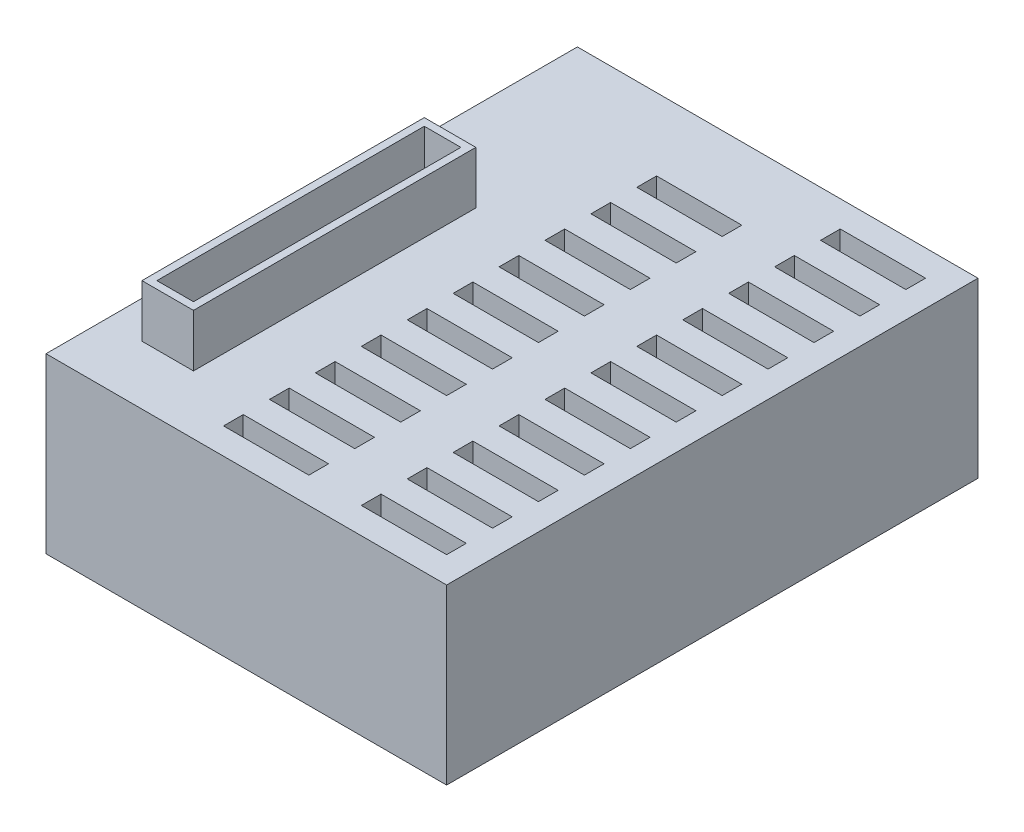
ISO-10303-21;
HEADER;
FILE_DESCRIPTION(('STEP AP214'),'2;1');
FILE_NAME('part.step','',(''),(''),'','','');
FILE_SCHEMA(('AUTOMOTIVE_DESIGN { 1 0 10303 214 1 1 1 1 }'));
ENDSEC;
DATA;
#1=APPLICATION_CONTEXT('core data for automotive mechanical design processes');
#2=APPLICATION_PROTOCOL_DEFINITION('international standard','automotive_design',2000,#1);
#3=PRODUCT_CONTEXT('',#1,'mechanical');
#4=PRODUCT('Part','Part','',(#3));
#5=PRODUCT_RELATED_PRODUCT_CATEGORY('part','',(#4));
#6=PRODUCT_DEFINITION_FORMATION('','',#4);
#7=PRODUCT_DEFINITION_CONTEXT('part definition',#1,'design');
#8=PRODUCT_DEFINITION('design','',#6,#7);
#9=PRODUCT_DEFINITION_SHAPE('','',#8);
#10=(LENGTH_UNIT() NAMED_UNIT(*) SI_UNIT(.MILLI.,.METRE.));
#11=(NAMED_UNIT(*) PLANE_ANGLE_UNIT() SI_UNIT($,.RADIAN.));
#12=(NAMED_UNIT(*) SI_UNIT($,.STERADIAN.) SOLID_ANGLE_UNIT());
#13=UNCERTAINTY_MEASURE_WITH_UNIT(LENGTH_MEASURE(1.E-05),#10,'distance_accuracy_value','');
#14=(GEOMETRIC_REPRESENTATION_CONTEXT(3) GLOBAL_UNCERTAINTY_ASSIGNED_CONTEXT((#13)) GLOBAL_UNIT_ASSIGNED_CONTEXT((#10,
#11,#12)) REPRESENTATION_CONTEXT('',''));
#15=CARTESIAN_POINT('',(0.,0.,0.));
#16=DIRECTION('',(0.,0.,1.));
#17=DIRECTION('',(1.,0.,0.));
#18=AXIS2_PLACEMENT_3D('',#15,#16,#17);
#19=CARTESIAN_POINT('',(-103.460168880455,-18.04,126.974383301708));
#20=DIRECTION('',(-1.,0.,0.));
#21=DIRECTION('',(0.,0.,1.));
#22=AXIS2_PLACEMENT_3D('',#19,#20,#21);
#23=PLANE('',#22);
#24=DIRECTION('',(0.,1.,0.));
#25=VECTOR('',#24,1.);
#26=CARTESIAN_POINT('',(-103.460168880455,-66.04,-65.5256166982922));
#27=LINE('',#26,#25);
#28=CARTESIAN_POINT('',(-103.460168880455,-66.04,-65.5256166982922));
#29=VERTEX_POINT('',#28);
#30=CARTESIAN_POINT('',(-103.460168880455,-18.04,-65.5256166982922));
#31=VERTEX_POINT('',#30);
#32=EDGE_CURVE('E746',#29,#31,#27,.T.);
#33=ORIENTED_EDGE('',*,*,#32,.T.);
#34=DIRECTION('',(0.,0.,-1.));
#35=VECTOR('',#34,1.);
#36=CARTESIAN_POINT('',(-103.460168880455,-18.04,126.974383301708));
#37=LINE('',#36,#35);
#38=CARTESIAN_POINT('',(-103.460168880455,-18.04,126.974383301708));
#39=VERTEX_POINT('',#38);
#40=EDGE_CURVE('E762',#39,#31,#37,.T.);
#41=ORIENTED_EDGE('',*,*,#40,.F.);
#42=DIRECTION('',(0.,-1.,0.));
#43=VECTOR('',#42,1.);
#44=CARTESIAN_POINT('',(-103.460168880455,-18.04,126.974383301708));
#45=LINE('',#44,#43);
#46=CARTESIAN_POINT('',(-103.460168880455,-66.04,126.974383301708));
#47=VERTEX_POINT('',#46);
#48=EDGE_CURVE('E778',#39,#47,#45,.T.);
#49=ORIENTED_EDGE('',*,*,#48,.T.);
#50=DIRECTION('',(0.,0.,-1.));
#51=VECTOR('',#50,1.);
#52=CARTESIAN_POINT('',(-103.460168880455,-66.04,126.974383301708));
#53=LINE('',#52,#51);
#54=EDGE_CURVE('E760',#47,#29,#53,.T.);
#55=ORIENTED_EDGE('',*,*,#54,.T.);
#56=EDGE_LOOP('',(#33,#41,#49,#55));
#57=FACE_BOUND('',#56,.T.);
#58=ADVANCED_FACE('F45',(#57),#23,.F.);
#59=CARTESIAN_POINT('',(39.2068311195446,-18.04,126.974383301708));
#60=DIRECTION('',(1.,0.,0.));
#61=DIRECTION('',(0.,0.,-1.));
#62=AXIS2_PLACEMENT_3D('',#59,#60,#61);
#63=PLANE('',#62);
#64=DIRECTION('',(0.,1.,0.));
#65=VECTOR('',#64,1.);
#66=CARTESIAN_POINT('',(39.2068311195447,-66.04,-65.5256166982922));
#67=LINE('',#66,#65);
#68=CARTESIAN_POINT('',(39.2068311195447,-66.04,-65.5256166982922));
#69=VERTEX_POINT('',#68);
#70=CARTESIAN_POINT('',(39.2068311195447,-18.04,-65.5256166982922));
#71=VERTEX_POINT('',#70);
#72=EDGE_CURVE('E750',#69,#71,#67,.T.);
#73=ORIENTED_EDGE('',*,*,#72,.F.);
#74=DIRECTION('',(0.,0.,1.));
#75=VECTOR('',#74,1.);
#76=CARTESIAN_POINT('',(39.2068311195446,-66.04,126.974383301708));
#77=LINE('',#76,#75);
#78=CARTESIAN_POINT('',(39.2068311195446,-66.04,126.974383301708));
#79=VERTEX_POINT('',#78);
#80=EDGE_CURVE('E774',#69,#79,#77,.T.);
#81=ORIENTED_EDGE('',*,*,#80,.T.);
#82=DIRECTION('',(0.,-1.,0.));
#83=VECTOR('',#82,1.);
#84=CARTESIAN_POINT('',(39.2068311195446,-18.04,126.974383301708));
#85=LINE('',#84,#83);
#86=CARTESIAN_POINT('',(39.2068311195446,-18.04,126.974383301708));
#87=VERTEX_POINT('',#86);
#88=EDGE_CURVE('E771',#87,#79,#85,.T.);
#89=ORIENTED_EDGE('',*,*,#88,.F.);
#90=DIRECTION('',(0.,0.,1.));
#91=VECTOR('',#90,1.);
#92=CARTESIAN_POINT('',(39.2068311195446,-18.04,126.974383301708));
#93=LINE('',#92,#91);
#94=EDGE_CURVE('E765',#71,#87,#93,.T.);
#95=ORIENTED_EDGE('',*,*,#94,.F.);
#96=EDGE_LOOP('',(#73,#81,#89,#95));
#97=FACE_BOUND('',#96,.T.);
#98=ADVANCED_FACE('F1503',(#97),#63,.F.);
#99=CARTESIAN_POINT('',(0.,-18.04,0.));
#100=DIRECTION('',(0.,-1.,0.));
#101=DIRECTION('',(0.,0.,-1.));
#102=AXIS2_PLACEMENT_3D('',#99,#100,#101);
#103=PLANE('',#102);
#104=ORIENTED_EDGE('',*,*,#40,.T.);
#105=DIRECTION('',(-1.,0.,0.));
#106=VECTOR('',#105,1.);
#107=CARTESIAN_POINT('',(-103.460168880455,-18.04,-65.5256166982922));
#108=LINE('',#107,#106);
#109=EDGE_CURVE('E735',#71,#31,#108,.T.);
#110=ORIENTED_EDGE('',*,*,#109,.F.);
#111=ORIENTED_EDGE('',*,*,#94,.T.);
#112=DIRECTION('',(-1.,0.,0.));
#113=VECTOR('',#112,1.);
#114=CARTESIAN_POINT('',(-103.460168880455,-18.04,126.974383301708));
#115=LINE('',#114,#113);
#116=EDGE_CURVE('E768',#87,#39,#115,.T.);
#117=ORIENTED_EDGE('',*,*,#116,.T.);
#118=EDGE_LOOP('',(#104,#110,#111,#117));
#119=FACE_BOUND('',#118,.T.);
#120=ADVANCED_FACE('F1501',(#119),#103,.T.);
#121=CARTESIAN_POINT('',(44.2068311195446,-66.04,-79.5256166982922));
#122=DIRECTION('',(1.,0.,0.));
#123=DIRECTION('',(0.,0.,-1.));
#124=AXIS2_PLACEMENT_3D('',#121,#122,#123);
#125=PLANE('',#124);
#126=DIRECTION('',(0.,1.,0.));
#127=VECTOR('',#126,1.);
#128=CARTESIAN_POINT('',(44.2068311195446,-66.04,-70.5256166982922));
#129=LINE('',#128,#127);
#130=CARTESIAN_POINT('',(44.2068311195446,-66.04,-70.5256166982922));
#131=VERTEX_POINT('',#130);
#132=CARTESIAN_POINT('',(44.2068311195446,0.,-70.5256166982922));
#133=VERTEX_POINT('',#132);
#134=EDGE_CURVE('E757',#131,#133,#129,.T.);
#135=ORIENTED_EDGE('',*,*,#134,.T.);
#136=DIRECTION('',(0.,0.,-1.));
#137=VECTOR('',#136,1.);
#138=CARTESIAN_POINT('',(44.2068311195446,0.,-79.5256166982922));
#139=LINE('',#138,#137);
#140=CARTESIAN_POINT('',(44.2068311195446,0.,131.974383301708));
#141=VERTEX_POINT('',#140);
#142=EDGE_CURVE('E1466',#141,#133,#139,.T.);
#143=ORIENTED_EDGE('',*,*,#142,.F.);
#144=DIRECTION('',(0.,1.,0.));
#145=VECTOR('',#144,1.);
#146=CARTESIAN_POINT('',(44.2068311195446,-66.04,131.974383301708));
#147=LINE('',#146,#145);
#148=CARTESIAN_POINT('',(44.2068311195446,-66.04,131.974383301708));
#149=VERTEX_POINT('',#148);
#150=EDGE_CURVE('E11',#149,#141,#147,.T.);
#151=ORIENTED_EDGE('',*,*,#150,.F.);
#152=DIRECTION('',(0.,0.,-1.));
#153=VECTOR('',#152,1.);
#154=CARTESIAN_POINT('',(44.2068311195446,-66.04,-79.5256166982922));
#155=LINE('',#154,#153);
#156=EDGE_CURVE('E53',#149,#131,#155,.T.);
#157=ORIENTED_EDGE('',*,*,#156,.T.);
#158=EDGE_LOOP('',(#135,#143,#151,#157));
#159=FACE_BOUND('',#158,.T.);
#160=ADVANCED_FACE('F1478',(#159),#125,.T.);
#161=CARTESIAN_POINT('',(-105.793168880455,-66.04,131.974383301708));
#162=DIRECTION('',(0.,0.,1.));
#163=DIRECTION('',(1.,0.,0.));
#164=AXIS2_PLACEMENT_3D('',#161,#162,#163);
#165=PLANE('',#164);
#166=DIRECTION('',(1.,0.,0.));
#167=VECTOR('',#166,1.);
#168=CARTESIAN_POINT('',(-105.793168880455,0.,131.974383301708));
#169=LINE('',#168,#167);
#170=CARTESIAN_POINT('',(-108.460168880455,0.,131.974383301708));
#171=VERTEX_POINT('',#170);
#172=EDGE_CURVE('E1456',#171,#141,#169,.T.);
#173=ORIENTED_EDGE('',*,*,#172,.F.);
#174=DIRECTION('',(0.,1.,0.));
#175=VECTOR('',#174,1.);
#176=CARTESIAN_POINT('',(-108.460168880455,-66.04,131.974383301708));
#177=LINE('',#176,#175);
#178=CARTESIAN_POINT('',(-108.460168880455,-66.04,131.974383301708));
#179=VERTEX_POINT('',#178);
#180=EDGE_CURVE('E784',#179,#171,#177,.T.);
#181=ORIENTED_EDGE('',*,*,#180,.F.);
#182=DIRECTION('',(1.,0.,0.));
#183=VECTOR('',#182,1.);
#184=CARTESIAN_POINT('',(-105.793168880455,-66.04,131.974383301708));
#185=LINE('',#184,#183);
#186=EDGE_CURVE('E1463',#179,#149,#185,.T.);
#187=ORIENTED_EDGE('',*,*,#186,.T.);
#188=ORIENTED_EDGE('',*,*,#150,.T.);
#189=EDGE_LOOP('',(#173,#181,#187,#188));
#190=FACE_BOUND('',#189,.T.);
#191=ADVANCED_FACE('F47',(#190),#165,.T.);
#192=CARTESIAN_POINT('',(0.,-66.04,0.));
#193=DIRECTION('',(0.,1.,0.));
#194=DIRECTION('',(0.,0.,1.));
#195=AXIS2_PLACEMENT_3D('',#192,#193,#194);
#196=PLANE('',#195);
#197=DIRECTION('',(1.,0.,0.));
#198=VECTOR('',#197,1.);
#199=CARTESIAN_POINT('',(-108.460168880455,-66.04,-70.5256166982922));
#200=LINE('',#199,#198);
#201=CARTESIAN_POINT('',(-108.460168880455,-66.04,-70.5256166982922));
#202=VERTEX_POINT('',#201);
#203=EDGE_CURVE('E753',#202,#131,#200,.T.);
#204=ORIENTED_EDGE('',*,*,#203,.T.);
#205=ORIENTED_EDGE('',*,*,#156,.F.);
#206=ORIENTED_EDGE('',*,*,#186,.F.);
#207=DIRECTION('',(0.,0.,1.));
#208=VECTOR('',#207,1.);
#209=CARTESIAN_POINT('',(-108.460168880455,-66.04,-79.5256166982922));
#210=LINE('',#209,#208);
#211=EDGE_CURVE('E780',#202,#179,#210,.T.);
#212=ORIENTED_EDGE('',*,*,#211,.F.);
#213=EDGE_LOOP('',(#204,#205,#206,#212));
#214=FACE_BOUND('',#213,.T.);
#215=DIRECTION('',(-1.,0.,0.));
#216=VECTOR('',#215,1.);
#217=CARTESIAN_POINT('',(-103.460168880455,-66.04,-65.5256166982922));
#218=LINE('',#217,#216);
#219=EDGE_CURVE('E744',#69,#29,#218,.T.);
#220=ORIENTED_EDGE('',*,*,#219,.T.);
#221=ORIENTED_EDGE('',*,*,#54,.F.);
#222=DIRECTION('',(-1.,0.,0.));
#223=VECTOR('',#222,1.);
#224=CARTESIAN_POINT('',(-103.460168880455,-66.04,126.974383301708));
#225=LINE('',#224,#223);
#226=EDGE_CURVE('E766',#79,#47,#225,.T.);
#227=ORIENTED_EDGE('',*,*,#226,.F.);
#228=ORIENTED_EDGE('',*,*,#80,.F.);
#229=EDGE_LOOP('',(#220,#221,#227,#228));
#230=FACE_BOUND('',#229,.T.);
#231=ADVANCED_FACE('F1489',(#214,#230),#196,.F.);
#232=CARTESIAN_POINT('',(0.,0.,0.));
#233=DIRECTION('',(0.,1.,0.));
#234=DIRECTION('',(0.,0.,1.));
#235=AXIS2_PLACEMENT_3D('',#232,#233,#234);
#236=PLANE('',#235);
#237=DIRECTION('',(0.,0.,1.));
#238=VECTOR('',#237,1.);
#239=CARTESIAN_POINT('',(-74.6593938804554,0.,0.));
#240=LINE('',#239,#238);
#241=CARTESIAN_POINT('',(-74.6593938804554,0.,1.97438330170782));
#242=VERTEX_POINT('',#241);
#243=CARTESIAN_POINT('',(-74.6593938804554,0.,109.574383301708));
#244=VERTEX_POINT('',#243);
#245=EDGE_CURVE('E668',#242,#244,#240,.T.);
#246=ORIENTED_EDGE('',*,*,#245,.T.);
#247=DIRECTION('',(1.,0.,0.));
#248=VECTOR('',#247,1.);
#249=CARTESIAN_POINT('',(0.,0.,109.574383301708));
#250=LINE('',#249,#248);
#251=CARTESIAN_POINT('',(-94.2993938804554,0.,109.574383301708));
#252=VERTEX_POINT('',#251);
#253=EDGE_CURVE('E709',#252,#244,#250,.T.);
#254=ORIENTED_EDGE('',*,*,#253,.F.);
#255=DIRECTION('',(0.,0.,1.));
#256=VECTOR('',#255,1.);
#257=CARTESIAN_POINT('',(-94.2993938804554,0.,0.));
#258=LINE('',#257,#256);
#259=CARTESIAN_POINT('',(-94.2993938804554,0.,1.97438330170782));
#260=VERTEX_POINT('',#259);
#261=EDGE_CURVE('E707',#260,#252,#258,.T.);
#262=ORIENTED_EDGE('',*,*,#261,.F.);
#263=DIRECTION('',(1.,0.,0.));
#264=VECTOR('',#263,1.);
#265=CARTESIAN_POINT('',(0.,0.,1.97438330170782));
#266=LINE('',#265,#264);
#267=EDGE_CURVE('E705',#260,#242,#266,.T.);
#268=ORIENTED_EDGE('',*,*,#267,.T.);
#269=EDGE_LOOP('',(#246,#254,#262,#268));
#270=FACE_BOUND('',#269,.T.);
#271=DIRECTION('',(1.,0.,0.));
#272=VECTOR('',#271,1.);
#273=CARTESIAN_POINT('',(-108.460168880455,0.,-70.5256166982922));
#274=LINE('',#273,#272);
#275=CARTESIAN_POINT('',(-108.460168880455,0.,-70.5256166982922));
#276=VERTEX_POINT('',#275);
#277=EDGE_CURVE('E752',#276,#133,#274,.T.);
#278=ORIENTED_EDGE('',*,*,#277,.F.);
#279=DIRECTION('',(0.,0.,-1.));
#280=VECTOR('',#279,1.);
#281=CARTESIAN_POINT('',(-108.460168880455,0.,-79.5256166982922));
#282=LINE('',#281,#280);
#283=EDGE_CURVE('E787',#171,#276,#282,.T.);
#284=ORIENTED_EDGE('',*,*,#283,.F.);
#285=ORIENTED_EDGE('',*,*,#172,.T.);
#286=ORIENTED_EDGE('',*,*,#142,.T.);
#287=EDGE_LOOP('',(#278,#284,#285,#286));
#288=FACE_BOUND('',#287,.T.);
#289=DIRECTION('',(-1.,0.,0.));
#290=VECTOR('',#289,1.);
#291=CARTESIAN_POINT('',(-50.7931688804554,0.,96.9743833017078));
#292=LINE('',#291,#290);
#293=CARTESIAN_POINT('',(-18.2931688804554,0.,96.9743833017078));
#294=VERTEX_POINT('',#293);
#295=CARTESIAN_POINT('',(-50.7931688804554,0.,96.9743833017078));
#296=VERTEX_POINT('',#295);
#297=EDGE_CURVE('E1057',#294,#296,#292,.T.);
#298=ORIENTED_EDGE('',*,*,#297,.F.);
#299=DIRECTION('',(0.,0.,-1.));
#300=VECTOR('',#299,1.);
#301=CARTESIAN_POINT('',(-18.2931688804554,0.,96.9743833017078));
#302=LINE('',#301,#300);
#303=CARTESIAN_POINT('',(-18.2931688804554,0.,104.474383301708));
#304=VERTEX_POINT('',#303);
#305=EDGE_CURVE('E1090',#304,#294,#302,.T.);
#306=ORIENTED_EDGE('',*,*,#305,.F.);
#307=DIRECTION('',(1.,0.,0.));
#308=VECTOR('',#307,1.);
#309=CARTESIAN_POINT('',(-50.7931688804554,0.,104.474383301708));
#310=LINE('',#309,#308);
#311=CARTESIAN_POINT('',(-50.7931688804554,0.,104.474383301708));
#312=VERTEX_POINT('',#311);
#313=EDGE_CURVE('E1093',#312,#304,#310,.T.);
#314=ORIENTED_EDGE('',*,*,#313,.F.);
#315=DIRECTION('',(0.,0.,1.));
#316=VECTOR('',#315,1.);
#317=CARTESIAN_POINT('',(-50.7931688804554,0.,96.9743833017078));
#318=LINE('',#317,#316);
#319=EDGE_CURVE('E1097',#296,#312,#318,.T.);
#320=ORIENTED_EDGE('',*,*,#319,.F.);
#321=EDGE_LOOP('',(#298,#306,#314,#320));
#322=FACE_BOUND('',#321,.T.);
#323=DIRECTION('',(-1.,0.,0.));
#324=VECTOR('',#323,1.);
#325=CARTESIAN_POINT('',(1.7068311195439,0.,-60.5256166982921));
#326=LINE('',#325,#324);
#327=CARTESIAN_POINT('',(34.2068311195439,0.,-60.5256166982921));
#328=VERTEX_POINT('',#327);
#329=CARTESIAN_POINT('',(1.7068311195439,0.,-60.5256166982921));
#330=VERTEX_POINT('',#329);
#331=EDGE_CURVE('E1068',#328,#330,#326,.T.);
#332=ORIENTED_EDGE('',*,*,#331,.F.);
#333=DIRECTION('',(0.,0.,-1.));
#334=VECTOR('',#333,1.);
#335=CARTESIAN_POINT('',(34.2068311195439,0.,-60.5256166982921));
#336=LINE('',#335,#334);
#337=CARTESIAN_POINT('',(34.2068311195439,0.,-53.0256166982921));
#338=VERTEX_POINT('',#337);
#339=EDGE_CURVE('E1058',#338,#328,#336,.T.);
#340=ORIENTED_EDGE('',*,*,#339,.F.);
#341=DIRECTION('',(1.,0.,0.));
#342=VECTOR('',#341,1.);
#343=CARTESIAN_POINT('',(1.7068311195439,0.,-53.0256166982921));
#344=LINE('',#343,#342);
#345=CARTESIAN_POINT('',(1.7068311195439,0.,-53.0256166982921));
#346=VERTEX_POINT('',#345);
#347=EDGE_CURVE('E1061',#346,#338,#344,.T.);
#348=ORIENTED_EDGE('',*,*,#347,.F.);
#349=DIRECTION('',(0.,0.,1.));
#350=VECTOR('',#349,1.);
#351=CARTESIAN_POINT('',(1.7068311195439,0.,-60.5256166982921));
#352=LINE('',#351,#350);
#353=EDGE_CURVE('E1065',#330,#346,#352,.T.);
#354=ORIENTED_EDGE('',*,*,#353,.F.);
#355=EDGE_LOOP('',(#332,#340,#348,#354));
#356=FACE_BOUND('',#355,.T.);
#357=DIRECTION('',(-1.,0.,0.));
#358=VECTOR('',#357,1.);
#359=CARTESIAN_POINT('',(1.70683111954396,0.,-43.0256166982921));
#360=LINE('',#359,#358);
#361=CARTESIAN_POINT('',(34.206831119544,0.,-43.0256166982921));
#362=VERTEX_POINT('',#361);
#363=CARTESIAN_POINT('',(1.70683111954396,0.,-43.0256166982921));
#364=VERTEX_POINT('',#363);
#365=EDGE_CURVE('E1121',#362,#364,#360,.T.);
#366=ORIENTED_EDGE('',*,*,#365,.F.);
#367=DIRECTION('',(0.,0.,-1.));
#368=VECTOR('',#367,1.);
#369=CARTESIAN_POINT('',(34.206831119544,0.,-43.0256166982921));
#370=LINE('',#369,#368);
#371=CARTESIAN_POINT('',(34.206831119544,0.,-35.5256166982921));
#372=VERTEX_POINT('',#371);
#373=EDGE_CURVE('E1154',#372,#362,#370,.T.);
#374=ORIENTED_EDGE('',*,*,#373,.F.);
#375=DIRECTION('',(1.,0.,0.));
#376=VECTOR('',#375,1.);
#377=CARTESIAN_POINT('',(1.70683111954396,0.,-35.5256166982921));
#378=LINE('',#377,#376);
#379=CARTESIAN_POINT('',(1.70683111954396,0.,-35.5256166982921));
#380=VERTEX_POINT('',#379);
#381=EDGE_CURVE('E1157',#380,#372,#378,.T.);
#382=ORIENTED_EDGE('',*,*,#381,.F.);
#383=DIRECTION('',(0.,0.,1.));
#384=VECTOR('',#383,1.);
#385=CARTESIAN_POINT('',(1.70683111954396,0.,-43.0256166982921));
#386=LINE('',#385,#384);
#387=EDGE_CURVE('E1161',#364,#380,#386,.T.);
#388=ORIENTED_EDGE('',*,*,#387,.F.);
#389=EDGE_LOOP('',(#366,#374,#382,#388));
#390=FACE_BOUND('',#389,.T.);
#391=DIRECTION('',(-1.,0.,0.));
#392=VECTOR('',#391,1.);
#393=CARTESIAN_POINT('',(1.70683111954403,0.,-25.5256166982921));
#394=LINE('',#393,#392);
#395=CARTESIAN_POINT('',(34.206831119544,0.,-25.5256166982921));
#396=VERTEX_POINT('',#395);
#397=CARTESIAN_POINT('',(1.70683111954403,0.,-25.5256166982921));
#398=VERTEX_POINT('',#397);
#399=EDGE_CURVE('E1132',#396,#398,#394,.T.);
#400=ORIENTED_EDGE('',*,*,#399,.F.);
#401=DIRECTION('',(0.,0.,-1.));
#402=VECTOR('',#401,1.);
#403=CARTESIAN_POINT('',(34.206831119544,0.,-25.5256166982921));
#404=LINE('',#403,#402);
#405=CARTESIAN_POINT('',(34.206831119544,0.,-18.0256166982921));
#406=VERTEX_POINT('',#405);
#407=EDGE_CURVE('E1122',#406,#396,#404,.T.);
#408=ORIENTED_EDGE('',*,*,#407,.F.);
#409=DIRECTION('',(1.,0.,0.));
#410=VECTOR('',#409,1.);
#411=CARTESIAN_POINT('',(1.70683111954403,0.,-18.0256166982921));
#412=LINE('',#411,#410);
#413=CARTESIAN_POINT('',(1.70683111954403,0.,-18.0256166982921));
#414=VERTEX_POINT('',#413);
#415=EDGE_CURVE('E1125',#414,#406,#412,.T.);
#416=ORIENTED_EDGE('',*,*,#415,.F.);
#417=DIRECTION('',(0.,0.,1.));
#418=VECTOR('',#417,1.);
#419=CARTESIAN_POINT('',(1.70683111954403,0.,-25.5256166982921));
#420=LINE('',#419,#418);
#421=EDGE_CURVE('E1129',#398,#414,#420,.T.);
#422=ORIENTED_EDGE('',*,*,#421,.F.);
#423=EDGE_LOOP('',(#400,#408,#416,#422));
#424=FACE_BOUND('',#423,.T.);
#425=DIRECTION('',(-1.,0.,0.));
#426=VECTOR('',#425,1.);
#427=CARTESIAN_POINT('',(-50.7931688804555,0.,79.4743833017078));
#428=LINE('',#427,#426);
#429=CARTESIAN_POINT('',(-18.2931688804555,0.,79.4743833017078));
#430=VERTEX_POINT('',#429);
#431=CARTESIAN_POINT('',(-50.7931688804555,0.,79.4743833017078));
#432=VERTEX_POINT('',#431);
#433=EDGE_CURVE('E940',#430,#432,#428,.T.);
#434=ORIENTED_EDGE('',*,*,#433,.F.);
#435=DIRECTION('',(0.,0.,-1.));
#436=VECTOR('',#435,1.);
#437=CARTESIAN_POINT('',(-18.2931688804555,0.,79.4743833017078));
#438=LINE('',#437,#436);
#439=CARTESIAN_POINT('',(-18.2931688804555,0.,86.9743833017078));
#440=VERTEX_POINT('',#439);
#441=EDGE_CURVE('E930',#440,#430,#438,.T.);
#442=ORIENTED_EDGE('',*,*,#441,.F.);
#443=DIRECTION('',(1.,0.,0.));
#444=VECTOR('',#443,1.);
#445=CARTESIAN_POINT('',(-50.7931688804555,0.,86.9743833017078));
#446=LINE('',#445,#444);
#447=CARTESIAN_POINT('',(-50.7931688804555,0.,86.9743833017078));
#448=VERTEX_POINT('',#447);
#449=EDGE_CURVE('E933',#448,#440,#446,.T.);
#450=ORIENTED_EDGE('',*,*,#449,.F.);
#451=DIRECTION('',(0.,0.,1.));
#452=VECTOR('',#451,1.);
#453=CARTESIAN_POINT('',(-50.7931688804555,0.,79.4743833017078));
#454=LINE('',#453,#452);
#455=EDGE_CURVE('E937',#432,#448,#454,.T.);
#456=ORIENTED_EDGE('',*,*,#455,.F.);
#457=EDGE_LOOP('',(#434,#442,#450,#456));
#458=FACE_BOUND('',#457,.T.);
#459=DIRECTION('',(-1.,0.,0.));
#460=VECTOR('',#459,1.);
#461=CARTESIAN_POINT('',(-50.7931688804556,0.,61.9743833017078));
#462=LINE('',#461,#460);
#463=CARTESIAN_POINT('',(-18.2931688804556,0.,61.9743833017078));
#464=VERTEX_POINT('',#463);
#465=CARTESIAN_POINT('',(-50.7931688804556,0.,61.9743833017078));
#466=VERTEX_POINT('',#465);
#467=EDGE_CURVE('E929',#464,#466,#462,.T.);
#468=ORIENTED_EDGE('',*,*,#467,.F.);
#469=DIRECTION('',(0.,0.,-1.));
#470=VECTOR('',#469,1.);
#471=CARTESIAN_POINT('',(-18.2931688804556,0.,61.9743833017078));
#472=LINE('',#471,#470);
#473=CARTESIAN_POINT('',(-18.2931688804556,0.,69.4743833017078));
#474=VERTEX_POINT('',#473);
#475=EDGE_CURVE('E964',#474,#464,#472,.T.);
#476=ORIENTED_EDGE('',*,*,#475,.F.);
#477=DIRECTION('',(1.,0.,0.));
#478=VECTOR('',#477,1.);
#479=CARTESIAN_POINT('',(-50.7931688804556,0.,69.4743833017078));
#480=LINE('',#479,#478);
#481=CARTESIAN_POINT('',(-50.7931688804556,0.,69.4743833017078));
#482=VERTEX_POINT('',#481);
#483=EDGE_CURVE('E967',#482,#474,#480,.T.);
#484=ORIENTED_EDGE('',*,*,#483,.F.);
#485=DIRECTION('',(0.,0.,1.));
#486=VECTOR('',#485,1.);
#487=CARTESIAN_POINT('',(-50.7931688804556,0.,61.9743833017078));
#488=LINE('',#487,#486);
#489=EDGE_CURVE('E971',#466,#482,#488,.T.);
#490=ORIENTED_EDGE('',*,*,#489,.F.);
#491=EDGE_LOOP('',(#468,#476,#484,#490));
#492=FACE_BOUND('',#491,.T.);
#493=DIRECTION('',(-1.,0.,0.));
#494=VECTOR('',#493,1.);
#495=CARTESIAN_POINT('',(-50.7931688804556,0.,44.4743833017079));
#496=LINE('',#495,#494);
#497=CARTESIAN_POINT('',(-18.2931688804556,0.,44.4743833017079));
#498=VERTEX_POINT('',#497);
#499=CARTESIAN_POINT('',(-50.7931688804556,0.,44.4743833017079));
#500=VERTEX_POINT('',#499);
#501=EDGE_CURVE('E963',#498,#500,#496,.T.);
#502=ORIENTED_EDGE('',*,*,#501,.F.);
#503=DIRECTION('',(0.,0.,-1.));
#504=VECTOR('',#503,1.);
#505=CARTESIAN_POINT('',(-18.2931688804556,0.,44.4743833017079));
#506=LINE('',#505,#504);
#507=CARTESIAN_POINT('',(-18.2931688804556,0.,51.9743833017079));
#508=VERTEX_POINT('',#507);
#509=EDGE_CURVE('E996',#508,#498,#506,.T.);
#510=ORIENTED_EDGE('',*,*,#509,.F.);
#511=DIRECTION('',(1.,0.,0.));
#512=VECTOR('',#511,1.);
#513=CARTESIAN_POINT('',(-50.7931688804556,0.,51.9743833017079));
#514=LINE('',#513,#512);
#515=CARTESIAN_POINT('',(-50.7931688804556,0.,51.9743833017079));
#516=VERTEX_POINT('',#515);
#517=EDGE_CURVE('E999',#516,#508,#514,.T.);
#518=ORIENTED_EDGE('',*,*,#517,.F.);
#519=DIRECTION('',(0.,0.,1.));
#520=VECTOR('',#519,1.);
#521=CARTESIAN_POINT('',(-50.7931688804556,0.,44.4743833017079));
#522=LINE('',#521,#520);
#523=EDGE_CURVE('E1003',#500,#516,#522,.T.);
#524=ORIENTED_EDGE('',*,*,#523,.F.);
#525=EDGE_LOOP('',(#502,#510,#518,#524));
#526=FACE_BOUND('',#525,.T.);
#527=DIRECTION('',(-1.,0.,0.));
#528=VECTOR('',#527,1.);
#529=CARTESIAN_POINT('',(-50.7931688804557,0.,26.9743833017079));
#530=LINE('',#529,#528);
#531=CARTESIAN_POINT('',(-18.2931688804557,0.,26.9743833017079));
#532=VERTEX_POINT('',#531);
#533=CARTESIAN_POINT('',(-50.7931688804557,0.,26.9743833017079));
#534=VERTEX_POINT('',#533);
#535=EDGE_CURVE('E995',#532,#534,#530,.T.);
#536=ORIENTED_EDGE('',*,*,#535,.F.);
#537=DIRECTION('',(0.,0.,-1.));
#538=VECTOR('',#537,1.);
#539=CARTESIAN_POINT('',(-18.2931688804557,0.,26.9743833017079));
#540=LINE('',#539,#538);
#541=CARTESIAN_POINT('',(-18.2931688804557,0.,34.4743833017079));
#542=VERTEX_POINT('',#541);
#543=EDGE_CURVE('E1026',#542,#532,#540,.T.);
#544=ORIENTED_EDGE('',*,*,#543,.F.);
#545=DIRECTION('',(1.,0.,0.));
#546=VECTOR('',#545,1.);
#547=CARTESIAN_POINT('',(-50.7931688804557,0.,34.4743833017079));
#548=LINE('',#547,#546);
#549=CARTESIAN_POINT('',(-50.7931688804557,0.,34.4743833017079));
#550=VERTEX_POINT('',#549);
#551=EDGE_CURVE('E1029',#550,#542,#548,.T.);
#552=ORIENTED_EDGE('',*,*,#551,.F.);
#553=DIRECTION('',(0.,0.,1.));
#554=VECTOR('',#553,1.);
#555=CARTESIAN_POINT('',(-50.7931688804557,0.,26.9743833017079));
#556=LINE('',#555,#554);
#557=EDGE_CURVE('E1033',#534,#550,#556,.T.);
#558=ORIENTED_EDGE('',*,*,#557,.F.);
#559=EDGE_LOOP('',(#536,#544,#552,#558));
#560=FACE_BOUND('',#559,.T.);
#561=DIRECTION('',(-1.,0.,0.));
#562=VECTOR('',#561,1.);
#563=CARTESIAN_POINT('',(1.70683111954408,0.,-8.0256166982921));
#564=LINE('',#563,#562);
#565=CARTESIAN_POINT('',(34.2068311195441,0.,-8.0256166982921));
#566=VERTEX_POINT('',#565);
#567=CARTESIAN_POINT('',(1.70683111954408,0.,-8.0256166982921));
#568=VERTEX_POINT('',#567);
#569=EDGE_CURVE('E1379',#566,#568,#564,.T.);
#570=ORIENTED_EDGE('',*,*,#569,.F.);
#571=DIRECTION('',(0.,0.,-1.));
#572=VECTOR('',#571,1.);
#573=CARTESIAN_POINT('',(34.2068311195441,0.,-8.0256166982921));
#574=LINE('',#573,#572);
#575=CARTESIAN_POINT('',(34.2068311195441,0.,-0.525616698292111));
#576=VERTEX_POINT('',#575);
#577=EDGE_CURVE('E1410',#576,#566,#574,.T.);
#578=ORIENTED_EDGE('',*,*,#577,.F.);
#579=DIRECTION('',(1.,0.,0.));
#580=VECTOR('',#579,1.);
#581=CARTESIAN_POINT('',(1.70683111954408,0.,-0.525616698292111));
#582=LINE('',#581,#580);
#583=CARTESIAN_POINT('',(1.70683111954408,0.,-0.525616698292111));
#584=VERTEX_POINT('',#583);
#585=EDGE_CURVE('E1413',#584,#576,#582,.T.);
#586=ORIENTED_EDGE('',*,*,#585,.F.);
#587=DIRECTION('',(0.,0.,1.));
#588=VECTOR('',#587,1.);
#589=CARTESIAN_POINT('',(1.70683111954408,0.,-8.0256166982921));
#590=LINE('',#589,#588);
#591=EDGE_CURVE('E1417',#568,#584,#590,.T.);
#592=ORIENTED_EDGE('',*,*,#591,.F.);
#593=EDGE_LOOP('',(#570,#578,#586,#592));
#594=FACE_BOUND('',#593,.T.);
#595=DIRECTION('',(-1.,0.,0.));
#596=VECTOR('',#595,1.);
#597=CARTESIAN_POINT('',(1.70683111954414,0.,9.47438330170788));
#598=LINE('',#597,#596);
#599=CARTESIAN_POINT('',(34.2068311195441,0.,9.47438330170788));
#600=VERTEX_POINT('',#599);
#601=CARTESIAN_POINT('',(1.70683111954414,0.,9.47438330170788));
#602=VERTEX_POINT('',#601);
#603=EDGE_CURVE('E1347',#600,#602,#598,.T.);
#604=ORIENTED_EDGE('',*,*,#603,.F.);
#605=DIRECTION('',(0.,0.,-1.));
#606=VECTOR('',#605,1.);
#607=CARTESIAN_POINT('',(34.2068311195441,0.,9.47438330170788));
#608=LINE('',#607,#606);
#609=CARTESIAN_POINT('',(34.2068311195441,0.,16.9743833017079));
#610=VERTEX_POINT('',#609);
#611=EDGE_CURVE('E1380',#610,#600,#608,.T.);
#612=ORIENTED_EDGE('',*,*,#611,.F.);
#613=DIRECTION('',(1.,0.,0.));
#614=VECTOR('',#613,1.);
#615=CARTESIAN_POINT('',(1.70683111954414,0.,16.9743833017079));
#616=LINE('',#615,#614);
#617=CARTESIAN_POINT('',(1.70683111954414,0.,16.9743833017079));
#618=VERTEX_POINT('',#617);
#619=EDGE_CURVE('E1383',#618,#610,#616,.T.);
#620=ORIENTED_EDGE('',*,*,#619,.F.);
#621=DIRECTION('',(0.,0.,1.));
#622=VECTOR('',#621,1.);
#623=CARTESIAN_POINT('',(1.70683111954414,0.,9.47438330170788));
#624=LINE('',#623,#622);
#625=EDGE_CURVE('E1387',#602,#618,#624,.T.);
#626=ORIENTED_EDGE('',*,*,#625,.F.);
#627=EDGE_LOOP('',(#604,#612,#620,#626));
#628=FACE_BOUND('',#627,.T.);
#629=DIRECTION('',(-1.,0.,0.));
#630=VECTOR('',#629,1.);
#631=CARTESIAN_POINT('',(1.70683111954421,0.,26.9743833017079));
#632=LINE('',#631,#630);
#633=CARTESIAN_POINT('',(34.2068311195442,0.,26.9743833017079));
#634=VERTEX_POINT('',#633);
#635=CARTESIAN_POINT('',(1.70683111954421,0.,26.9743833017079));
#636=VERTEX_POINT('',#635);
#637=EDGE_CURVE('E1315',#634,#636,#632,.T.);
#638=ORIENTED_EDGE('',*,*,#637,.F.);
#639=DIRECTION('',(0.,0.,-1.));
#640=VECTOR('',#639,1.);
#641=CARTESIAN_POINT('',(34.2068311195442,0.,26.9743833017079));
#642=LINE('',#641,#640);
#643=CARTESIAN_POINT('',(34.2068311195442,0.,34.4743833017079));
#644=VERTEX_POINT('',#643);
#645=EDGE_CURVE('E1348',#644,#634,#642,.T.);
#646=ORIENTED_EDGE('',*,*,#645,.F.);
#647=DIRECTION('',(1.,0.,0.));
#648=VECTOR('',#647,1.);
#649=CARTESIAN_POINT('',(1.70683111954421,0.,34.4743833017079));
#650=LINE('',#649,#648);
#651=CARTESIAN_POINT('',(1.70683111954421,0.,34.4743833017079));
#652=VERTEX_POINT('',#651);
#653=EDGE_CURVE('E1351',#652,#644,#650,.T.);
#654=ORIENTED_EDGE('',*,*,#653,.F.);
#655=DIRECTION('',(0.,0.,1.));
#656=VECTOR('',#655,1.);
#657=CARTESIAN_POINT('',(1.70683111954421,0.,26.9743833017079));
#658=LINE('',#657,#656);
#659=EDGE_CURVE('E1355',#636,#652,#658,.T.);
#660=ORIENTED_EDGE('',*,*,#659,.F.);
#661=EDGE_LOOP('',(#638,#646,#654,#660));
#662=FACE_BOUND('',#661,.T.);
#663=DIRECTION('',(-1.,0.,0.));
#664=VECTOR('',#663,1.);
#665=CARTESIAN_POINT('',(1.70683111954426,0.,44.4743833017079));
#666=LINE('',#665,#664);
#667=CARTESIAN_POINT('',(34.2068311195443,0.,44.4743833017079));
#668=VERTEX_POINT('',#667);
#669=CARTESIAN_POINT('',(1.70683111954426,0.,44.4743833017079));
#670=VERTEX_POINT('',#669);
#671=EDGE_CURVE('E1283',#668,#670,#666,.T.);
#672=ORIENTED_EDGE('',*,*,#671,.F.);
#673=DIRECTION('',(0.,0.,-1.));
#674=VECTOR('',#673,1.);
#675=CARTESIAN_POINT('',(34.2068311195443,0.,44.4743833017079));
#676=LINE('',#675,#674);
#677=CARTESIAN_POINT('',(34.2068311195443,0.,51.9743833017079));
#678=VERTEX_POINT('',#677);
#679=EDGE_CURVE('E1316',#678,#668,#676,.T.);
#680=ORIENTED_EDGE('',*,*,#679,.F.);
#681=DIRECTION('',(1.,0.,0.));
#682=VECTOR('',#681,1.);
#683=CARTESIAN_POINT('',(1.70683111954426,0.,51.9743833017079));
#684=LINE('',#683,#682);
#685=CARTESIAN_POINT('',(1.70683111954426,0.,51.9743833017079));
#686=VERTEX_POINT('',#685);
#687=EDGE_CURVE('E1319',#686,#678,#684,.T.);
#688=ORIENTED_EDGE('',*,*,#687,.F.);
#689=DIRECTION('',(0.,0.,1.));
#690=VECTOR('',#689,1.);
#691=CARTESIAN_POINT('',(1.70683111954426,0.,44.4743833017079));
#692=LINE('',#691,#690);
#693=EDGE_CURVE('E1323',#670,#686,#692,.T.);
#694=ORIENTED_EDGE('',*,*,#693,.F.);
#695=EDGE_LOOP('',(#672,#680,#688,#694));
#696=FACE_BOUND('',#695,.T.);
#697=DIRECTION('',(-1.,0.,0.));
#698=VECTOR('',#697,1.);
#699=CARTESIAN_POINT('',(1.70683111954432,0.,61.9743833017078));
#700=LINE('',#699,#698);
#701=CARTESIAN_POINT('',(34.2068311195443,0.,61.9743833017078));
#702=VERTEX_POINT('',#701);
#703=CARTESIAN_POINT('',(1.70683111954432,0.,61.9743833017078));
#704=VERTEX_POINT('',#703);
#705=EDGE_CURVE('E1251',#702,#704,#700,.T.);
#706=ORIENTED_EDGE('',*,*,#705,.F.);
#707=DIRECTION('',(0.,0.,-1.));
#708=VECTOR('',#707,1.);
#709=CARTESIAN_POINT('',(34.2068311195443,0.,61.9743833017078));
#710=LINE('',#709,#708);
#711=CARTESIAN_POINT('',(34.2068311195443,0.,69.4743833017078));
#712=VERTEX_POINT('',#711);
#713=EDGE_CURVE('E1284',#712,#702,#710,.T.);
#714=ORIENTED_EDGE('',*,*,#713,.F.);
#715=DIRECTION('',(1.,0.,0.));
#716=VECTOR('',#715,1.);
#717=CARTESIAN_POINT('',(1.70683111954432,0.,69.4743833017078));
#718=LINE('',#717,#716);
#719=CARTESIAN_POINT('',(1.70683111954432,0.,69.4743833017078));
#720=VERTEX_POINT('',#719);
#721=EDGE_CURVE('E1287',#720,#712,#718,.T.);
#722=ORIENTED_EDGE('',*,*,#721,.F.);
#723=DIRECTION('',(0.,0.,1.));
#724=VECTOR('',#723,1.);
#725=CARTESIAN_POINT('',(1.70683111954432,0.,61.9743833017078));
#726=LINE('',#725,#724);
#727=EDGE_CURVE('E1291',#704,#720,#726,.T.);
#728=ORIENTED_EDGE('',*,*,#727,.F.);
#729=EDGE_LOOP('',(#706,#714,#722,#728));
#730=FACE_BOUND('',#729,.T.);
#731=DIRECTION('',(-1.,0.,0.));
#732=VECTOR('',#731,1.);
#733=CARTESIAN_POINT('',(1.70683111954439,0.,79.4743833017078));
#734=LINE('',#733,#732);
#735=CARTESIAN_POINT('',(34.2068311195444,0.,79.4743833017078));
#736=VERTEX_POINT('',#735);
#737=CARTESIAN_POINT('',(1.70683111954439,0.,79.4743833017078));
#738=VERTEX_POINT('',#737);
#739=EDGE_CURVE('E1219',#736,#738,#734,.T.);
#740=ORIENTED_EDGE('',*,*,#739,.F.);
#741=DIRECTION('',(0.,0.,-1.));
#742=VECTOR('',#741,1.);
#743=CARTESIAN_POINT('',(34.2068311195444,0.,79.4743833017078));
#744=LINE('',#743,#742);
#745=CARTESIAN_POINT('',(34.2068311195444,0.,86.9743833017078));
#746=VERTEX_POINT('',#745);
#747=EDGE_CURVE('E1252',#746,#736,#744,.T.);
#748=ORIENTED_EDGE('',*,*,#747,.F.);
#749=DIRECTION('',(1.,0.,0.));
#750=VECTOR('',#749,1.);
#751=CARTESIAN_POINT('',(1.70683111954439,0.,86.9743833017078));
#752=LINE('',#751,#750);
#753=CARTESIAN_POINT('',(1.70683111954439,0.,86.9743833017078));
#754=VERTEX_POINT('',#753);
#755=EDGE_CURVE('E1255',#754,#746,#752,.T.);
#756=ORIENTED_EDGE('',*,*,#755,.F.);
#757=DIRECTION('',(0.,0.,1.));
#758=VECTOR('',#757,1.);
#759=CARTESIAN_POINT('',(1.70683111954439,0.,79.4743833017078));
#760=LINE('',#759,#758);
#761=EDGE_CURVE('E1259',#738,#754,#760,.T.);
#762=ORIENTED_EDGE('',*,*,#761,.F.);
#763=EDGE_LOOP('',(#740,#748,#756,#762));
#764=FACE_BOUND('',#763,.T.);
#765=DIRECTION('',(-1.,0.,0.));
#766=VECTOR('',#765,1.);
#767=CARTESIAN_POINT('',(1.70683111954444,0.,96.9743833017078));
#768=LINE('',#767,#766);
#769=CARTESIAN_POINT('',(34.2068311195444,0.,96.9743833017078));
#770=VERTEX_POINT('',#769);
#771=CARTESIAN_POINT('',(1.70683111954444,0.,96.9743833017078));
#772=VERTEX_POINT('',#771);
#773=EDGE_CURVE('E1185',#770,#772,#768,.T.);
#774=ORIENTED_EDGE('',*,*,#773,.F.);
#775=DIRECTION('',(0.,0.,-1.));
#776=VECTOR('',#775,1.);
#777=CARTESIAN_POINT('',(34.2068311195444,0.,96.9743833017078));
#778=LINE('',#777,#776);
#779=CARTESIAN_POINT('',(34.2068311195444,0.,104.474383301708));
#780=VERTEX_POINT('',#779);
#781=EDGE_CURVE('E1220',#780,#770,#778,.T.);
#782=ORIENTED_EDGE('',*,*,#781,.F.);
#783=DIRECTION('',(1.,0.,0.));
#784=VECTOR('',#783,1.);
#785=CARTESIAN_POINT('',(1.70683111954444,0.,104.474383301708));
#786=LINE('',#785,#784);
#787=CARTESIAN_POINT('',(1.70683111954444,0.,104.474383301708));
#788=VERTEX_POINT('',#787);
#789=EDGE_CURVE('E1223',#788,#780,#786,.T.);
#790=ORIENTED_EDGE('',*,*,#789,.F.);
#791=DIRECTION('',(0.,0.,1.));
#792=VECTOR('',#791,1.);
#793=CARTESIAN_POINT('',(1.70683111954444,0.,96.9743833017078));
#794=LINE('',#793,#792);
#795=EDGE_CURVE('E1227',#772,#788,#794,.T.);
#796=ORIENTED_EDGE('',*,*,#795,.F.);
#797=EDGE_LOOP('',(#774,#782,#790,#796));
#798=FACE_BOUND('',#797,.T.);
#799=DIRECTION('',(-1.,0.,0.));
#800=VECTOR('',#799,1.);
#801=CARTESIAN_POINT('',(1.70683111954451,0.,114.474383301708));
#802=LINE('',#801,#800);
#803=CARTESIAN_POINT('',(34.2068311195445,0.,114.474383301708));
#804=VERTEX_POINT('',#803);
#805=CARTESIAN_POINT('',(1.70683111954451,0.,114.474383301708));
#806=VERTEX_POINT('',#805);
#807=EDGE_CURVE('E1196',#804,#806,#802,.T.);
#808=ORIENTED_EDGE('',*,*,#807,.F.);
#809=DIRECTION('',(0.,0.,-1.));
#810=VECTOR('',#809,1.);
#811=CARTESIAN_POINT('',(34.2068311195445,0.,114.474383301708));
#812=LINE('',#811,#810);
#813=CARTESIAN_POINT('',(34.2068311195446,0.,121.974383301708));
#814=VERTEX_POINT('',#813);
#815=EDGE_CURVE('E1186',#814,#804,#812,.T.);
#816=ORIENTED_EDGE('',*,*,#815,.F.);
#817=DIRECTION('',(1.,0.,0.));
#818=VECTOR('',#817,1.);
#819=CARTESIAN_POINT('',(1.70683111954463,0.,121.974383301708));
#820=LINE('',#819,#818);
#821=CARTESIAN_POINT('',(1.70683111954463,0.,121.974383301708));
#822=VERTEX_POINT('',#821);
#823=EDGE_CURVE('E1189',#822,#814,#820,.T.);
#824=ORIENTED_EDGE('',*,*,#823,.F.);
#825=DIRECTION('',(0.,0.,1.));
#826=VECTOR('',#825,1.);
#827=CARTESIAN_POINT('',(1.70683111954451,0.,114.474383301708));
#828=LINE('',#827,#826);
#829=EDGE_CURVE('E1193',#806,#822,#828,.T.);
#830=ORIENTED_EDGE('',*,*,#829,.F.);
#831=EDGE_LOOP('',(#808,#816,#824,#830));
#832=FACE_BOUND('',#831,.T.);
#833=DIRECTION('',(-1.,0.,0.));
#834=VECTOR('',#833,1.);
#835=CARTESIAN_POINT('',(-50.7931688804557,0.,9.47438330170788));
#836=LINE('',#835,#834);
#837=CARTESIAN_POINT('',(-18.2931688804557,0.,9.47438330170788));
#838=VERTEX_POINT('',#837);
#839=CARTESIAN_POINT('',(-50.7931688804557,0.,9.47438330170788));
#840=VERTEX_POINT('',#839);
#841=EDGE_CURVE('E812',#838,#840,#836,.T.);
#842=ORIENTED_EDGE('',*,*,#841,.F.);
#843=DIRECTION('',(0.,0.,-1.));
#844=VECTOR('',#843,1.);
#845=CARTESIAN_POINT('',(-18.2931688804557,0.,9.47438330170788));
#846=LINE('',#845,#844);
#847=CARTESIAN_POINT('',(-18.2931688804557,0.,16.9743833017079));
#848=VERTEX_POINT('',#847);
#849=EDGE_CURVE('E802',#848,#838,#846,.T.);
#850=ORIENTED_EDGE('',*,*,#849,.F.);
#851=DIRECTION('',(1.,0.,0.));
#852=VECTOR('',#851,1.);
#853=CARTESIAN_POINT('',(-50.7931688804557,0.,16.9743833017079));
#854=LINE('',#853,#852);
#855=CARTESIAN_POINT('',(-50.7931688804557,0.,16.9743833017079));
#856=VERTEX_POINT('',#855);
#857=EDGE_CURVE('E805',#856,#848,#854,.T.);
#858=ORIENTED_EDGE('',*,*,#857,.F.);
#859=DIRECTION('',(0.,0.,1.));
#860=VECTOR('',#859,1.);
#861=CARTESIAN_POINT('',(-50.7931688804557,0.,9.47438330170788));
#862=LINE('',#861,#860);
#863=EDGE_CURVE('E809',#840,#856,#862,.T.);
#864=ORIENTED_EDGE('',*,*,#863,.F.);
#865=EDGE_LOOP('',(#842,#850,#858,#864));
#866=FACE_BOUND('',#865,.T.);
#867=DIRECTION('',(-1.,0.,0.));
#868=VECTOR('',#867,1.);
#869=CARTESIAN_POINT('',(-50.7931688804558,0.,-8.0256166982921));
#870=LINE('',#869,#868);
#871=CARTESIAN_POINT('',(-18.2931688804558,0.,-8.0256166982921));
#872=VERTEX_POINT('',#871);
#873=CARTESIAN_POINT('',(-50.7931688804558,0.,-8.0256166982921));
#874=VERTEX_POINT('',#873);
#875=EDGE_CURVE('E801',#872,#874,#870,.T.);
#876=ORIENTED_EDGE('',*,*,#875,.F.);
#877=DIRECTION('',(0.,0.,-1.));
#878=VECTOR('',#877,1.);
#879=CARTESIAN_POINT('',(-18.2931688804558,0.,-8.0256166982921));
#880=LINE('',#879,#878);
#881=CARTESIAN_POINT('',(-18.2931688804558,0.,-0.525616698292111));
#882=VERTEX_POINT('',#881);
#883=EDGE_CURVE('E836',#882,#872,#880,.T.);
#884=ORIENTED_EDGE('',*,*,#883,.F.);
#885=DIRECTION('',(1.,0.,0.));
#886=VECTOR('',#885,1.);
#887=CARTESIAN_POINT('',(-50.7931688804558,0.,-0.525616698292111));
#888=LINE('',#887,#886);
#889=CARTESIAN_POINT('',(-50.7931688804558,0.,-0.525616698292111));
#890=VERTEX_POINT('',#889);
#891=EDGE_CURVE('E839',#890,#882,#888,.T.);
#892=ORIENTED_EDGE('',*,*,#891,.F.);
#893=DIRECTION('',(0.,0.,1.));
#894=VECTOR('',#893,1.);
#895=CARTESIAN_POINT('',(-50.7931688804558,0.,-8.0256166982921));
#896=LINE('',#895,#894);
#897=EDGE_CURVE('E843',#874,#890,#896,.T.);
#898=ORIENTED_EDGE('',*,*,#897,.F.);
#899=EDGE_LOOP('',(#876,#884,#892,#898));
#900=FACE_BOUND('',#899,.T.);
#901=DIRECTION('',(-1.,0.,0.));
#902=VECTOR('',#901,1.);
#903=CARTESIAN_POINT('',(-50.7931688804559,0.,-25.5256166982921));
#904=LINE('',#903,#902);
#905=CARTESIAN_POINT('',(-18.2931688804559,0.,-25.5256166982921));
#906=VERTEX_POINT('',#905);
#907=CARTESIAN_POINT('',(-50.7931688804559,0.,-25.5256166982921));
#908=VERTEX_POINT('',#907);
#909=EDGE_CURVE('E835',#906,#908,#904,.T.);
#910=ORIENTED_EDGE('',*,*,#909,.F.);
#911=DIRECTION('',(0.,0.,-1.));
#912=VECTOR('',#911,1.);
#913=CARTESIAN_POINT('',(-18.2931688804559,0.,-25.5256166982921));
#914=LINE('',#913,#912);
#915=CARTESIAN_POINT('',(-18.2931688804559,0.,-18.0256166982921));
#916=VERTEX_POINT('',#915);
#917=EDGE_CURVE('E868',#916,#906,#914,.T.);
#918=ORIENTED_EDGE('',*,*,#917,.F.);
#919=DIRECTION('',(1.,0.,0.));
#920=VECTOR('',#919,1.);
#921=CARTESIAN_POINT('',(-50.7931688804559,0.,-18.0256166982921));
#922=LINE('',#921,#920);
#923=CARTESIAN_POINT('',(-50.7931688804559,0.,-18.0256166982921));
#924=VERTEX_POINT('',#923);
#925=EDGE_CURVE('E871',#924,#916,#922,.T.);
#926=ORIENTED_EDGE('',*,*,#925,.F.);
#927=DIRECTION('',(0.,0.,1.));
#928=VECTOR('',#927,1.);
#929=CARTESIAN_POINT('',(-50.7931688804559,0.,-25.5256166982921));
#930=LINE('',#929,#928);
#931=EDGE_CURVE('E875',#908,#924,#930,.T.);
#932=ORIENTED_EDGE('',*,*,#931,.F.);
#933=EDGE_LOOP('',(#910,#918,#926,#932));
#934=FACE_BOUND('',#933,.T.);
#935=DIRECTION('',(-1.,0.,0.));
#936=VECTOR('',#935,1.);
#937=CARTESIAN_POINT('',(-50.7931688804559,0.,-43.0256166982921));
#938=LINE('',#937,#936);
#939=CARTESIAN_POINT('',(-18.2931688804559,0.,-43.0256166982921));
#940=VERTEX_POINT('',#939);
#941=CARTESIAN_POINT('',(-50.7931688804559,0.,-43.0256166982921));
#942=VERTEX_POINT('',#941);
#943=EDGE_CURVE('E867',#940,#942,#938,.T.);
#944=ORIENTED_EDGE('',*,*,#943,.F.);
#945=DIRECTION('',(0.,0.,-1.));
#946=VECTOR('',#945,1.);
#947=CARTESIAN_POINT('',(-18.2931688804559,0.,-43.0256166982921));
#948=LINE('',#947,#946);
#949=CARTESIAN_POINT('',(-18.2931688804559,0.,-35.5256166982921));
#950=VERTEX_POINT('',#949);
#951=EDGE_CURVE('E898',#950,#940,#948,.T.);
#952=ORIENTED_EDGE('',*,*,#951,.F.);
#953=DIRECTION('',(1.,0.,0.));
#954=VECTOR('',#953,1.);
#955=CARTESIAN_POINT('',(-50.7931688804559,0.,-35.5256166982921));
#956=LINE('',#955,#954);
#957=CARTESIAN_POINT('',(-50.7931688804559,0.,-35.5256166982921));
#958=VERTEX_POINT('',#957);
#959=EDGE_CURVE('E901',#958,#950,#956,.T.);
#960=ORIENTED_EDGE('',*,*,#959,.F.);
#961=DIRECTION('',(0.,0.,1.));
#962=VECTOR('',#961,1.);
#963=CARTESIAN_POINT('',(-50.7931688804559,0.,-43.0256166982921));
#964=LINE('',#963,#962);
#965=EDGE_CURVE('E905',#942,#958,#964,.T.);
#966=ORIENTED_EDGE('',*,*,#965,.F.);
#967=EDGE_LOOP('',(#944,#952,#960,#966));
#968=FACE_BOUND('',#967,.T.);
#969=DIRECTION('',(0.,0.,1.));
#970=VECTOR('',#969,1.);
#971=CARTESIAN_POINT('',(-50.7931688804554,0.,114.474383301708));
#972=LINE('',#971,#970);
#973=CARTESIAN_POINT('',(-50.7931688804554,0.,114.474383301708));
#974=VERTEX_POINT('',#973);
#975=CARTESIAN_POINT('',(-50.7931688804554,0.,121.974383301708));
#976=VERTEX_POINT('',#975);
#977=EDGE_CURVE('E1198',#974,#976,#972,.T.);
#978=ORIENTED_EDGE('',*,*,#977,.F.);
#979=DIRECTION('',(-1.,0.,0.));
#980=VECTOR('',#979,1.);
#981=CARTESIAN_POINT('',(-50.7931688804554,0.,114.474383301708));
#982=LINE('',#981,#980);
#983=CARTESIAN_POINT('',(-18.2931688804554,0.,114.474383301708));
#984=VERTEX_POINT('',#983);
#985=EDGE_CURVE('E1435',#984,#974,#982,.T.);
#986=ORIENTED_EDGE('',*,*,#985,.F.);
#987=DIRECTION('',(0.,0.,-1.));
#988=VECTOR('',#987,1.);
#989=CARTESIAN_POINT('',(-18.2931688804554,0.,114.474383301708));
#990=LINE('',#989,#988);
#991=CARTESIAN_POINT('',(-18.2931688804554,0.,121.974383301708));
#992=VERTEX_POINT('',#991);
#993=EDGE_CURVE('E1449',#992,#984,#990,.T.);
#994=ORIENTED_EDGE('',*,*,#993,.F.);
#995=DIRECTION('',(1.,0.,0.));
#996=VECTOR('',#995,1.);
#997=CARTESIAN_POINT('',(-50.7931688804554,0.,121.974383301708));
#998=LINE('',#997,#996);
#999=EDGE_CURVE('E1446',#976,#992,#998,.T.);
#1000=ORIENTED_EDGE('',*,*,#999,.F.);
#1001=EDGE_LOOP('',(#978,#986,#994,#1000));
#1002=FACE_BOUND('',#1001,.T.);
#1003=ADVANCED_FACE('F1474',(#270,#288,#322,#356,#390,#424,#458,#492,#526,#560,#594,#628,#662,
#696,#730,#764,#798,#832,#866,#900,#934,#968,#1002),#236,.T.);
#1004=CARTESIAN_POINT('',(-50.7931688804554,-13.,114.474383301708));
#1005=DIRECTION('',(-1.,0.,0.));
#1006=DIRECTION('',(0.,0.,1.));
#1007=AXIS2_PLACEMENT_3D('',#1004,#1005,#1006);
#1008=PLANE('',#1007);
#1009=ORIENTED_EDGE('',*,*,#977,.T.);
#1010=DIRECTION('',(0.,1.,0.));
#1011=VECTOR('',#1010,1.);
#1012=CARTESIAN_POINT('',(-50.7931688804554,-13.,121.974383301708));
#1013=LINE('',#1012,#1011);
#1014=CARTESIAN_POINT('',(-50.7931688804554,-13.,121.974383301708));
#1015=VERTEX_POINT('',#1014);
#1016=EDGE_CURVE('E1444',#1015,#976,#1013,.T.);
#1017=ORIENTED_EDGE('',*,*,#1016,.F.);
#1018=DIRECTION('',(0.,0.,1.));
#1019=VECTOR('',#1018,1.);
#1020=CARTESIAN_POINT('',(-50.7931688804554,-13.,114.474383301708));
#1021=LINE('',#1020,#1019);
#1022=CARTESIAN_POINT('',(-50.7931688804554,-13.,114.474383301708));
#1023=VERTEX_POINT('',#1022);
#1024=EDGE_CURVE('E1431',#1023,#1015,#1021,.T.);
#1025=ORIENTED_EDGE('',*,*,#1024,.F.);
#1026=DIRECTION('',(0.,1.,0.));
#1027=VECTOR('',#1026,1.);
#1028=CARTESIAN_POINT('',(-50.7931688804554,-13.,114.474383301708));
#1029=LINE('',#1028,#1027);
#1030=EDGE_CURVE('E1454',#1023,#974,#1029,.T.);
#1031=ORIENTED_EDGE('',*,*,#1030,.T.);
#1032=EDGE_LOOP('',(#1009,#1017,#1025,#1031));
#1033=FACE_BOUND('',#1032,.T.);
#1034=ADVANCED_FACE('F1925',(#1033),#1008,.F.);
#1035=CARTESIAN_POINT('',(-50.7931688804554,-13.,114.474383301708));
#1036=DIRECTION('',(0.,0.,-1.));
#1037=DIRECTION('',(-1.,0.,0.));
#1038=AXIS2_PLACEMENT_3D('',#1035,#1036,#1037);
#1039=PLANE('',#1038);
#1040=ORIENTED_EDGE('',*,*,#985,.T.);
#1041=ORIENTED_EDGE('',*,*,#1030,.F.);
#1042=DIRECTION('',(-1.,0.,0.));
#1043=VECTOR('',#1042,1.);
#1044=CARTESIAN_POINT('',(-50.7931688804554,-13.,114.474383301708));
#1045=LINE('',#1044,#1043);
#1046=CARTESIAN_POINT('',(-18.2931688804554,-13.,114.474383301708));
#1047=VERTEX_POINT('',#1046);
#1048=EDGE_CURVE('E1441',#1047,#1023,#1045,.T.);
#1049=ORIENTED_EDGE('',*,*,#1048,.F.);
#1050=DIRECTION('',(0.,1.,0.));
#1051=VECTOR('',#1050,1.);
#1052=CARTESIAN_POINT('',(-18.2931688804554,-13.,114.474383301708));
#1053=LINE('',#1052,#1051);
#1054=EDGE_CURVE('E1457',#1047,#984,#1053,.T.);
#1055=ORIENTED_EDGE('',*,*,#1054,.T.);
#1056=EDGE_LOOP('',(#1040,#1041,#1049,#1055));
#1057=FACE_BOUND('',#1056,.T.);
#1058=ADVANCED_FACE('F1921',(#1057),#1039,.F.);
#1059=CARTESIAN_POINT('',(-18.2931688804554,-13.,114.474383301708));
#1060=DIRECTION('',(1.,0.,0.));
#1061=DIRECTION('',(0.,0.,-1.));
#1062=AXIS2_PLACEMENT_3D('',#1059,#1060,#1061);
#1063=PLANE('',#1062);
#1064=ORIENTED_EDGE('',*,*,#993,.T.);
#1065=ORIENTED_EDGE('',*,*,#1054,.F.);
#1066=DIRECTION('',(0.,0.,-1.));
#1067=VECTOR('',#1066,1.);
#1068=CARTESIAN_POINT('',(-18.2931688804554,-13.,114.474383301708));
#1069=LINE('',#1068,#1067);
#1070=CARTESIAN_POINT('',(-18.2931688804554,-13.,121.974383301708));
#1071=VERTEX_POINT('',#1070);
#1072=EDGE_CURVE('E1438',#1071,#1047,#1069,.T.);
#1073=ORIENTED_EDGE('',*,*,#1072,.F.);
#1074=DIRECTION('',(0.,1.,0.));
#1075=VECTOR('',#1074,1.);
#1076=CARTESIAN_POINT('',(-18.2931688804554,-13.,121.974383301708));
#1077=LINE('',#1076,#1075);
#1078=EDGE_CURVE('E1459',#1071,#992,#1077,.T.);
#1079=ORIENTED_EDGE('',*,*,#1078,.T.);
#1080=EDGE_LOOP('',(#1064,#1065,#1073,#1079));
#1081=FACE_BOUND('',#1080,.T.);
#1082=ADVANCED_FACE('F1924',(#1081),#1063,.F.);
#1083=CARTESIAN_POINT('',(-50.7931688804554,-13.,121.974383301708));
#1084=DIRECTION('',(0.,0.,1.));
#1085=DIRECTION('',(1.,0.,0.));
#1086=AXIS2_PLACEMENT_3D('',#1083,#1084,#1085);
#1087=PLANE('',#1086);
#1088=ORIENTED_EDGE('',*,*,#999,.T.);
#1089=ORIENTED_EDGE('',*,*,#1078,.F.);
#1090=DIRECTION('',(1.,0.,0.));
#1091=VECTOR('',#1090,1.);
#1092=CARTESIAN_POINT('',(-50.7931688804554,-13.,121.974383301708));
#1093=LINE('',#1092,#1091);
#1094=EDGE_CURVE('E1434',#1015,#1071,#1093,.T.);
#1095=ORIENTED_EDGE('',*,*,#1094,.F.);
#1096=ORIENTED_EDGE('',*,*,#1016,.T.);
#1097=EDGE_LOOP('',(#1088,#1089,#1095,#1096));
#1098=FACE_BOUND('',#1097,.T.);
#1099=ADVANCED_FACE('F1919',(#1098),#1087,.F.);
#1100=CARTESIAN_POINT('',(0.,-13.,0.));
#1101=DIRECTION('',(0.,1.,0.));
#1102=DIRECTION('',(0.,0.,1.));
#1103=AXIS2_PLACEMENT_3D('',#1100,#1101,#1102);
#1104=PLANE('',#1103);
#1105=ORIENTED_EDGE('',*,*,#1024,.T.);
#1106=ORIENTED_EDGE('',*,*,#1094,.T.);
#1107=ORIENTED_EDGE('',*,*,#1072,.T.);
#1108=ORIENTED_EDGE('',*,*,#1048,.T.);
#1109=EDGE_LOOP('',(#1105,#1106,#1107,#1108));
#1110=FACE_BOUND('',#1109,.T.);
#1111=ADVANCED_FACE('F1584',(#1110),#1104,.T.);
#1112=CARTESIAN_POINT('',(-50.7931688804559,-13.,-43.0256166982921));
#1113=DIRECTION('',(0.,0.,-1.));
#1114=DIRECTION('',(-1.,0.,0.));
#1115=AXIS2_PLACEMENT_3D('',#1112,#1113,#1114);
#1116=PLANE('',#1115);
#1117=ORIENTED_EDGE('',*,*,#943,.T.);
#1118=DIRECTION('',(0.,1.,0.));
#1119=VECTOR('',#1118,1.);
#1120=CARTESIAN_POINT('',(-50.7931688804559,-13.,-43.0256166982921));
#1121=LINE('',#1120,#1119);
#1122=CARTESIAN_POINT('',(-50.7931688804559,-13.,-43.0256166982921));
#1123=VERTEX_POINT('',#1122);
#1124=EDGE_CURVE('E889',#1123,#942,#1121,.T.);
#1125=ORIENTED_EDGE('',*,*,#1124,.F.);
#1126=DIRECTION('',(-1.,0.,0.));
#1127=VECTOR('',#1126,1.);
#1128=CARTESIAN_POINT('',(-50.7931688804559,-13.,-43.0256166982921));
#1129=LINE('',#1128,#1127);
#1130=CARTESIAN_POINT('',(-18.2931688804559,-13.,-43.0256166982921));
#1131=VERTEX_POINT('',#1130);
#1132=EDGE_CURVE('E902',#1131,#1123,#1129,.T.);
#1133=ORIENTED_EDGE('',*,*,#1132,.F.);
#1134=DIRECTION('',(0.,1.,0.));
#1135=VECTOR('',#1134,1.);
#1136=CARTESIAN_POINT('',(-18.2931688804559,-13.,-43.0256166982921));
#1137=LINE('',#1136,#1135);
#1138=EDGE_CURVE('E790',#1131,#940,#1137,.T.);
#1139=ORIENTED_EDGE('',*,*,#1138,.T.);
#1140=EDGE_LOOP('',(#1117,#1125,#1133,#1139));
#1141=FACE_BOUND('',#1140,.T.);
#1142=ADVANCED_FACE('F1580',(#1141),#1116,.F.);
#1143=CARTESIAN_POINT('',(-18.2931688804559,-13.,-43.0256166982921));
#1144=DIRECTION('',(1.,0.,0.));
#1145=DIRECTION('',(0.,0.,-1.));
#1146=AXIS2_PLACEMENT_3D('',#1143,#1144,#1145);
#1147=PLANE('',#1146);
#1148=ORIENTED_EDGE('',*,*,#951,.T.);
#1149=ORIENTED_EDGE('',*,*,#1138,.F.);
#1150=DIRECTION('',(0.,0.,-1.));
#1151=VECTOR('',#1150,1.);
#1152=CARTESIAN_POINT('',(-18.2931688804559,-13.,-43.0256166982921));
#1153=LINE('',#1152,#1151);
#1154=CARTESIAN_POINT('',(-18.2931688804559,-13.,-35.5256166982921));
#1155=VERTEX_POINT('',#1154);
#1156=EDGE_CURVE('E892',#1155,#1131,#1153,.T.);
#1157=ORIENTED_EDGE('',*,*,#1156,.F.);
#1158=DIRECTION('',(0.,1.,0.));
#1159=VECTOR('',#1158,1.);
#1160=CARTESIAN_POINT('',(-18.2931688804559,-13.,-35.5256166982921));
#1161=LINE('',#1160,#1159);
#1162=EDGE_CURVE('E895',#1155,#950,#1161,.T.);
#1163=ORIENTED_EDGE('',*,*,#1162,.T.);
#1164=EDGE_LOOP('',(#1148,#1149,#1157,#1163));
#1165=FACE_BOUND('',#1164,.T.);
#1166=ADVANCED_FACE('F1583',(#1165),#1147,.F.);
#1167=CARTESIAN_POINT('',(-50.7931688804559,-13.,-35.5256166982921));
#1168=DIRECTION('',(0.,0.,1.));
#1169=DIRECTION('',(1.,0.,0.));
#1170=AXIS2_PLACEMENT_3D('',#1167,#1168,#1169);
#1171=PLANE('',#1170);
#1172=ORIENTED_EDGE('',*,*,#959,.T.);
#1173=ORIENTED_EDGE('',*,*,#1162,.F.);
#1174=DIRECTION('',(1.,0.,0.));
#1175=VECTOR('',#1174,1.);
#1176=CARTESIAN_POINT('',(-50.7931688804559,-13.,-35.5256166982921));
#1177=LINE('',#1176,#1175);
#1178=CARTESIAN_POINT('',(-50.7931688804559,-13.,-35.5256166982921));
#1179=VERTEX_POINT('',#1178);
#1180=EDGE_CURVE('E911',#1179,#1155,#1177,.T.);
#1181=ORIENTED_EDGE('',*,*,#1180,.F.);
#1182=DIRECTION('',(0.,1.,0.));
#1183=VECTOR('',#1182,1.);
#1184=CARTESIAN_POINT('',(-50.7931688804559,-13.,-35.5256166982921));
#1185=LINE('',#1184,#1183);
#1186=EDGE_CURVE('E893',#1179,#958,#1185,.T.);
#1187=ORIENTED_EDGE('',*,*,#1186,.T.);
#1188=EDGE_LOOP('',(#1172,#1173,#1181,#1187));
#1189=FACE_BOUND('',#1188,.T.);
#1190=ADVANCED_FACE('F1589',(#1189),#1171,.F.);
#1191=CARTESIAN_POINT('',(-50.7931688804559,-13.,-43.0256166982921));
#1192=DIRECTION('',(-1.,0.,0.));
#1193=DIRECTION('',(0.,0.,1.));
#1194=AXIS2_PLACEMENT_3D('',#1191,#1192,#1193);
#1195=PLANE('',#1194);
#1196=ORIENTED_EDGE('',*,*,#965,.T.);
#1197=ORIENTED_EDGE('',*,*,#1186,.F.);
#1198=DIRECTION('',(0.,0.,1.));
#1199=VECTOR('',#1198,1.);
#1200=CARTESIAN_POINT('',(-50.7931688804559,-13.,-43.0256166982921));
#1201=LINE('',#1200,#1199);
#1202=EDGE_CURVE('E914',#1123,#1179,#1201,.T.);
#1203=ORIENTED_EDGE('',*,*,#1202,.F.);
#1204=ORIENTED_EDGE('',*,*,#1124,.T.);
#1205=EDGE_LOOP('',(#1196,#1197,#1203,#1204));
#1206=FACE_BOUND('',#1205,.T.);
#1207=ADVANCED_FACE('F1586',(#1206),#1195,.F.);
#1208=CARTESIAN_POINT('',(0.,-13.,0.));
#1209=DIRECTION('',(0.,-1.,0.));
#1210=DIRECTION('',(0.,0.,-1.));
#1211=AXIS2_PLACEMENT_3D('',#1208,#1209,#1210);
#1212=PLANE('',#1211);
#1213=ORIENTED_EDGE('',*,*,#1132,.T.);
#1214=ORIENTED_EDGE('',*,*,#1202,.T.);
#1215=ORIENTED_EDGE('',*,*,#1180,.T.);
#1216=ORIENTED_EDGE('',*,*,#1156,.T.);
#1217=EDGE_LOOP('',(#1213,#1214,#1215,#1216));
#1218=FACE_BOUND('',#1217,.T.);
#1219=ADVANCED_FACE('F1564',(#1218),#1212,.F.);
#1220=CARTESIAN_POINT('',(-50.7931688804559,-13.,-25.5256166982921));
#1221=DIRECTION('',(0.,0.,-1.));
#1222=DIRECTION('',(-1.,0.,0.));
#1223=AXIS2_PLACEMENT_3D('',#1220,#1221,#1222);
#1224=PLANE('',#1223);
#1225=ORIENTED_EDGE('',*,*,#909,.T.);
#1226=DIRECTION('',(0.,1.,0.));
#1227=VECTOR('',#1226,1.);
#1228=CARTESIAN_POINT('',(-50.7931688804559,-13.,-25.5256166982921));
#1229=LINE('',#1228,#1227);
#1230=CARTESIAN_POINT('',(-50.7931688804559,-13.,-25.5256166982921));
#1231=VERTEX_POINT('',#1230);
#1232=EDGE_CURVE('E857',#1231,#908,#1229,.T.);
#1233=ORIENTED_EDGE('',*,*,#1232,.F.);
#1234=DIRECTION('',(-1.,0.,0.));
#1235=VECTOR('',#1234,1.);
#1236=CARTESIAN_POINT('',(-50.7931688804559,-13.,-25.5256166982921));
#1237=LINE('',#1236,#1235);
#1238=CARTESIAN_POINT('',(-18.2931688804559,-13.,-25.5256166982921));
#1239=VERTEX_POINT('',#1238);
#1240=EDGE_CURVE('E872',#1239,#1231,#1237,.T.);
#1241=ORIENTED_EDGE('',*,*,#1240,.F.);
#1242=DIRECTION('',(0.,1.,0.));
#1243=VECTOR('',#1242,1.);
#1244=CARTESIAN_POINT('',(-18.2931688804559,-13.,-25.5256166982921));
#1245=LINE('',#1244,#1243);
#1246=EDGE_CURVE('E865',#1239,#906,#1245,.T.);
#1247=ORIENTED_EDGE('',*,*,#1246,.T.);
#1248=EDGE_LOOP('',(#1225,#1233,#1241,#1247));
#1249=FACE_BOUND('',#1248,.T.);
#1250=ADVANCED_FACE('F1560',(#1249),#1224,.F.);
#1251=CARTESIAN_POINT('',(-18.2931688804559,-13.,-25.5256166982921));
#1252=DIRECTION('',(1.,0.,0.));
#1253=DIRECTION('',(0.,0.,-1.));
#1254=AXIS2_PLACEMENT_3D('',#1251,#1252,#1253);
#1255=PLANE('',#1254);
#1256=ORIENTED_EDGE('',*,*,#917,.T.);
#1257=ORIENTED_EDGE('',*,*,#1246,.F.);
#1258=DIRECTION('',(0.,0.,-1.));
#1259=VECTOR('',#1258,1.);
#1260=CARTESIAN_POINT('',(-18.2931688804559,-13.,-25.5256166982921));
#1261=LINE('',#1260,#1259);
#1262=CARTESIAN_POINT('',(-18.2931688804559,-13.,-18.0256166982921));
#1263=VERTEX_POINT('',#1262);
#1264=EDGE_CURVE('E860',#1263,#1239,#1261,.T.);
#1265=ORIENTED_EDGE('',*,*,#1264,.F.);
#1266=DIRECTION('',(0.,1.,0.));
#1267=VECTOR('',#1266,1.);
#1268=CARTESIAN_POINT('',(-18.2931688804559,-13.,-18.0256166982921));
#1269=LINE('',#1268,#1267);
#1270=EDGE_CURVE('E863',#1263,#916,#1269,.T.);
#1271=ORIENTED_EDGE('',*,*,#1270,.T.);
#1272=EDGE_LOOP('',(#1256,#1257,#1265,#1271));
#1273=FACE_BOUND('',#1272,.T.);
#1274=ADVANCED_FACE('F1563',(#1273),#1255,.F.);
#1275=CARTESIAN_POINT('',(-50.7931688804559,-13.,-18.0256166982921));
#1276=DIRECTION('',(0.,0.,1.));
#1277=DIRECTION('',(1.,0.,0.));
#1278=AXIS2_PLACEMENT_3D('',#1275,#1276,#1277);
#1279=PLANE('',#1278);
#1280=ORIENTED_EDGE('',*,*,#925,.T.);
#1281=ORIENTED_EDGE('',*,*,#1270,.F.);
#1282=DIRECTION('',(1.,0.,0.));
#1283=VECTOR('',#1282,1.);
#1284=CARTESIAN_POINT('',(-50.7931688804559,-13.,-18.0256166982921));
#1285=LINE('',#1284,#1283);
#1286=CARTESIAN_POINT('',(-50.7931688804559,-13.,-18.0256166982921));
#1287=VERTEX_POINT('',#1286);
#1288=EDGE_CURVE('E881',#1287,#1263,#1285,.T.);
#1289=ORIENTED_EDGE('',*,*,#1288,.F.);
#1290=DIRECTION('',(0.,1.,0.));
#1291=VECTOR('',#1290,1.);
#1292=CARTESIAN_POINT('',(-50.7931688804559,-13.,-18.0256166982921));
#1293=LINE('',#1292,#1291);
#1294=EDGE_CURVE('E861',#1287,#924,#1293,.T.);
#1295=ORIENTED_EDGE('',*,*,#1294,.T.);
#1296=EDGE_LOOP('',(#1280,#1281,#1289,#1295));
#1297=FACE_BOUND('',#1296,.T.);
#1298=ADVANCED_FACE('F1569',(#1297),#1279,.F.);
#1299=CARTESIAN_POINT('',(-50.7931688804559,-13.,-25.5256166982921));
#1300=DIRECTION('',(-1.,0.,0.));
#1301=DIRECTION('',(0.,0.,1.));
#1302=AXIS2_PLACEMENT_3D('',#1299,#1300,#1301);
#1303=PLANE('',#1302);
#1304=ORIENTED_EDGE('',*,*,#931,.T.);
#1305=ORIENTED_EDGE('',*,*,#1294,.F.);
#1306=DIRECTION('',(0.,0.,1.));
#1307=VECTOR('',#1306,1.);
#1308=CARTESIAN_POINT('',(-50.7931688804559,-13.,-25.5256166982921));
#1309=LINE('',#1308,#1307);
#1310=EDGE_CURVE('E884',#1231,#1287,#1309,.T.);
#1311=ORIENTED_EDGE('',*,*,#1310,.F.);
#1312=ORIENTED_EDGE('',*,*,#1232,.T.);
#1313=EDGE_LOOP('',(#1304,#1305,#1311,#1312));
#1314=FACE_BOUND('',#1313,.T.);
#1315=ADVANCED_FACE('F1566',(#1314),#1303,.F.);
#1316=CARTESIAN_POINT('',(0.,-13.,0.));
#1317=DIRECTION('',(0.,-1.,0.));
#1318=DIRECTION('',(0.,0.,-1.));
#1319=AXIS2_PLACEMENT_3D('',#1316,#1317,#1318);
#1320=PLANE('',#1319);
#1321=ORIENTED_EDGE('',*,*,#1240,.T.);
#1322=ORIENTED_EDGE('',*,*,#1310,.T.);
#1323=ORIENTED_EDGE('',*,*,#1288,.T.);
#1324=ORIENTED_EDGE('',*,*,#1264,.T.);
#1325=EDGE_LOOP('',(#1321,#1322,#1323,#1324));
#1326=FACE_BOUND('',#1325,.T.);
#1327=ADVANCED_FACE('F1544',(#1326),#1320,.F.);
#1328=CARTESIAN_POINT('',(-50.7931688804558,-13.,-8.0256166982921));
#1329=DIRECTION('',(0.,0.,-1.));
#1330=DIRECTION('',(-1.,0.,0.));
#1331=AXIS2_PLACEMENT_3D('',#1328,#1329,#1330);
#1332=PLANE('',#1331);
#1333=ORIENTED_EDGE('',*,*,#875,.T.);
#1334=DIRECTION('',(0.,1.,0.));
#1335=VECTOR('',#1334,1.);
#1336=CARTESIAN_POINT('',(-50.7931688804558,-13.,-8.0256166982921));
#1337=LINE('',#1336,#1335);
#1338=CARTESIAN_POINT('',(-50.7931688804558,-13.,-8.0256166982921));
#1339=VERTEX_POINT('',#1338);
#1340=EDGE_CURVE('E825',#1339,#874,#1337,.T.);
#1341=ORIENTED_EDGE('',*,*,#1340,.F.);
#1342=DIRECTION('',(-1.,0.,0.));
#1343=VECTOR('',#1342,1.);
#1344=CARTESIAN_POINT('',(-50.7931688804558,-13.,-8.0256166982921));
#1345=LINE('',#1344,#1343);
#1346=CARTESIAN_POINT('',(-18.2931688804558,-13.,-8.0256166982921));
#1347=VERTEX_POINT('',#1346);
#1348=EDGE_CURVE('E840',#1347,#1339,#1345,.T.);
#1349=ORIENTED_EDGE('',*,*,#1348,.F.);
#1350=DIRECTION('',(0.,1.,0.));
#1351=VECTOR('',#1350,1.);
#1352=CARTESIAN_POINT('',(-18.2931688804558,-13.,-8.0256166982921));
#1353=LINE('',#1352,#1351);
#1354=EDGE_CURVE('E833',#1347,#872,#1353,.T.);
#1355=ORIENTED_EDGE('',*,*,#1354,.T.);
#1356=EDGE_LOOP('',(#1333,#1341,#1349,#1355));
#1357=FACE_BOUND('',#1356,.T.);
#1358=ADVANCED_FACE('F1540',(#1357),#1332,.F.);
#1359=CARTESIAN_POINT('',(-18.2931688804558,-13.,-8.0256166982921));
#1360=DIRECTION('',(1.,0.,0.));
#1361=DIRECTION('',(0.,0.,-1.));
#1362=AXIS2_PLACEMENT_3D('',#1359,#1360,#1361);
#1363=PLANE('',#1362);
#1364=ORIENTED_EDGE('',*,*,#883,.T.);
#1365=ORIENTED_EDGE('',*,*,#1354,.F.);
#1366=DIRECTION('',(0.,0.,-1.));
#1367=VECTOR('',#1366,1.);
#1368=CARTESIAN_POINT('',(-18.2931688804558,-13.,-8.0256166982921));
#1369=LINE('',#1368,#1367);
#1370=CARTESIAN_POINT('',(-18.2931688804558,-13.,-0.525616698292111));
#1371=VERTEX_POINT('',#1370);
#1372=EDGE_CURVE('E828',#1371,#1347,#1369,.T.);
#1373=ORIENTED_EDGE('',*,*,#1372,.F.);
#1374=DIRECTION('',(0.,1.,0.));
#1375=VECTOR('',#1374,1.);
#1376=CARTESIAN_POINT('',(-18.2931688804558,-13.,-0.525616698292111));
#1377=LINE('',#1376,#1375);
#1378=EDGE_CURVE('E831',#1371,#882,#1377,.T.);
#1379=ORIENTED_EDGE('',*,*,#1378,.T.);
#1380=EDGE_LOOP('',(#1364,#1365,#1373,#1379));
#1381=FACE_BOUND('',#1380,.T.);
#1382=ADVANCED_FACE('F1543',(#1381),#1363,.F.);
#1383=CARTESIAN_POINT('',(-50.7931688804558,-13.,-0.525616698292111));
#1384=DIRECTION('',(0.,0.,1.));
#1385=DIRECTION('',(1.,0.,0.));
#1386=AXIS2_PLACEMENT_3D('',#1383,#1384,#1385);
#1387=PLANE('',#1386);
#1388=ORIENTED_EDGE('',*,*,#891,.T.);
#1389=ORIENTED_EDGE('',*,*,#1378,.F.);
#1390=DIRECTION('',(1.,0.,0.));
#1391=VECTOR('',#1390,1.);
#1392=CARTESIAN_POINT('',(-50.7931688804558,-13.,-0.525616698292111));
#1393=LINE('',#1392,#1391);
#1394=CARTESIAN_POINT('',(-50.7931688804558,-13.,-0.525616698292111));
#1395=VERTEX_POINT('',#1394);
#1396=EDGE_CURVE('E849',#1395,#1371,#1393,.T.);
#1397=ORIENTED_EDGE('',*,*,#1396,.F.);
#1398=DIRECTION('',(0.,1.,0.));
#1399=VECTOR('',#1398,1.);
#1400=CARTESIAN_POINT('',(-50.7931688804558,-13.,-0.525616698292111));
#1401=LINE('',#1400,#1399);
#1402=EDGE_CURVE('E829',#1395,#890,#1401,.T.);
#1403=ORIENTED_EDGE('',*,*,#1402,.T.);
#1404=EDGE_LOOP('',(#1388,#1389,#1397,#1403));
#1405=FACE_BOUND('',#1404,.T.);
#1406=ADVANCED_FACE('F1549',(#1405),#1387,.F.);
#1407=CARTESIAN_POINT('',(-50.7931688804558,-13.,-8.0256166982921));
#1408=DIRECTION('',(-1.,0.,0.));
#1409=DIRECTION('',(0.,0.,1.));
#1410=AXIS2_PLACEMENT_3D('',#1407,#1408,#1409);
#1411=PLANE('',#1410);
#1412=ORIENTED_EDGE('',*,*,#897,.T.);
#1413=ORIENTED_EDGE('',*,*,#1402,.F.);
#1414=DIRECTION('',(0.,0.,1.));
#1415=VECTOR('',#1414,1.);
#1416=CARTESIAN_POINT('',(-50.7931688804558,-13.,-8.0256166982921));
#1417=LINE('',#1416,#1415);
#1418=EDGE_CURVE('E852',#1339,#1395,#1417,.T.);
#1419=ORIENTED_EDGE('',*,*,#1418,.F.);
#1420=ORIENTED_EDGE('',*,*,#1340,.T.);
#1421=EDGE_LOOP('',(#1412,#1413,#1419,#1420));
#1422=FACE_BOUND('',#1421,.T.);
#1423=ADVANCED_FACE('F1546',(#1422),#1411,.F.);
#1424=CARTESIAN_POINT('',(0.,-13.,0.));
#1425=DIRECTION('',(0.,-1.,0.));
#1426=DIRECTION('',(0.,0.,-1.));
#1427=AXIS2_PLACEMENT_3D('',#1424,#1425,#1426);
#1428=PLANE('',#1427);
#1429=ORIENTED_EDGE('',*,*,#1348,.T.);
#1430=ORIENTED_EDGE('',*,*,#1418,.T.);
#1431=ORIENTED_EDGE('',*,*,#1396,.T.);
#1432=ORIENTED_EDGE('',*,*,#1372,.T.);
#1433=EDGE_LOOP('',(#1429,#1430,#1431,#1432));
#1434=FACE_BOUND('',#1433,.T.);
#1435=ADVANCED_FACE('F1522',(#1434),#1428,.F.);
#1436=CARTESIAN_POINT('',(-50.7931688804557,-13.,9.47438330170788));
#1437=DIRECTION('',(0.,0.,-1.));
#1438=DIRECTION('',(-1.,0.,0.));
#1439=AXIS2_PLACEMENT_3D('',#1436,#1437,#1438);
#1440=PLANE('',#1439);
#1441=ORIENTED_EDGE('',*,*,#841,.T.);
#1442=DIRECTION('',(0.,1.,0.));
#1443=VECTOR('',#1442,1.);
#1444=CARTESIAN_POINT('',(-50.7931688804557,-13.,9.47438330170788));
#1445=LINE('',#1444,#1443);
#1446=CARTESIAN_POINT('',(-50.7931688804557,-13.,9.47438330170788));
#1447=VERTEX_POINT('',#1446);
#1448=EDGE_CURVE('E791',#1447,#840,#1445,.T.);
#1449=ORIENTED_EDGE('',*,*,#1448,.F.);
#1450=DIRECTION('',(-1.,0.,0.));
#1451=VECTOR('',#1450,1.);
#1452=CARTESIAN_POINT('',(-50.7931688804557,-13.,9.47438330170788));
#1453=LINE('',#1452,#1451);
#1454=CARTESIAN_POINT('',(-18.2931688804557,-13.,9.47438330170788));
#1455=VERTEX_POINT('',#1454);
#1456=EDGE_CURVE('E806',#1455,#1447,#1453,.T.);
#1457=ORIENTED_EDGE('',*,*,#1456,.F.);
#1458=DIRECTION('',(0.,1.,0.));
#1459=VECTOR('',#1458,1.);
#1460=CARTESIAN_POINT('',(-18.2931688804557,-13.,9.47438330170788));
#1461=LINE('',#1460,#1459);
#1462=EDGE_CURVE('E799',#1455,#838,#1461,.T.);
#1463=ORIENTED_EDGE('',*,*,#1462,.T.);
#1464=EDGE_LOOP('',(#1441,#1449,#1457,#1463));
#1465=FACE_BOUND('',#1464,.T.);
#1466=ADVANCED_FACE('F1518',(#1465),#1440,.F.);
#1467=CARTESIAN_POINT('',(-18.2931688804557,-13.,9.47438330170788));
#1468=DIRECTION('',(1.,0.,0.));
#1469=DIRECTION('',(0.,0.,-1.));
#1470=AXIS2_PLACEMENT_3D('',#1467,#1468,#1469);
#1471=PLANE('',#1470);
#1472=ORIENTED_EDGE('',*,*,#849,.T.);
#1473=ORIENTED_EDGE('',*,*,#1462,.F.);
#1474=DIRECTION('',(0.,0.,-1.));
#1475=VECTOR('',#1474,1.);
#1476=CARTESIAN_POINT('',(-18.2931688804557,-13.,9.47438330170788));
#1477=LINE('',#1476,#1475);
#1478=CARTESIAN_POINT('',(-18.2931688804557,-13.,16.9743833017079));
#1479=VERTEX_POINT('',#1478);
#1480=EDGE_CURVE('E794',#1479,#1455,#1477,.T.);
#1481=ORIENTED_EDGE('',*,*,#1480,.F.);
#1482=DIRECTION('',(0.,1.,0.));
#1483=VECTOR('',#1482,1.);
#1484=CARTESIAN_POINT('',(-18.2931688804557,-13.,16.9743833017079));
#1485=LINE('',#1484,#1483);
#1486=EDGE_CURVE('E797',#1479,#848,#1485,.T.);
#1487=ORIENTED_EDGE('',*,*,#1486,.T.);
#1488=EDGE_LOOP('',(#1472,#1473,#1481,#1487));
#1489=FACE_BOUND('',#1488,.T.);
#1490=ADVANCED_FACE('F1521',(#1489),#1471,.F.);
#1491=CARTESIAN_POINT('',(-50.7931688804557,-13.,16.9743833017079));
#1492=DIRECTION('',(0.,0.,1.));
#1493=DIRECTION('',(1.,0.,0.));
#1494=AXIS2_PLACEMENT_3D('',#1491,#1492,#1493);
#1495=PLANE('',#1494);
#1496=ORIENTED_EDGE('',*,*,#857,.T.);
#1497=ORIENTED_EDGE('',*,*,#1486,.F.);
#1498=DIRECTION('',(1.,0.,0.));
#1499=VECTOR('',#1498,1.);
#1500=CARTESIAN_POINT('',(-50.7931688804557,-13.,16.9743833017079));
#1501=LINE('',#1500,#1499);
#1502=CARTESIAN_POINT('',(-50.7931688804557,-13.,16.9743833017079));
#1503=VERTEX_POINT('',#1502);
#1504=EDGE_CURVE('E817',#1503,#1479,#1501,.T.);
#1505=ORIENTED_EDGE('',*,*,#1504,.F.);
#1506=DIRECTION('',(0.,1.,0.));
#1507=VECTOR('',#1506,1.);
#1508=CARTESIAN_POINT('',(-50.7931688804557,-13.,16.9743833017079));
#1509=LINE('',#1508,#1507);
#1510=EDGE_CURVE('E795',#1503,#856,#1509,.T.);
#1511=ORIENTED_EDGE('',*,*,#1510,.T.);
#1512=EDGE_LOOP('',(#1496,#1497,#1505,#1511));
#1513=FACE_BOUND('',#1512,.T.);
#1514=ADVANCED_FACE('F1528',(#1513),#1495,.F.);
#1515=CARTESIAN_POINT('',(-50.7931688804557,-13.,9.47438330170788));
#1516=DIRECTION('',(-1.,0.,0.));
#1517=DIRECTION('',(0.,0.,1.));
#1518=AXIS2_PLACEMENT_3D('',#1515,#1516,#1517);
#1519=PLANE('',#1518);
#1520=ORIENTED_EDGE('',*,*,#863,.T.);
#1521=ORIENTED_EDGE('',*,*,#1510,.F.);
#1522=DIRECTION('',(0.,0.,1.));
#1523=VECTOR('',#1522,1.);
#1524=CARTESIAN_POINT('',(-50.7931688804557,-13.,9.47438330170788));
#1525=LINE('',#1524,#1523);
#1526=EDGE_CURVE('E820',#1447,#1503,#1525,.T.);
#1527=ORIENTED_EDGE('',*,*,#1526,.F.);
#1528=ORIENTED_EDGE('',*,*,#1448,.T.);
#1529=EDGE_LOOP('',(#1520,#1521,#1527,#1528));
#1530=FACE_BOUND('',#1529,.T.);
#1531=ADVANCED_FACE('F1524',(#1530),#1519,.F.);
#1532=CARTESIAN_POINT('',(0.,-13.,0.));
#1533=DIRECTION('',(0.,-1.,0.));
#1534=DIRECTION('',(0.,0.,-1.));
#1535=AXIS2_PLACEMENT_3D('',#1532,#1533,#1534);
#1536=PLANE('',#1535);
#1537=ORIENTED_EDGE('',*,*,#1456,.T.);
#1538=ORIENTED_EDGE('',*,*,#1526,.T.);
#1539=ORIENTED_EDGE('',*,*,#1504,.T.);
#1540=ORIENTED_EDGE('',*,*,#1480,.T.);
#1541=EDGE_LOOP('',(#1537,#1538,#1539,#1540));
#1542=FACE_BOUND('',#1541,.T.);
#1543=ADVANCED_FACE('F1527',(#1542),#1536,.F.);
#1544=CARTESIAN_POINT('',(1.70683111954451,-13.,114.474383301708));
#1545=DIRECTION('',(0.,0.,-1.));
#1546=DIRECTION('',(-1.,0.,0.));
#1547=AXIS2_PLACEMENT_3D('',#1544,#1545,#1546);
#1548=PLANE('',#1547);
#1549=ORIENTED_EDGE('',*,*,#807,.T.);
#1550=DIRECTION('',(0.,1.,0.));
#1551=VECTOR('',#1550,1.);
#1552=CARTESIAN_POINT('',(1.70683111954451,-13.,114.474383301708));
#1553=LINE('',#1552,#1551);
#1554=CARTESIAN_POINT('',(1.70683111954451,-13.,114.474383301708));
#1555=VERTEX_POINT('',#1554);
#1556=EDGE_CURVE('E1175',#1555,#806,#1553,.T.);
#1557=ORIENTED_EDGE('',*,*,#1556,.F.);
#1558=DIRECTION('',(-1.,0.,0.));
#1559=VECTOR('',#1558,1.);
#1560=CARTESIAN_POINT('',(1.70683111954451,-13.,114.474383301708));
#1561=LINE('',#1560,#1559);
#1562=CARTESIAN_POINT('',(34.2068311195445,-13.,114.474383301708));
#1563=VERTEX_POINT('',#1562);
#1564=EDGE_CURVE('E1190',#1563,#1555,#1561,.T.);
#1565=ORIENTED_EDGE('',*,*,#1564,.F.);
#1566=DIRECTION('',(0.,1.,0.));
#1567=VECTOR('',#1566,1.);
#1568=CARTESIAN_POINT('',(34.2068311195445,-13.,114.474383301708));
#1569=LINE('',#1568,#1567);
#1570=EDGE_CURVE('E1183',#1563,#804,#1569,.T.);
#1571=ORIENTED_EDGE('',*,*,#1570,.T.);
#1572=EDGE_LOOP('',(#1549,#1557,#1565,#1571));
#1573=FACE_BOUND('',#1572,.T.);
#1574=ADVANCED_FACE('F1538',(#1573),#1548,.F.);
#1575=CARTESIAN_POINT('',(34.2068311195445,-13.,114.474383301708));
#1576=DIRECTION('',(1.,0.,0.));
#1577=DIRECTION('',(0.,0.,-1.));
#1578=AXIS2_PLACEMENT_3D('',#1575,#1576,#1577);
#1579=PLANE('',#1578);
#1580=ORIENTED_EDGE('',*,*,#815,.T.);
#1581=ORIENTED_EDGE('',*,*,#1570,.F.);
#1582=DIRECTION('',(0.,0.,-1.));
#1583=VECTOR('',#1582,1.);
#1584=CARTESIAN_POINT('',(34.2068311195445,-13.,114.474383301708));
#1585=LINE('',#1584,#1583);
#1586=CARTESIAN_POINT('',(34.2068311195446,-13.,121.974383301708));
#1587=VERTEX_POINT('',#1586);
#1588=EDGE_CURVE('E1178',#1587,#1563,#1585,.T.);
#1589=ORIENTED_EDGE('',*,*,#1588,.F.);
#1590=DIRECTION('',(0.,1.,0.));
#1591=VECTOR('',#1590,1.);
#1592=CARTESIAN_POINT('',(34.2068311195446,-13.,121.974383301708));
#1593=LINE('',#1592,#1591);
#1594=EDGE_CURVE('E1181',#1587,#814,#1593,.T.);
#1595=ORIENTED_EDGE('',*,*,#1594,.T.);
#1596=EDGE_LOOP('',(#1580,#1581,#1589,#1595));
#1597=FACE_BOUND('',#1596,.T.);
#1598=ADVANCED_FACE('F1761',(#1597),#1579,.F.);
#1599=CARTESIAN_POINT('',(1.70683111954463,-13.,121.974383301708));
#1600=DIRECTION('',(0.,0.,1.));
#1601=DIRECTION('',(1.,0.,0.));
#1602=AXIS2_PLACEMENT_3D('',#1599,#1600,#1601);
#1603=PLANE('',#1602);
#1604=ORIENTED_EDGE('',*,*,#823,.T.);
#1605=ORIENTED_EDGE('',*,*,#1594,.F.);
#1606=DIRECTION('',(1.,0.,0.));
#1607=VECTOR('',#1606,1.);
#1608=CARTESIAN_POINT('',(1.70683111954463,-13.,121.974383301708));
#1609=LINE('',#1608,#1607);
#1610=CARTESIAN_POINT('',(1.70683111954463,-13.,121.974383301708));
#1611=VERTEX_POINT('',#1610);
#1612=EDGE_CURVE('E1201',#1611,#1587,#1609,.T.);
#1613=ORIENTED_EDGE('',*,*,#1612,.F.);
#1614=DIRECTION('',(0.,1.,0.));
#1615=VECTOR('',#1614,1.);
#1616=CARTESIAN_POINT('',(1.70683111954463,-13.,121.974383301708));
#1617=LINE('',#1616,#1615);
#1618=EDGE_CURVE('E1179',#1611,#822,#1617,.T.);
#1619=ORIENTED_EDGE('',*,*,#1618,.T.);
#1620=EDGE_LOOP('',(#1604,#1605,#1613,#1619));
#1621=FACE_BOUND('',#1620,.T.);
#1622=ADVANCED_FACE('F1767',(#1621),#1603,.F.);
#1623=CARTESIAN_POINT('',(1.70683111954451,-13.,114.474383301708));
#1624=DIRECTION('',(-1.,0.,0.));
#1625=DIRECTION('',(0.,0.,1.));
#1626=AXIS2_PLACEMENT_3D('',#1623,#1624,#1625);
#1627=PLANE('',#1626);
#1628=ORIENTED_EDGE('',*,*,#829,.T.);
#1629=ORIENTED_EDGE('',*,*,#1618,.F.);
#1630=DIRECTION('',(0.,0.,1.));
#1631=VECTOR('',#1630,1.);
#1632=CARTESIAN_POINT('',(1.70683111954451,-13.,114.474383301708));
#1633=LINE('',#1632,#1631);
#1634=EDGE_CURVE('E1204',#1555,#1611,#1633,.T.);
#1635=ORIENTED_EDGE('',*,*,#1634,.F.);
#1636=ORIENTED_EDGE('',*,*,#1556,.T.);
#1637=EDGE_LOOP('',(#1628,#1629,#1635,#1636));
#1638=FACE_BOUND('',#1637,.T.);
#1639=ADVANCED_FACE('F1763',(#1638),#1627,.F.);
#1640=CARTESIAN_POINT('',(0.,-13.,0.));
#1641=DIRECTION('',(0.,-1.,0.));
#1642=DIRECTION('',(0.,0.,-1.));
#1643=AXIS2_PLACEMENT_3D('',#1640,#1641,#1642);
#1644=PLANE('',#1643);
#1645=ORIENTED_EDGE('',*,*,#1564,.T.);
#1646=ORIENTED_EDGE('',*,*,#1634,.T.);
#1647=ORIENTED_EDGE('',*,*,#1612,.T.);
#1648=ORIENTED_EDGE('',*,*,#1588,.T.);
#1649=EDGE_LOOP('',(#1645,#1646,#1647,#1648));
#1650=FACE_BOUND('',#1649,.T.);
#1651=ADVANCED_FACE('F1766',(#1650),#1644,.F.);
#1652=CARTESIAN_POINT('',(1.70683111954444,-13.,96.9743833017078));
#1653=DIRECTION('',(0.,0.,-1.));
#1654=DIRECTION('',(-1.,0.,0.));
#1655=AXIS2_PLACEMENT_3D('',#1652,#1653,#1654);
#1656=PLANE('',#1655);
#1657=ORIENTED_EDGE('',*,*,#773,.T.);
#1658=DIRECTION('',(0.,1.,0.));
#1659=VECTOR('',#1658,1.);
#1660=CARTESIAN_POINT('',(1.70683111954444,-13.,96.9743833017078));
#1661=LINE('',#1660,#1659);
#1662=CARTESIAN_POINT('',(1.70683111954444,-13.,96.9743833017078));
#1663=VERTEX_POINT('',#1662);
#1664=EDGE_CURVE('E1209',#1663,#772,#1661,.T.);
#1665=ORIENTED_EDGE('',*,*,#1664,.F.);
#1666=DIRECTION('',(-1.,0.,0.));
#1667=VECTOR('',#1666,1.);
#1668=CARTESIAN_POINT('',(1.70683111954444,-13.,96.9743833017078));
#1669=LINE('',#1668,#1667);
#1670=CARTESIAN_POINT('',(34.2068311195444,-13.,96.9743833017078));
#1671=VERTEX_POINT('',#1670);
#1672=EDGE_CURVE('E1224',#1671,#1663,#1669,.T.);
#1673=ORIENTED_EDGE('',*,*,#1672,.F.);
#1674=DIRECTION('',(0.,1.,0.));
#1675=VECTOR('',#1674,1.);
#1676=CARTESIAN_POINT('',(34.2068311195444,-13.,96.9743833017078));
#1677=LINE('',#1676,#1675);
#1678=EDGE_CURVE('E1217',#1671,#770,#1677,.T.);
#1679=ORIENTED_EDGE('',*,*,#1678,.T.);
#1680=EDGE_LOOP('',(#1657,#1665,#1673,#1679));
#1681=FACE_BOUND('',#1680,.T.);
#1682=ADVANCED_FACE('F1777',(#1681),#1656,.F.);
#1683=CARTESIAN_POINT('',(34.2068311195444,-13.,96.9743833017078));
#1684=DIRECTION('',(1.,0.,0.));
#1685=DIRECTION('',(0.,0.,-1.));
#1686=AXIS2_PLACEMENT_3D('',#1683,#1684,#1685);
#1687=PLANE('',#1686);
#1688=ORIENTED_EDGE('',*,*,#781,.T.);
#1689=ORIENTED_EDGE('',*,*,#1678,.F.);
#1690=DIRECTION('',(0.,0.,-1.));
#1691=VECTOR('',#1690,1.);
#1692=CARTESIAN_POINT('',(34.2068311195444,-13.,96.9743833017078));
#1693=LINE('',#1692,#1691);
#1694=CARTESIAN_POINT('',(34.2068311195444,-13.,104.474383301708));
#1695=VERTEX_POINT('',#1694);
#1696=EDGE_CURVE('E1212',#1695,#1671,#1693,.T.);
#1697=ORIENTED_EDGE('',*,*,#1696,.F.);
#1698=DIRECTION('',(0.,1.,0.));
#1699=VECTOR('',#1698,1.);
#1700=CARTESIAN_POINT('',(34.2068311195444,-13.,104.474383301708));
#1701=LINE('',#1700,#1699);
#1702=EDGE_CURVE('E1215',#1695,#780,#1701,.T.);
#1703=ORIENTED_EDGE('',*,*,#1702,.T.);
#1704=EDGE_LOOP('',(#1688,#1689,#1697,#1703));
#1705=FACE_BOUND('',#1704,.T.);
#1706=ADVANCED_FACE('F1781',(#1705),#1687,.F.);
#1707=CARTESIAN_POINT('',(1.70683111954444,-13.,104.474383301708));
#1708=DIRECTION('',(0.,0.,1.));
#1709=DIRECTION('',(1.,0.,0.));
#1710=AXIS2_PLACEMENT_3D('',#1707,#1708,#1709);
#1711=PLANE('',#1710);
#1712=ORIENTED_EDGE('',*,*,#789,.T.);
#1713=ORIENTED_EDGE('',*,*,#1702,.F.);
#1714=DIRECTION('',(1.,0.,0.));
#1715=VECTOR('',#1714,1.);
#1716=CARTESIAN_POINT('',(1.70683111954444,-13.,104.474383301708));
#1717=LINE('',#1716,#1715);
#1718=CARTESIAN_POINT('',(1.70683111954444,-13.,104.474383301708));
#1719=VERTEX_POINT('',#1718);
#1720=EDGE_CURVE('E1233',#1719,#1695,#1717,.T.);
#1721=ORIENTED_EDGE('',*,*,#1720,.F.);
#1722=DIRECTION('',(0.,1.,0.));
#1723=VECTOR('',#1722,1.);
#1724=CARTESIAN_POINT('',(1.70683111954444,-13.,104.474383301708));
#1725=LINE('',#1724,#1723);
#1726=EDGE_CURVE('E1213',#1719,#788,#1725,.T.);
#1727=ORIENTED_EDGE('',*,*,#1726,.T.);
#1728=EDGE_LOOP('',(#1712,#1713,#1721,#1727));
#1729=FACE_BOUND('',#1728,.T.);
#1730=ADVANCED_FACE('F1787',(#1729),#1711,.F.);
#1731=CARTESIAN_POINT('',(1.70683111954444,-13.,96.9743833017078));
#1732=DIRECTION('',(-1.,0.,0.));
#1733=DIRECTION('',(0.,0.,1.));
#1734=AXIS2_PLACEMENT_3D('',#1731,#1732,#1733);
#1735=PLANE('',#1734);
#1736=ORIENTED_EDGE('',*,*,#795,.T.);
#1737=ORIENTED_EDGE('',*,*,#1726,.F.);
#1738=DIRECTION('',(0.,0.,1.));
#1739=VECTOR('',#1738,1.);
#1740=CARTESIAN_POINT('',(1.70683111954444,-13.,96.9743833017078));
#1741=LINE('',#1740,#1739);
#1742=EDGE_CURVE('E1236',#1663,#1719,#1741,.T.);
#1743=ORIENTED_EDGE('',*,*,#1742,.F.);
#1744=ORIENTED_EDGE('',*,*,#1664,.T.);
#1745=EDGE_LOOP('',(#1736,#1737,#1743,#1744));
#1746=FACE_BOUND('',#1745,.T.);
#1747=ADVANCED_FACE('F1783',(#1746),#1735,.F.);
#1748=CARTESIAN_POINT('',(0.,-13.,0.));
#1749=DIRECTION('',(0.,-1.,0.));
#1750=DIRECTION('',(0.,0.,-1.));
#1751=AXIS2_PLACEMENT_3D('',#1748,#1749,#1750);
#1752=PLANE('',#1751);
#1753=ORIENTED_EDGE('',*,*,#1672,.T.);
#1754=ORIENTED_EDGE('',*,*,#1742,.T.);
#1755=ORIENTED_EDGE('',*,*,#1720,.T.);
#1756=ORIENTED_EDGE('',*,*,#1696,.T.);
#1757=EDGE_LOOP('',(#1753,#1754,#1755,#1756));
#1758=FACE_BOUND('',#1757,.T.);
#1759=ADVANCED_FACE('F1786',(#1758),#1752,.F.);
#1760=CARTESIAN_POINT('',(1.70683111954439,-13.,79.4743833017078));
#1761=DIRECTION('',(0.,0.,-1.));
#1762=DIRECTION('',(-1.,0.,0.));
#1763=AXIS2_PLACEMENT_3D('',#1760,#1761,#1762);
#1764=PLANE('',#1763);
#1765=ORIENTED_EDGE('',*,*,#739,.T.);
#1766=DIRECTION('',(0.,1.,0.));
#1767=VECTOR('',#1766,1.);
#1768=CARTESIAN_POINT('',(1.70683111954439,-13.,79.4743833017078));
#1769=LINE('',#1768,#1767);
#1770=CARTESIAN_POINT('',(1.70683111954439,-13.,79.4743833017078));
#1771=VERTEX_POINT('',#1770);
#1772=EDGE_CURVE('E1241',#1771,#738,#1769,.T.);
#1773=ORIENTED_EDGE('',*,*,#1772,.F.);
#1774=DIRECTION('',(-1.,0.,0.));
#1775=VECTOR('',#1774,1.);
#1776=CARTESIAN_POINT('',(1.70683111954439,-13.,79.4743833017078));
#1777=LINE('',#1776,#1775);
#1778=CARTESIAN_POINT('',(34.2068311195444,-13.,79.4743833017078));
#1779=VERTEX_POINT('',#1778);
#1780=EDGE_CURVE('E1256',#1779,#1771,#1777,.T.);
#1781=ORIENTED_EDGE('',*,*,#1780,.F.);
#1782=DIRECTION('',(0.,1.,0.));
#1783=VECTOR('',#1782,1.);
#1784=CARTESIAN_POINT('',(34.2068311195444,-13.,79.4743833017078));
#1785=LINE('',#1784,#1783);
#1786=EDGE_CURVE('E1249',#1779,#736,#1785,.T.);
#1787=ORIENTED_EDGE('',*,*,#1786,.T.);
#1788=EDGE_LOOP('',(#1765,#1773,#1781,#1787));
#1789=FACE_BOUND('',#1788,.T.);
#1790=ADVANCED_FACE('F1797',(#1789),#1764,.F.);
#1791=CARTESIAN_POINT('',(34.2068311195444,-13.,79.4743833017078));
#1792=DIRECTION('',(1.,0.,0.));
#1793=DIRECTION('',(0.,0.,-1.));
#1794=AXIS2_PLACEMENT_3D('',#1791,#1792,#1793);
#1795=PLANE('',#1794);
#1796=ORIENTED_EDGE('',*,*,#747,.T.);
#1797=ORIENTED_EDGE('',*,*,#1786,.F.);
#1798=DIRECTION('',(0.,0.,-1.));
#1799=VECTOR('',#1798,1.);
#1800=CARTESIAN_POINT('',(34.2068311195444,-13.,79.4743833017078));
#1801=LINE('',#1800,#1799);
#1802=CARTESIAN_POINT('',(34.2068311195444,-13.,86.9743833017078));
#1803=VERTEX_POINT('',#1802);
#1804=EDGE_CURVE('E1244',#1803,#1779,#1801,.T.);
#1805=ORIENTED_EDGE('',*,*,#1804,.F.);
#1806=DIRECTION('',(0.,1.,0.));
#1807=VECTOR('',#1806,1.);
#1808=CARTESIAN_POINT('',(34.2068311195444,-13.,86.9743833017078));
#1809=LINE('',#1808,#1807);
#1810=EDGE_CURVE('E1247',#1803,#746,#1809,.T.);
#1811=ORIENTED_EDGE('',*,*,#1810,.T.);
#1812=EDGE_LOOP('',(#1796,#1797,#1805,#1811));
#1813=FACE_BOUND('',#1812,.T.);
#1814=ADVANCED_FACE('F1801',(#1813),#1795,.F.);
#1815=CARTESIAN_POINT('',(1.70683111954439,-13.,86.9743833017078));
#1816=DIRECTION('',(0.,0.,1.));
#1817=DIRECTION('',(1.,0.,0.));
#1818=AXIS2_PLACEMENT_3D('',#1815,#1816,#1817);
#1819=PLANE('',#1818);
#1820=ORIENTED_EDGE('',*,*,#755,.T.);
#1821=ORIENTED_EDGE('',*,*,#1810,.F.);
#1822=DIRECTION('',(1.,0.,0.));
#1823=VECTOR('',#1822,1.);
#1824=CARTESIAN_POINT('',(1.70683111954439,-13.,86.9743833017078));
#1825=LINE('',#1824,#1823);
#1826=CARTESIAN_POINT('',(1.70683111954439,-13.,86.9743833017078));
#1827=VERTEX_POINT('',#1826);
#1828=EDGE_CURVE('E1265',#1827,#1803,#1825,.T.);
#1829=ORIENTED_EDGE('',*,*,#1828,.F.);
#1830=DIRECTION('',(0.,1.,0.));
#1831=VECTOR('',#1830,1.);
#1832=CARTESIAN_POINT('',(1.70683111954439,-13.,86.9743833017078));
#1833=LINE('',#1832,#1831);
#1834=EDGE_CURVE('E1245',#1827,#754,#1833,.T.);
#1835=ORIENTED_EDGE('',*,*,#1834,.T.);
#1836=EDGE_LOOP('',(#1820,#1821,#1829,#1835));
#1837=FACE_BOUND('',#1836,.T.);
#1838=ADVANCED_FACE('F1807',(#1837),#1819,.F.);
#1839=CARTESIAN_POINT('',(1.70683111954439,-13.,79.4743833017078));
#1840=DIRECTION('',(-1.,0.,0.));
#1841=DIRECTION('',(0.,0.,1.));
#1842=AXIS2_PLACEMENT_3D('',#1839,#1840,#1841);
#1843=PLANE('',#1842);
#1844=ORIENTED_EDGE('',*,*,#761,.T.);
#1845=ORIENTED_EDGE('',*,*,#1834,.F.);
#1846=DIRECTION('',(0.,0.,1.));
#1847=VECTOR('',#1846,1.);
#1848=CARTESIAN_POINT('',(1.70683111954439,-13.,79.4743833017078));
#1849=LINE('',#1848,#1847);
#1850=EDGE_CURVE('E1268',#1771,#1827,#1849,.T.);
#1851=ORIENTED_EDGE('',*,*,#1850,.F.);
#1852=ORIENTED_EDGE('',*,*,#1772,.T.);
#1853=EDGE_LOOP('',(#1844,#1845,#1851,#1852));
#1854=FACE_BOUND('',#1853,.T.);
#1855=ADVANCED_FACE('F1803',(#1854),#1843,.F.);
#1856=CARTESIAN_POINT('',(0.,-13.,0.));
#1857=DIRECTION('',(0.,-1.,0.));
#1858=DIRECTION('',(0.,0.,-1.));
#1859=AXIS2_PLACEMENT_3D('',#1856,#1857,#1858);
#1860=PLANE('',#1859);
#1861=ORIENTED_EDGE('',*,*,#1780,.T.);
#1862=ORIENTED_EDGE('',*,*,#1850,.T.);
#1863=ORIENTED_EDGE('',*,*,#1828,.T.);
#1864=ORIENTED_EDGE('',*,*,#1804,.T.);
#1865=EDGE_LOOP('',(#1861,#1862,#1863,#1864));
#1866=FACE_BOUND('',#1865,.T.);
#1867=ADVANCED_FACE('F1806',(#1866),#1860,.F.);
#1868=CARTESIAN_POINT('',(1.70683111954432,-13.,61.9743833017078));
#1869=DIRECTION('',(0.,0.,-1.));
#1870=DIRECTION('',(-1.,0.,0.));
#1871=AXIS2_PLACEMENT_3D('',#1868,#1869,#1870);
#1872=PLANE('',#1871);
#1873=ORIENTED_EDGE('',*,*,#705,.T.);
#1874=DIRECTION('',(0.,1.,0.));
#1875=VECTOR('',#1874,1.);
#1876=CARTESIAN_POINT('',(1.70683111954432,-13.,61.9743833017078));
#1877=LINE('',#1876,#1875);
#1878=CARTESIAN_POINT('',(1.70683111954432,-13.,61.9743833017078));
#1879=VERTEX_POINT('',#1878);
#1880=EDGE_CURVE('E1273',#1879,#704,#1877,.T.);
#1881=ORIENTED_EDGE('',*,*,#1880,.F.);
#1882=DIRECTION('',(-1.,0.,0.));
#1883=VECTOR('',#1882,1.);
#1884=CARTESIAN_POINT('',(1.70683111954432,-13.,61.9743833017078));
#1885=LINE('',#1884,#1883);
#1886=CARTESIAN_POINT('',(34.2068311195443,-13.,61.9743833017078));
#1887=VERTEX_POINT('',#1886);
#1888=EDGE_CURVE('E1288',#1887,#1879,#1885,.T.);
#1889=ORIENTED_EDGE('',*,*,#1888,.F.);
#1890=DIRECTION('',(0.,1.,0.));
#1891=VECTOR('',#1890,1.);
#1892=CARTESIAN_POINT('',(34.2068311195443,-13.,61.9743833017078));
#1893=LINE('',#1892,#1891);
#1894=EDGE_CURVE('E1281',#1887,#702,#1893,.T.);
#1895=ORIENTED_EDGE('',*,*,#1894,.T.);
#1896=EDGE_LOOP('',(#1873,#1881,#1889,#1895));
#1897=FACE_BOUND('',#1896,.T.);
#1898=ADVANCED_FACE('F1817',(#1897),#1872,.F.);
#1899=CARTESIAN_POINT('',(34.2068311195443,-13.,61.9743833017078));
#1900=DIRECTION('',(1.,0.,0.));
#1901=DIRECTION('',(0.,0.,-1.));
#1902=AXIS2_PLACEMENT_3D('',#1899,#1900,#1901);
#1903=PLANE('',#1902);
#1904=ORIENTED_EDGE('',*,*,#713,.T.);
#1905=ORIENTED_EDGE('',*,*,#1894,.F.);
#1906=DIRECTION('',(0.,0.,-1.));
#1907=VECTOR('',#1906,1.);
#1908=CARTESIAN_POINT('',(34.2068311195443,-13.,61.9743833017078));
#1909=LINE('',#1908,#1907);
#1910=CARTESIAN_POINT('',(34.2068311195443,-13.,69.4743833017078));
#1911=VERTEX_POINT('',#1910);
#1912=EDGE_CURVE('E1276',#1911,#1887,#1909,.T.);
#1913=ORIENTED_EDGE('',*,*,#1912,.F.);
#1914=DIRECTION('',(0.,1.,0.));
#1915=VECTOR('',#1914,1.);
#1916=CARTESIAN_POINT('',(34.2068311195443,-13.,69.4743833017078));
#1917=LINE('',#1916,#1915);
#1918=EDGE_CURVE('E1279',#1911,#712,#1917,.T.);
#1919=ORIENTED_EDGE('',*,*,#1918,.T.);
#1920=EDGE_LOOP('',(#1904,#1905,#1913,#1919));
#1921=FACE_BOUND('',#1920,.T.);
#1922=ADVANCED_FACE('F1821',(#1921),#1903,.F.);
#1923=CARTESIAN_POINT('',(1.70683111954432,-13.,69.4743833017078));
#1924=DIRECTION('',(0.,0.,1.));
#1925=DIRECTION('',(1.,0.,0.));
#1926=AXIS2_PLACEMENT_3D('',#1923,#1924,#1925);
#1927=PLANE('',#1926);
#1928=ORIENTED_EDGE('',*,*,#721,.T.);
#1929=ORIENTED_EDGE('',*,*,#1918,.F.);
#1930=DIRECTION('',(1.,0.,0.));
#1931=VECTOR('',#1930,1.);
#1932=CARTESIAN_POINT('',(1.70683111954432,-13.,69.4743833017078));
#1933=LINE('',#1932,#1931);
#1934=CARTESIAN_POINT('',(1.70683111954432,-13.,69.4743833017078));
#1935=VERTEX_POINT('',#1934);
#1936=EDGE_CURVE('E1297',#1935,#1911,#1933,.T.);
#1937=ORIENTED_EDGE('',*,*,#1936,.F.);
#1938=DIRECTION('',(0.,1.,0.));
#1939=VECTOR('',#1938,1.);
#1940=CARTESIAN_POINT('',(1.70683111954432,-13.,69.4743833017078));
#1941=LINE('',#1940,#1939);
#1942=EDGE_CURVE('E1277',#1935,#720,#1941,.T.);
#1943=ORIENTED_EDGE('',*,*,#1942,.T.);
#1944=EDGE_LOOP('',(#1928,#1929,#1937,#1943));
#1945=FACE_BOUND('',#1944,.T.);
#1946=ADVANCED_FACE('F1827',(#1945),#1927,.F.);
#1947=CARTESIAN_POINT('',(1.70683111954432,-13.,61.9743833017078));
#1948=DIRECTION('',(-1.,0.,0.));
#1949=DIRECTION('',(0.,0.,1.));
#1950=AXIS2_PLACEMENT_3D('',#1947,#1948,#1949);
#1951=PLANE('',#1950);
#1952=ORIENTED_EDGE('',*,*,#727,.T.);
#1953=ORIENTED_EDGE('',*,*,#1942,.F.);
#1954=DIRECTION('',(0.,0.,1.));
#1955=VECTOR('',#1954,1.);
#1956=CARTESIAN_POINT('',(1.70683111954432,-13.,61.9743833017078));
#1957=LINE('',#1956,#1955);
#1958=EDGE_CURVE('E1300',#1879,#1935,#1957,.T.);
#1959=ORIENTED_EDGE('',*,*,#1958,.F.);
#1960=ORIENTED_EDGE('',*,*,#1880,.T.);
#1961=EDGE_LOOP('',(#1952,#1953,#1959,#1960));
#1962=FACE_BOUND('',#1961,.T.);
#1963=ADVANCED_FACE('F1823',(#1962),#1951,.F.);
#1964=CARTESIAN_POINT('',(0.,-13.,0.));
#1965=DIRECTION('',(0.,-1.,0.));
#1966=DIRECTION('',(0.,0.,-1.));
#1967=AXIS2_PLACEMENT_3D('',#1964,#1965,#1966);
#1968=PLANE('',#1967);
#1969=ORIENTED_EDGE('',*,*,#1888,.T.);
#1970=ORIENTED_EDGE('',*,*,#1958,.T.);
#1971=ORIENTED_EDGE('',*,*,#1936,.T.);
#1972=ORIENTED_EDGE('',*,*,#1912,.T.);
#1973=EDGE_LOOP('',(#1969,#1970,#1971,#1972));
#1974=FACE_BOUND('',#1973,.T.);
#1975=ADVANCED_FACE('F1826',(#1974),#1968,.F.);
#1976=CARTESIAN_POINT('',(1.70683111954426,-13.,44.4743833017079));
#1977=DIRECTION('',(0.,0.,-1.));
#1978=DIRECTION('',(-1.,0.,0.));
#1979=AXIS2_PLACEMENT_3D('',#1976,#1977,#1978);
#1980=PLANE('',#1979);
#1981=ORIENTED_EDGE('',*,*,#671,.T.);
#1982=DIRECTION('',(0.,1.,0.));
#1983=VECTOR('',#1982,1.);
#1984=CARTESIAN_POINT('',(1.70683111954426,-13.,44.4743833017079));
#1985=LINE('',#1984,#1983);
#1986=CARTESIAN_POINT('',(1.70683111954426,-13.,44.4743833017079));
#1987=VERTEX_POINT('',#1986);
#1988=EDGE_CURVE('E1305',#1987,#670,#1985,.T.);
#1989=ORIENTED_EDGE('',*,*,#1988,.F.);
#1990=DIRECTION('',(-1.,0.,0.));
#1991=VECTOR('',#1990,1.);
#1992=CARTESIAN_POINT('',(1.70683111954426,-13.,44.4743833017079));
#1993=LINE('',#1992,#1991);
#1994=CARTESIAN_POINT('',(34.2068311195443,-13.,44.4743833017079));
#1995=VERTEX_POINT('',#1994);
#1996=EDGE_CURVE('E1320',#1995,#1987,#1993,.T.);
#1997=ORIENTED_EDGE('',*,*,#1996,.F.);
#1998=DIRECTION('',(0.,1.,0.));
#1999=VECTOR('',#1998,1.);
#2000=CARTESIAN_POINT('',(34.2068311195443,-13.,44.4743833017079));
#2001=LINE('',#2000,#1999);
#2002=EDGE_CURVE('E1313',#1995,#668,#2001,.T.);
#2003=ORIENTED_EDGE('',*,*,#2002,.T.);
#2004=EDGE_LOOP('',(#1981,#1989,#1997,#2003));
#2005=FACE_BOUND('',#2004,.T.);
#2006=ADVANCED_FACE('F1837',(#2005),#1980,.F.);
#2007=CARTESIAN_POINT('',(34.2068311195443,-13.,44.4743833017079));
#2008=DIRECTION('',(1.,0.,0.));
#2009=DIRECTION('',(0.,0.,-1.));
#2010=AXIS2_PLACEMENT_3D('',#2007,#2008,#2009);
#2011=PLANE('',#2010);
#2012=ORIENTED_EDGE('',*,*,#679,.T.);
#2013=ORIENTED_EDGE('',*,*,#2002,.F.);
#2014=DIRECTION('',(0.,0.,-1.));
#2015=VECTOR('',#2014,1.);
#2016=CARTESIAN_POINT('',(34.2068311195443,-13.,44.4743833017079));
#2017=LINE('',#2016,#2015);
#2018=CARTESIAN_POINT('',(34.2068311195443,-13.,51.9743833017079));
#2019=VERTEX_POINT('',#2018);
#2020=EDGE_CURVE('E1308',#2019,#1995,#2017,.T.);
#2021=ORIENTED_EDGE('',*,*,#2020,.F.);
#2022=DIRECTION('',(0.,1.,0.));
#2023=VECTOR('',#2022,1.);
#2024=CARTESIAN_POINT('',(34.2068311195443,-13.,51.9743833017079));
#2025=LINE('',#2024,#2023);
#2026=EDGE_CURVE('E1311',#2019,#678,#2025,.T.);
#2027=ORIENTED_EDGE('',*,*,#2026,.T.);
#2028=EDGE_LOOP('',(#2012,#2013,#2021,#2027));
#2029=FACE_BOUND('',#2028,.T.);
#2030=ADVANCED_FACE('F1841',(#2029),#2011,.F.);
#2031=CARTESIAN_POINT('',(1.70683111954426,-13.,51.9743833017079));
#2032=DIRECTION('',(0.,0.,1.));
#2033=DIRECTION('',(1.,0.,0.));
#2034=AXIS2_PLACEMENT_3D('',#2031,#2032,#2033);
#2035=PLANE('',#2034);
#2036=ORIENTED_EDGE('',*,*,#687,.T.);
#2037=ORIENTED_EDGE('',*,*,#2026,.F.);
#2038=DIRECTION('',(1.,0.,0.));
#2039=VECTOR('',#2038,1.);
#2040=CARTESIAN_POINT('',(1.70683111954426,-13.,51.9743833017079));
#2041=LINE('',#2040,#2039);
#2042=CARTESIAN_POINT('',(1.70683111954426,-13.,51.9743833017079));
#2043=VERTEX_POINT('',#2042);
#2044=EDGE_CURVE('E1329',#2043,#2019,#2041,.T.);
#2045=ORIENTED_EDGE('',*,*,#2044,.F.);
#2046=DIRECTION('',(0.,1.,0.));
#2047=VECTOR('',#2046,1.);
#2048=CARTESIAN_POINT('',(1.70683111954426,-13.,51.9743833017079));
#2049=LINE('',#2048,#2047);
#2050=EDGE_CURVE('E1309',#2043,#686,#2049,.T.);
#2051=ORIENTED_EDGE('',*,*,#2050,.T.);
#2052=EDGE_LOOP('',(#2036,#2037,#2045,#2051));
#2053=FACE_BOUND('',#2052,.T.);
#2054=ADVANCED_FACE('F1847',(#2053),#2035,.F.);
#2055=CARTESIAN_POINT('',(1.70683111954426,-13.,44.4743833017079));
#2056=DIRECTION('',(-1.,0.,0.));
#2057=DIRECTION('',(0.,0.,1.));
#2058=AXIS2_PLACEMENT_3D('',#2055,#2056,#2057);
#2059=PLANE('',#2058);
#2060=ORIENTED_EDGE('',*,*,#693,.T.);
#2061=ORIENTED_EDGE('',*,*,#2050,.F.);
#2062=DIRECTION('',(0.,0.,1.));
#2063=VECTOR('',#2062,1.);
#2064=CARTESIAN_POINT('',(1.70683111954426,-13.,44.4743833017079));
#2065=LINE('',#2064,#2063);
#2066=EDGE_CURVE('E1332',#1987,#2043,#2065,.T.);
#2067=ORIENTED_EDGE('',*,*,#2066,.F.);
#2068=ORIENTED_EDGE('',*,*,#1988,.T.);
#2069=EDGE_LOOP('',(#2060,#2061,#2067,#2068));
#2070=FACE_BOUND('',#2069,.T.);
#2071=ADVANCED_FACE('F1843',(#2070),#2059,.F.);
#2072=CARTESIAN_POINT('',(0.,-13.,0.));
#2073=DIRECTION('',(0.,-1.,0.));
#2074=DIRECTION('',(0.,0.,-1.));
#2075=AXIS2_PLACEMENT_3D('',#2072,#2073,#2074);
#2076=PLANE('',#2075);
#2077=ORIENTED_EDGE('',*,*,#1996,.T.);
#2078=ORIENTED_EDGE('',*,*,#2066,.T.);
#2079=ORIENTED_EDGE('',*,*,#2044,.T.);
#2080=ORIENTED_EDGE('',*,*,#2020,.T.);
#2081=EDGE_LOOP('',(#2077,#2078,#2079,#2080));
#2082=FACE_BOUND('',#2081,.T.);
#2083=ADVANCED_FACE('F1846',(#2082),#2076,.F.);
#2084=CARTESIAN_POINT('',(1.70683111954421,-13.,26.9743833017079));
#2085=DIRECTION('',(0.,0.,-1.));
#2086=DIRECTION('',(-1.,0.,0.));
#2087=AXIS2_PLACEMENT_3D('',#2084,#2085,#2086);
#2088=PLANE('',#2087);
#2089=ORIENTED_EDGE('',*,*,#637,.T.);
#2090=DIRECTION('',(0.,1.,0.));
#2091=VECTOR('',#2090,1.);
#2092=CARTESIAN_POINT('',(1.70683111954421,-13.,26.9743833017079));
#2093=LINE('',#2092,#2091);
#2094=CARTESIAN_POINT('',(1.70683111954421,-13.,26.9743833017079));
#2095=VERTEX_POINT('',#2094);
#2096=EDGE_CURVE('E1337',#2095,#636,#2093,.T.);
#2097=ORIENTED_EDGE('',*,*,#2096,.F.);
#2098=DIRECTION('',(-1.,0.,0.));
#2099=VECTOR('',#2098,1.);
#2100=CARTESIAN_POINT('',(1.70683111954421,-13.,26.9743833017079));
#2101=LINE('',#2100,#2099);
#2102=CARTESIAN_POINT('',(34.2068311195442,-13.,26.9743833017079));
#2103=VERTEX_POINT('',#2102);
#2104=EDGE_CURVE('E1352',#2103,#2095,#2101,.T.);
#2105=ORIENTED_EDGE('',*,*,#2104,.F.);
#2106=DIRECTION('',(0.,1.,0.));
#2107=VECTOR('',#2106,1.);
#2108=CARTESIAN_POINT('',(34.2068311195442,-13.,26.9743833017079));
#2109=LINE('',#2108,#2107);
#2110=EDGE_CURVE('E1345',#2103,#634,#2109,.T.);
#2111=ORIENTED_EDGE('',*,*,#2110,.T.);
#2112=EDGE_LOOP('',(#2089,#2097,#2105,#2111));
#2113=FACE_BOUND('',#2112,.T.);
#2114=ADVANCED_FACE('F1857',(#2113),#2088,.F.);
#2115=CARTESIAN_POINT('',(34.2068311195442,-13.,26.9743833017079));
#2116=DIRECTION('',(1.,0.,0.));
#2117=DIRECTION('',(0.,0.,-1.));
#2118=AXIS2_PLACEMENT_3D('',#2115,#2116,#2117);
#2119=PLANE('',#2118);
#2120=ORIENTED_EDGE('',*,*,#645,.T.);
#2121=ORIENTED_EDGE('',*,*,#2110,.F.);
#2122=DIRECTION('',(0.,0.,-1.));
#2123=VECTOR('',#2122,1.);
#2124=CARTESIAN_POINT('',(34.2068311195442,-13.,26.9743833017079));
#2125=LINE('',#2124,#2123);
#2126=CARTESIAN_POINT('',(34.2068311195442,-13.,34.4743833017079));
#2127=VERTEX_POINT('',#2126);
#2128=EDGE_CURVE('E1340',#2127,#2103,#2125,.T.);
#2129=ORIENTED_EDGE('',*,*,#2128,.F.);
#2130=DIRECTION('',(0.,1.,0.));
#2131=VECTOR('',#2130,1.);
#2132=CARTESIAN_POINT('',(34.2068311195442,-13.,34.4743833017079));
#2133=LINE('',#2132,#2131);
#2134=EDGE_CURVE('E1343',#2127,#644,#2133,.T.);
#2135=ORIENTED_EDGE('',*,*,#2134,.T.);
#2136=EDGE_LOOP('',(#2120,#2121,#2129,#2135));
#2137=FACE_BOUND('',#2136,.T.);
#2138=ADVANCED_FACE('F1861',(#2137),#2119,.F.);
#2139=CARTESIAN_POINT('',(1.70683111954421,-13.,34.4743833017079));
#2140=DIRECTION('',(0.,0.,1.));
#2141=DIRECTION('',(1.,0.,0.));
#2142=AXIS2_PLACEMENT_3D('',#2139,#2140,#2141);
#2143=PLANE('',#2142);
#2144=ORIENTED_EDGE('',*,*,#653,.T.);
#2145=ORIENTED_EDGE('',*,*,#2134,.F.);
#2146=DIRECTION('',(1.,0.,0.));
#2147=VECTOR('',#2146,1.);
#2148=CARTESIAN_POINT('',(1.70683111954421,-13.,34.4743833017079));
#2149=LINE('',#2148,#2147);
#2150=CARTESIAN_POINT('',(1.70683111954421,-13.,34.4743833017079));
#2151=VERTEX_POINT('',#2150);
#2152=EDGE_CURVE('E1361',#2151,#2127,#2149,.T.);
#2153=ORIENTED_EDGE('',*,*,#2152,.F.);
#2154=DIRECTION('',(0.,1.,0.));
#2155=VECTOR('',#2154,1.);
#2156=CARTESIAN_POINT('',(1.70683111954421,-13.,34.4743833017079));
#2157=LINE('',#2156,#2155);
#2158=EDGE_CURVE('E1341',#2151,#652,#2157,.T.);
#2159=ORIENTED_EDGE('',*,*,#2158,.T.);
#2160=EDGE_LOOP('',(#2144,#2145,#2153,#2159));
#2161=FACE_BOUND('',#2160,.T.);
#2162=ADVANCED_FACE('F1867',(#2161),#2143,.F.);
#2163=CARTESIAN_POINT('',(1.70683111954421,-13.,26.9743833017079));
#2164=DIRECTION('',(-1.,0.,0.));
#2165=DIRECTION('',(0.,0.,1.));
#2166=AXIS2_PLACEMENT_3D('',#2163,#2164,#2165);
#2167=PLANE('',#2166);
#2168=ORIENTED_EDGE('',*,*,#659,.T.);
#2169=ORIENTED_EDGE('',*,*,#2158,.F.);
#2170=DIRECTION('',(0.,0.,1.));
#2171=VECTOR('',#2170,1.);
#2172=CARTESIAN_POINT('',(1.70683111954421,-13.,26.9743833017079));
#2173=LINE('',#2172,#2171);
#2174=EDGE_CURVE('E1364',#2095,#2151,#2173,.T.);
#2175=ORIENTED_EDGE('',*,*,#2174,.F.);
#2176=ORIENTED_EDGE('',*,*,#2096,.T.);
#2177=EDGE_LOOP('',(#2168,#2169,#2175,#2176));
#2178=FACE_BOUND('',#2177,.T.);
#2179=ADVANCED_FACE('F1863',(#2178),#2167,.F.);
#2180=CARTESIAN_POINT('',(0.,-13.,0.));
#2181=DIRECTION('',(0.,-1.,0.));
#2182=DIRECTION('',(0.,0.,-1.));
#2183=AXIS2_PLACEMENT_3D('',#2180,#2181,#2182);
#2184=PLANE('',#2183);
#2185=ORIENTED_EDGE('',*,*,#2104,.T.);
#2186=ORIENTED_EDGE('',*,*,#2174,.T.);
#2187=ORIENTED_EDGE('',*,*,#2152,.T.);
#2188=ORIENTED_EDGE('',*,*,#2128,.T.);
#2189=EDGE_LOOP('',(#2185,#2186,#2187,#2188));
#2190=FACE_BOUND('',#2189,.T.);
#2191=ADVANCED_FACE('F1866',(#2190),#2184,.F.);
#2192=CARTESIAN_POINT('',(1.70683111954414,-13.,9.47438330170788));
#2193=DIRECTION('',(0.,0.,-1.));
#2194=DIRECTION('',(-1.,0.,0.));
#2195=AXIS2_PLACEMENT_3D('',#2192,#2193,#2194);
#2196=PLANE('',#2195);
#2197=ORIENTED_EDGE('',*,*,#603,.T.);
#2198=DIRECTION('',(0.,1.,0.));
#2199=VECTOR('',#2198,1.);
#2200=CARTESIAN_POINT('',(1.70683111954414,-13.,9.47438330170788));
#2201=LINE('',#2200,#2199);
#2202=CARTESIAN_POINT('',(1.70683111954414,-13.,9.47438330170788));
#2203=VERTEX_POINT('',#2202);
#2204=EDGE_CURVE('E1369',#2203,#602,#2201,.T.);
#2205=ORIENTED_EDGE('',*,*,#2204,.F.);
#2206=DIRECTION('',(-1.,0.,0.));
#2207=VECTOR('',#2206,1.);
#2208=CARTESIAN_POINT('',(1.70683111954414,-13.,9.47438330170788));
#2209=LINE('',#2208,#2207);
#2210=CARTESIAN_POINT('',(34.2068311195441,-13.,9.47438330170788));
#2211=VERTEX_POINT('',#2210);
#2212=EDGE_CURVE('E1384',#2211,#2203,#2209,.T.);
#2213=ORIENTED_EDGE('',*,*,#2212,.F.);
#2214=DIRECTION('',(0.,1.,0.));
#2215=VECTOR('',#2214,1.);
#2216=CARTESIAN_POINT('',(34.2068311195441,-13.,9.47438330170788));
#2217=LINE('',#2216,#2215);
#2218=EDGE_CURVE('E1377',#2211,#600,#2217,.T.);
#2219=ORIENTED_EDGE('',*,*,#2218,.T.);
#2220=EDGE_LOOP('',(#2197,#2205,#2213,#2219));
#2221=FACE_BOUND('',#2220,.T.);
#2222=ADVANCED_FACE('F1877',(#2221),#2196,.F.);
#2223=CARTESIAN_POINT('',(34.2068311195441,-13.,9.47438330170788));
#2224=DIRECTION('',(1.,0.,0.));
#2225=DIRECTION('',(0.,0.,-1.));
#2226=AXIS2_PLACEMENT_3D('',#2223,#2224,#2225);
#2227=PLANE('',#2226);
#2228=ORIENTED_EDGE('',*,*,#611,.T.);
#2229=ORIENTED_EDGE('',*,*,#2218,.F.);
#2230=DIRECTION('',(0.,0.,-1.));
#2231=VECTOR('',#2230,1.);
#2232=CARTESIAN_POINT('',(34.2068311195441,-13.,9.47438330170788));
#2233=LINE('',#2232,#2231);
#2234=CARTESIAN_POINT('',(34.2068311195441,-13.,16.9743833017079));
#2235=VERTEX_POINT('',#2234);
#2236=EDGE_CURVE('E1372',#2235,#2211,#2233,.T.);
#2237=ORIENTED_EDGE('',*,*,#2236,.F.);
#2238=DIRECTION('',(0.,1.,0.));
#2239=VECTOR('',#2238,1.);
#2240=CARTESIAN_POINT('',(34.2068311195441,-13.,16.9743833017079));
#2241=LINE('',#2240,#2239);
#2242=EDGE_CURVE('E1375',#2235,#610,#2241,.T.);
#2243=ORIENTED_EDGE('',*,*,#2242,.T.);
#2244=EDGE_LOOP('',(#2228,#2229,#2237,#2243));
#2245=FACE_BOUND('',#2244,.T.);
#2246=ADVANCED_FACE('F1881',(#2245),#2227,.F.);
#2247=CARTESIAN_POINT('',(1.70683111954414,-13.,16.9743833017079));
#2248=DIRECTION('',(0.,0.,1.));
#2249=DIRECTION('',(1.,0.,0.));
#2250=AXIS2_PLACEMENT_3D('',#2247,#2248,#2249);
#2251=PLANE('',#2250);
#2252=ORIENTED_EDGE('',*,*,#619,.T.);
#2253=ORIENTED_EDGE('',*,*,#2242,.F.);
#2254=DIRECTION('',(1.,0.,0.));
#2255=VECTOR('',#2254,1.);
#2256=CARTESIAN_POINT('',(1.70683111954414,-13.,16.9743833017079));
#2257=LINE('',#2256,#2255);
#2258=CARTESIAN_POINT('',(1.70683111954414,-13.,16.9743833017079));
#2259=VERTEX_POINT('',#2258);
#2260=EDGE_CURVE('E1393',#2259,#2235,#2257,.T.);
#2261=ORIENTED_EDGE('',*,*,#2260,.F.);
#2262=DIRECTION('',(0.,1.,0.));
#2263=VECTOR('',#2262,1.);
#2264=CARTESIAN_POINT('',(1.70683111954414,-13.,16.9743833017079));
#2265=LINE('',#2264,#2263);
#2266=EDGE_CURVE('E1373',#2259,#618,#2265,.T.);
#2267=ORIENTED_EDGE('',*,*,#2266,.T.);
#2268=EDGE_LOOP('',(#2252,#2253,#2261,#2267));
#2269=FACE_BOUND('',#2268,.T.);
#2270=ADVANCED_FACE('F1887',(#2269),#2251,.F.);
#2271=CARTESIAN_POINT('',(1.70683111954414,-13.,9.47438330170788));
#2272=DIRECTION('',(-1.,0.,0.));
#2273=DIRECTION('',(0.,0.,1.));
#2274=AXIS2_PLACEMENT_3D('',#2271,#2272,#2273);
#2275=PLANE('',#2274);
#2276=ORIENTED_EDGE('',*,*,#625,.T.);
#2277=ORIENTED_EDGE('',*,*,#2266,.F.);
#2278=DIRECTION('',(0.,0.,1.));
#2279=VECTOR('',#2278,1.);
#2280=CARTESIAN_POINT('',(1.70683111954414,-13.,9.47438330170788));
#2281=LINE('',#2280,#2279);
#2282=EDGE_CURVE('E1396',#2203,#2259,#2281,.T.);
#2283=ORIENTED_EDGE('',*,*,#2282,.F.);
#2284=ORIENTED_EDGE('',*,*,#2204,.T.);
#2285=EDGE_LOOP('',(#2276,#2277,#2283,#2284));
#2286=FACE_BOUND('',#2285,.T.);
#2287=ADVANCED_FACE('F1883',(#2286),#2275,.F.);
#2288=CARTESIAN_POINT('',(0.,-13.,0.));
#2289=DIRECTION('',(0.,-1.,0.));
#2290=DIRECTION('',(0.,0.,-1.));
#2291=AXIS2_PLACEMENT_3D('',#2288,#2289,#2290);
#2292=PLANE('',#2291);
#2293=ORIENTED_EDGE('',*,*,#2212,.T.);
#2294=ORIENTED_EDGE('',*,*,#2282,.T.);
#2295=ORIENTED_EDGE('',*,*,#2260,.T.);
#2296=ORIENTED_EDGE('',*,*,#2236,.T.);
#2297=EDGE_LOOP('',(#2293,#2294,#2295,#2296));
#2298=FACE_BOUND('',#2297,.T.);
#2299=ADVANCED_FACE('F1886',(#2298),#2292,.F.);
#2300=CARTESIAN_POINT('',(1.70683111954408,-13.,-8.0256166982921));
#2301=DIRECTION('',(0.,0.,-1.));
#2302=DIRECTION('',(-1.,0.,0.));
#2303=AXIS2_PLACEMENT_3D('',#2300,#2301,#2302);
#2304=PLANE('',#2303);
#2305=ORIENTED_EDGE('',*,*,#569,.T.);
#2306=DIRECTION('',(0.,1.,0.));
#2307=VECTOR('',#2306,1.);
#2308=CARTESIAN_POINT('',(1.70683111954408,-13.,-8.0256166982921));
#2309=LINE('',#2308,#2307);
#2310=CARTESIAN_POINT('',(1.70683111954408,-13.,-8.0256166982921));
#2311=VERTEX_POINT('',#2310);
#2312=EDGE_CURVE('E1401',#2311,#568,#2309,.T.);
#2313=ORIENTED_EDGE('',*,*,#2312,.F.);
#2314=DIRECTION('',(-1.,0.,0.));
#2315=VECTOR('',#2314,1.);
#2316=CARTESIAN_POINT('',(1.70683111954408,-13.,-8.0256166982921));
#2317=LINE('',#2316,#2315);
#2318=CARTESIAN_POINT('',(34.2068311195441,-13.,-8.0256166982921));
#2319=VERTEX_POINT('',#2318);
#2320=EDGE_CURVE('E1414',#2319,#2311,#2317,.T.);
#2321=ORIENTED_EDGE('',*,*,#2320,.F.);
#2322=DIRECTION('',(0.,1.,0.));
#2323=VECTOR('',#2322,1.);
#2324=CARTESIAN_POINT('',(34.2068311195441,-13.,-8.0256166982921));
#2325=LINE('',#2324,#2323);
#2326=EDGE_CURVE('E1134',#2319,#566,#2325,.T.);
#2327=ORIENTED_EDGE('',*,*,#2326,.T.);
#2328=EDGE_LOOP('',(#2305,#2313,#2321,#2327));
#2329=FACE_BOUND('',#2328,.T.);
#2330=ADVANCED_FACE('F1897',(#2329),#2304,.F.);
#2331=CARTESIAN_POINT('',(34.2068311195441,-13.,-8.0256166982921));
#2332=DIRECTION('',(1.,0.,0.));
#2333=DIRECTION('',(0.,0.,-1.));
#2334=AXIS2_PLACEMENT_3D('',#2331,#2332,#2333);
#2335=PLANE('',#2334);
#2336=ORIENTED_EDGE('',*,*,#577,.T.);
#2337=ORIENTED_EDGE('',*,*,#2326,.F.);
#2338=DIRECTION('',(0.,0.,-1.));
#2339=VECTOR('',#2338,1.);
#2340=CARTESIAN_POINT('',(34.2068311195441,-13.,-8.0256166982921));
#2341=LINE('',#2340,#2339);
#2342=CARTESIAN_POINT('',(34.2068311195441,-13.,-0.525616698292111));
#2343=VERTEX_POINT('',#2342);
#2344=EDGE_CURVE('E1404',#2343,#2319,#2341,.T.);
#2345=ORIENTED_EDGE('',*,*,#2344,.F.);
#2346=DIRECTION('',(0.,1.,0.));
#2347=VECTOR('',#2346,1.);
#2348=CARTESIAN_POINT('',(34.2068311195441,-13.,-0.525616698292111));
#2349=LINE('',#2348,#2347);
#2350=EDGE_CURVE('E1407',#2343,#576,#2349,.T.);
#2351=ORIENTED_EDGE('',*,*,#2350,.T.);
#2352=EDGE_LOOP('',(#2336,#2337,#2345,#2351));
#2353=FACE_BOUND('',#2352,.T.);
#2354=ADVANCED_FACE('F1901',(#2353),#2335,.F.);
#2355=CARTESIAN_POINT('',(1.70683111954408,-13.,-0.525616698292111));
#2356=DIRECTION('',(0.,0.,1.));
#2357=DIRECTION('',(1.,0.,0.));
#2358=AXIS2_PLACEMENT_3D('',#2355,#2356,#2357);
#2359=PLANE('',#2358);
#2360=ORIENTED_EDGE('',*,*,#585,.T.);
#2361=ORIENTED_EDGE('',*,*,#2350,.F.);
#2362=DIRECTION('',(1.,0.,0.));
#2363=VECTOR('',#2362,1.);
#2364=CARTESIAN_POINT('',(1.70683111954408,-13.,-0.525616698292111));
#2365=LINE('',#2364,#2363);
#2366=CARTESIAN_POINT('',(1.70683111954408,-13.,-0.525616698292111));
#2367=VERTEX_POINT('',#2366);
#2368=EDGE_CURVE('E1423',#2367,#2343,#2365,.T.);
#2369=ORIENTED_EDGE('',*,*,#2368,.F.);
#2370=DIRECTION('',(0.,1.,0.));
#2371=VECTOR('',#2370,1.);
#2372=CARTESIAN_POINT('',(1.70683111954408,-13.,-0.525616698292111));
#2373=LINE('',#2372,#2371);
#2374=EDGE_CURVE('E1405',#2367,#584,#2373,.T.);
#2375=ORIENTED_EDGE('',*,*,#2374,.T.);
#2376=EDGE_LOOP('',(#2360,#2361,#2369,#2375));
#2377=FACE_BOUND('',#2376,.T.);
#2378=ADVANCED_FACE('F1906',(#2377),#2359,.F.);
#2379=CARTESIAN_POINT('',(1.70683111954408,-13.,-8.0256166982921));
#2380=DIRECTION('',(-1.,0.,0.));
#2381=DIRECTION('',(0.,0.,1.));
#2382=AXIS2_PLACEMENT_3D('',#2379,#2380,#2381);
#2383=PLANE('',#2382);
#2384=ORIENTED_EDGE('',*,*,#591,.T.);
#2385=ORIENTED_EDGE('',*,*,#2374,.F.);
#2386=DIRECTION('',(0.,0.,1.));
#2387=VECTOR('',#2386,1.);
#2388=CARTESIAN_POINT('',(1.70683111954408,-13.,-8.0256166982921));
#2389=LINE('',#2388,#2387);
#2390=EDGE_CURVE('E1426',#2311,#2367,#2389,.T.);
#2391=ORIENTED_EDGE('',*,*,#2390,.F.);
#2392=ORIENTED_EDGE('',*,*,#2312,.T.);
#2393=EDGE_LOOP('',(#2384,#2385,#2391,#2392));
#2394=FACE_BOUND('',#2393,.T.);
#2395=ADVANCED_FACE('F1903',(#2394),#2383,.F.);
#2396=CARTESIAN_POINT('',(0.,-13.,0.));
#2397=DIRECTION('',(0.,-1.,0.));
#2398=DIRECTION('',(0.,0.,-1.));
#2399=AXIS2_PLACEMENT_3D('',#2396,#2397,#2398);
#2400=PLANE('',#2399);
#2401=ORIENTED_EDGE('',*,*,#2320,.T.);
#2402=ORIENTED_EDGE('',*,*,#2390,.T.);
#2403=ORIENTED_EDGE('',*,*,#2368,.T.);
#2404=ORIENTED_EDGE('',*,*,#2344,.T.);
#2405=EDGE_LOOP('',(#2401,#2402,#2403,#2404));
#2406=FACE_BOUND('',#2405,.T.);
#2407=ADVANCED_FACE('F1666',(#2406),#2400,.F.);
#2408=CARTESIAN_POINT('',(-50.7931688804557,-13.,26.9743833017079));
#2409=DIRECTION('',(0.,0.,-1.));
#2410=DIRECTION('',(-1.,0.,0.));
#2411=AXIS2_PLACEMENT_3D('',#2408,#2409,#2410);
#2412=PLANE('',#2411);
#2413=ORIENTED_EDGE('',*,*,#535,.T.);
#2414=DIRECTION('',(0.,1.,0.));
#2415=VECTOR('',#2414,1.);
#2416=CARTESIAN_POINT('',(-50.7931688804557,-13.,26.9743833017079));
#2417=LINE('',#2416,#2415);
#2418=CARTESIAN_POINT('',(-50.7931688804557,-13.,26.9743833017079));
#2419=VERTEX_POINT('',#2418);
#2420=EDGE_CURVE('E1017',#2419,#534,#2417,.T.);
#2421=ORIENTED_EDGE('',*,*,#2420,.F.);
#2422=DIRECTION('',(-1.,0.,0.));
#2423=VECTOR('',#2422,1.);
#2424=CARTESIAN_POINT('',(-50.7931688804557,-13.,26.9743833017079));
#2425=LINE('',#2424,#2423);
#2426=CARTESIAN_POINT('',(-18.2931688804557,-13.,26.9743833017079));
#2427=VERTEX_POINT('',#2426);
#2428=EDGE_CURVE('E1030',#2427,#2419,#2425,.T.);
#2429=ORIENTED_EDGE('',*,*,#2428,.F.);
#2430=DIRECTION('',(0.,1.,0.));
#2431=VECTOR('',#2430,1.);
#2432=CARTESIAN_POINT('',(-18.2931688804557,-13.,26.9743833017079));
#2433=LINE('',#2432,#2431);
#2434=EDGE_CURVE('E814',#2427,#532,#2433,.T.);
#2435=ORIENTED_EDGE('',*,*,#2434,.T.);
#2436=EDGE_LOOP('',(#2413,#2421,#2429,#2435));
#2437=FACE_BOUND('',#2436,.T.);
#2438=ADVANCED_FACE('F1662',(#2437),#2412,.F.);
#2439=CARTESIAN_POINT('',(-18.2931688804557,-13.,26.9743833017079));
#2440=DIRECTION('',(1.,0.,0.));
#2441=DIRECTION('',(0.,0.,-1.));
#2442=AXIS2_PLACEMENT_3D('',#2439,#2440,#2441);
#2443=PLANE('',#2442);
#2444=ORIENTED_EDGE('',*,*,#543,.T.);
#2445=ORIENTED_EDGE('',*,*,#2434,.F.);
#2446=DIRECTION('',(0.,0.,-1.));
#2447=VECTOR('',#2446,1.);
#2448=CARTESIAN_POINT('',(-18.2931688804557,-13.,26.9743833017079));
#2449=LINE('',#2448,#2447);
#2450=CARTESIAN_POINT('',(-18.2931688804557,-13.,34.4743833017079));
#2451=VERTEX_POINT('',#2450);
#2452=EDGE_CURVE('E1020',#2451,#2427,#2449,.T.);
#2453=ORIENTED_EDGE('',*,*,#2452,.F.);
#2454=DIRECTION('',(0.,1.,0.));
#2455=VECTOR('',#2454,1.);
#2456=CARTESIAN_POINT('',(-18.2931688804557,-13.,34.4743833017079));
#2457=LINE('',#2456,#2455);
#2458=EDGE_CURVE('E1023',#2451,#542,#2457,.T.);
#2459=ORIENTED_EDGE('',*,*,#2458,.T.);
#2460=EDGE_LOOP('',(#2444,#2445,#2453,#2459));
#2461=FACE_BOUND('',#2460,.T.);
#2462=ADVANCED_FACE('F1665',(#2461),#2443,.F.);
#2463=CARTESIAN_POINT('',(-50.7931688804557,-13.,34.4743833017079));
#2464=DIRECTION('',(0.,0.,1.));
#2465=DIRECTION('',(1.,0.,0.));
#2466=AXIS2_PLACEMENT_3D('',#2463,#2464,#2465);
#2467=PLANE('',#2466);
#2468=ORIENTED_EDGE('',*,*,#551,.T.);
#2469=ORIENTED_EDGE('',*,*,#2458,.F.);
#2470=DIRECTION('',(1.,0.,0.));
#2471=VECTOR('',#2470,1.);
#2472=CARTESIAN_POINT('',(-50.7931688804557,-13.,34.4743833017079));
#2473=LINE('',#2472,#2471);
#2474=CARTESIAN_POINT('',(-50.7931688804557,-13.,34.4743833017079));
#2475=VERTEX_POINT('',#2474);
#2476=EDGE_CURVE('E1039',#2475,#2451,#2473,.T.);
#2477=ORIENTED_EDGE('',*,*,#2476,.F.);
#2478=DIRECTION('',(0.,1.,0.));
#2479=VECTOR('',#2478,1.);
#2480=CARTESIAN_POINT('',(-50.7931688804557,-13.,34.4743833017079));
#2481=LINE('',#2480,#2479);
#2482=EDGE_CURVE('E1021',#2475,#550,#2481,.T.);
#2483=ORIENTED_EDGE('',*,*,#2482,.T.);
#2484=EDGE_LOOP('',(#2468,#2469,#2477,#2483));
#2485=FACE_BOUND('',#2484,.T.);
#2486=ADVANCED_FACE('F1671',(#2485),#2467,.F.);
#2487=CARTESIAN_POINT('',(-50.7931688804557,-13.,26.9743833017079));
#2488=DIRECTION('',(-1.,0.,0.));
#2489=DIRECTION('',(0.,0.,1.));
#2490=AXIS2_PLACEMENT_3D('',#2487,#2488,#2489);
#2491=PLANE('',#2490);
#2492=ORIENTED_EDGE('',*,*,#557,.T.);
#2493=ORIENTED_EDGE('',*,*,#2482,.F.);
#2494=DIRECTION('',(0.,0.,1.));
#2495=VECTOR('',#2494,1.);
#2496=CARTESIAN_POINT('',(-50.7931688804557,-13.,26.9743833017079));
#2497=LINE('',#2496,#2495);
#2498=EDGE_CURVE('E1042',#2419,#2475,#2497,.T.);
#2499=ORIENTED_EDGE('',*,*,#2498,.F.);
#2500=ORIENTED_EDGE('',*,*,#2420,.T.);
#2501=EDGE_LOOP('',(#2492,#2493,#2499,#2500));
#2502=FACE_BOUND('',#2501,.T.);
#2503=ADVANCED_FACE('F1668',(#2502),#2491,.F.);
#2504=CARTESIAN_POINT('',(0.,-13.,0.));
#2505=DIRECTION('',(0.,-1.,0.));
#2506=DIRECTION('',(0.,0.,-1.));
#2507=AXIS2_PLACEMENT_3D('',#2504,#2505,#2506);
#2508=PLANE('',#2507);
#2509=ORIENTED_EDGE('',*,*,#2428,.T.);
#2510=ORIENTED_EDGE('',*,*,#2498,.T.);
#2511=ORIENTED_EDGE('',*,*,#2476,.T.);
#2512=ORIENTED_EDGE('',*,*,#2452,.T.);
#2513=EDGE_LOOP('',(#2509,#2510,#2511,#2512));
#2514=FACE_BOUND('',#2513,.T.);
#2515=ADVANCED_FACE('F1646',(#2514),#2508,.F.);
#2516=CARTESIAN_POINT('',(-50.7931688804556,-13.,44.4743833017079));
#2517=DIRECTION('',(0.,0.,-1.));
#2518=DIRECTION('',(-1.,0.,0.));
#2519=AXIS2_PLACEMENT_3D('',#2516,#2517,#2518);
#2520=PLANE('',#2519);
#2521=ORIENTED_EDGE('',*,*,#501,.T.);
#2522=DIRECTION('',(0.,1.,0.));
#2523=VECTOR('',#2522,1.);
#2524=CARTESIAN_POINT('',(-50.7931688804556,-13.,44.4743833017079));
#2525=LINE('',#2524,#2523);
#2526=CARTESIAN_POINT('',(-50.7931688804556,-13.,44.4743833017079));
#2527=VERTEX_POINT('',#2526);
#2528=EDGE_CURVE('E985',#2527,#500,#2525,.T.);
#2529=ORIENTED_EDGE('',*,*,#2528,.F.);
#2530=DIRECTION('',(-1.,0.,0.));
#2531=VECTOR('',#2530,1.);
#2532=CARTESIAN_POINT('',(-50.7931688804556,-13.,44.4743833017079));
#2533=LINE('',#2532,#2531);
#2534=CARTESIAN_POINT('',(-18.2931688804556,-13.,44.4743833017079));
#2535=VERTEX_POINT('',#2534);
#2536=EDGE_CURVE('E1000',#2535,#2527,#2533,.T.);
#2537=ORIENTED_EDGE('',*,*,#2536,.F.);
#2538=DIRECTION('',(0.,1.,0.));
#2539=VECTOR('',#2538,1.);
#2540=CARTESIAN_POINT('',(-18.2931688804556,-13.,44.4743833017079));
#2541=LINE('',#2540,#2539);
#2542=EDGE_CURVE('E993',#2535,#498,#2541,.T.);
#2543=ORIENTED_EDGE('',*,*,#2542,.T.);
#2544=EDGE_LOOP('',(#2521,#2529,#2537,#2543));
#2545=FACE_BOUND('',#2544,.T.);
#2546=ADVANCED_FACE('F1642',(#2545),#2520,.F.);
#2547=CARTESIAN_POINT('',(-18.2931688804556,-13.,44.4743833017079));
#2548=DIRECTION('',(1.,0.,0.));
#2549=DIRECTION('',(0.,0.,-1.));
#2550=AXIS2_PLACEMENT_3D('',#2547,#2548,#2549);
#2551=PLANE('',#2550);
#2552=ORIENTED_EDGE('',*,*,#509,.T.);
#2553=ORIENTED_EDGE('',*,*,#2542,.F.);
#2554=DIRECTION('',(0.,0.,-1.));
#2555=VECTOR('',#2554,1.);
#2556=CARTESIAN_POINT('',(-18.2931688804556,-13.,44.4743833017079));
#2557=LINE('',#2556,#2555);
#2558=CARTESIAN_POINT('',(-18.2931688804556,-13.,51.9743833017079));
#2559=VERTEX_POINT('',#2558);
#2560=EDGE_CURVE('E988',#2559,#2535,#2557,.T.);
#2561=ORIENTED_EDGE('',*,*,#2560,.F.);
#2562=DIRECTION('',(0.,1.,0.));
#2563=VECTOR('',#2562,1.);
#2564=CARTESIAN_POINT('',(-18.2931688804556,-13.,51.9743833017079));
#2565=LINE('',#2564,#2563);
#2566=EDGE_CURVE('E991',#2559,#508,#2565,.T.);
#2567=ORIENTED_EDGE('',*,*,#2566,.T.);
#2568=EDGE_LOOP('',(#2552,#2553,#2561,#2567));
#2569=FACE_BOUND('',#2568,.T.);
#2570=ADVANCED_FACE('F1645',(#2569),#2551,.F.);
#2571=CARTESIAN_POINT('',(-50.7931688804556,-13.,51.9743833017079));
#2572=DIRECTION('',(0.,0.,1.));
#2573=DIRECTION('',(1.,0.,0.));
#2574=AXIS2_PLACEMENT_3D('',#2571,#2572,#2573);
#2575=PLANE('',#2574);
#2576=ORIENTED_EDGE('',*,*,#517,.T.);
#2577=ORIENTED_EDGE('',*,*,#2566,.F.);
#2578=DIRECTION('',(1.,0.,0.));
#2579=VECTOR('',#2578,1.);
#2580=CARTESIAN_POINT('',(-50.7931688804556,-13.,51.9743833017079));
#2581=LINE('',#2580,#2579);
#2582=CARTESIAN_POINT('',(-50.7931688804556,-13.,51.9743833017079));
#2583=VERTEX_POINT('',#2582);
#2584=EDGE_CURVE('E1009',#2583,#2559,#2581,.T.);
#2585=ORIENTED_EDGE('',*,*,#2584,.F.);
#2586=DIRECTION('',(0.,1.,0.));
#2587=VECTOR('',#2586,1.);
#2588=CARTESIAN_POINT('',(-50.7931688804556,-13.,51.9743833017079));
#2589=LINE('',#2588,#2587);
#2590=EDGE_CURVE('E989',#2583,#516,#2589,.T.);
#2591=ORIENTED_EDGE('',*,*,#2590,.T.);
#2592=EDGE_LOOP('',(#2576,#2577,#2585,#2591));
#2593=FACE_BOUND('',#2592,.T.);
#2594=ADVANCED_FACE('F1651',(#2593),#2575,.F.);
#2595=CARTESIAN_POINT('',(-50.7931688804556,-13.,44.4743833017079));
#2596=DIRECTION('',(-1.,0.,0.));
#2597=DIRECTION('',(0.,0.,1.));
#2598=AXIS2_PLACEMENT_3D('',#2595,#2596,#2597);
#2599=PLANE('',#2598);
#2600=ORIENTED_EDGE('',*,*,#523,.T.);
#2601=ORIENTED_EDGE('',*,*,#2590,.F.);
#2602=DIRECTION('',(0.,0.,1.));
#2603=VECTOR('',#2602,1.);
#2604=CARTESIAN_POINT('',(-50.7931688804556,-13.,44.4743833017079));
#2605=LINE('',#2604,#2603);
#2606=EDGE_CURVE('E1012',#2527,#2583,#2605,.T.);
#2607=ORIENTED_EDGE('',*,*,#2606,.F.);
#2608=ORIENTED_EDGE('',*,*,#2528,.T.);
#2609=EDGE_LOOP('',(#2600,#2601,#2607,#2608));
#2610=FACE_BOUND('',#2609,.T.);
#2611=ADVANCED_FACE('F1648',(#2610),#2599,.F.);
#2612=CARTESIAN_POINT('',(0.,-13.,0.));
#2613=DIRECTION('',(0.,-1.,0.));
#2614=DIRECTION('',(0.,0.,-1.));
#2615=AXIS2_PLACEMENT_3D('',#2612,#2613,#2614);
#2616=PLANE('',#2615);
#2617=ORIENTED_EDGE('',*,*,#2536,.T.);
#2618=ORIENTED_EDGE('',*,*,#2606,.T.);
#2619=ORIENTED_EDGE('',*,*,#2584,.T.);
#2620=ORIENTED_EDGE('',*,*,#2560,.T.);
#2621=EDGE_LOOP('',(#2617,#2618,#2619,#2620));
#2622=FACE_BOUND('',#2621,.T.);
#2623=ADVANCED_FACE('F1626',(#2622),#2616,.F.);
#2624=CARTESIAN_POINT('',(-50.7931688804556,-13.,61.9743833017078));
#2625=DIRECTION('',(0.,0.,-1.));
#2626=DIRECTION('',(-1.,0.,0.));
#2627=AXIS2_PLACEMENT_3D('',#2624,#2625,#2626);
#2628=PLANE('',#2627);
#2629=ORIENTED_EDGE('',*,*,#467,.T.);
#2630=DIRECTION('',(0.,1.,0.));
#2631=VECTOR('',#2630,1.);
#2632=CARTESIAN_POINT('',(-50.7931688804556,-13.,61.9743833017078));
#2633=LINE('',#2632,#2631);
#2634=CARTESIAN_POINT('',(-50.7931688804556,-13.,61.9743833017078));
#2635=VERTEX_POINT('',#2634);
#2636=EDGE_CURVE('E953',#2635,#466,#2633,.T.);
#2637=ORIENTED_EDGE('',*,*,#2636,.F.);
#2638=DIRECTION('',(-1.,0.,0.));
#2639=VECTOR('',#2638,1.);
#2640=CARTESIAN_POINT('',(-50.7931688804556,-13.,61.9743833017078));
#2641=LINE('',#2640,#2639);
#2642=CARTESIAN_POINT('',(-18.2931688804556,-13.,61.9743833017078));
#2643=VERTEX_POINT('',#2642);
#2644=EDGE_CURVE('E968',#2643,#2635,#2641,.T.);
#2645=ORIENTED_EDGE('',*,*,#2644,.F.);
#2646=DIRECTION('',(0.,1.,0.));
#2647=VECTOR('',#2646,1.);
#2648=CARTESIAN_POINT('',(-18.2931688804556,-13.,61.9743833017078));
#2649=LINE('',#2648,#2647);
#2650=EDGE_CURVE('E961',#2643,#464,#2649,.T.);
#2651=ORIENTED_EDGE('',*,*,#2650,.T.);
#2652=EDGE_LOOP('',(#2629,#2637,#2645,#2651));
#2653=FACE_BOUND('',#2652,.T.);
#2654=ADVANCED_FACE('F1622',(#2653),#2628,.F.);
#2655=CARTESIAN_POINT('',(-18.2931688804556,-13.,61.9743833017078));
#2656=DIRECTION('',(1.,0.,0.));
#2657=DIRECTION('',(0.,0.,-1.));
#2658=AXIS2_PLACEMENT_3D('',#2655,#2656,#2657);
#2659=PLANE('',#2658);
#2660=ORIENTED_EDGE('',*,*,#475,.T.);
#2661=ORIENTED_EDGE('',*,*,#2650,.F.);
#2662=DIRECTION('',(0.,0.,-1.));
#2663=VECTOR('',#2662,1.);
#2664=CARTESIAN_POINT('',(-18.2931688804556,-13.,61.9743833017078));
#2665=LINE('',#2664,#2663);
#2666=CARTESIAN_POINT('',(-18.2931688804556,-13.,69.4743833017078));
#2667=VERTEX_POINT('',#2666);
#2668=EDGE_CURVE('E956',#2667,#2643,#2665,.T.);
#2669=ORIENTED_EDGE('',*,*,#2668,.F.);
#2670=DIRECTION('',(0.,1.,0.));
#2671=VECTOR('',#2670,1.);
#2672=CARTESIAN_POINT('',(-18.2931688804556,-13.,69.4743833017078));
#2673=LINE('',#2672,#2671);
#2674=EDGE_CURVE('E959',#2667,#474,#2673,.T.);
#2675=ORIENTED_EDGE('',*,*,#2674,.T.);
#2676=EDGE_LOOP('',(#2660,#2661,#2669,#2675));
#2677=FACE_BOUND('',#2676,.T.);
#2678=ADVANCED_FACE('F1625',(#2677),#2659,.F.);
#2679=CARTESIAN_POINT('',(-50.7931688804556,-13.,69.4743833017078));
#2680=DIRECTION('',(0.,0.,1.));
#2681=DIRECTION('',(1.,0.,0.));
#2682=AXIS2_PLACEMENT_3D('',#2679,#2680,#2681);
#2683=PLANE('',#2682);
#2684=ORIENTED_EDGE('',*,*,#483,.T.);
#2685=ORIENTED_EDGE('',*,*,#2674,.F.);
#2686=DIRECTION('',(1.,0.,0.));
#2687=VECTOR('',#2686,1.);
#2688=CARTESIAN_POINT('',(-50.7931688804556,-13.,69.4743833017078));
#2689=LINE('',#2688,#2687);
#2690=CARTESIAN_POINT('',(-50.7931688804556,-13.,69.4743833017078));
#2691=VERTEX_POINT('',#2690);
#2692=EDGE_CURVE('E977',#2691,#2667,#2689,.T.);
#2693=ORIENTED_EDGE('',*,*,#2692,.F.);
#2694=DIRECTION('',(0.,1.,0.));
#2695=VECTOR('',#2694,1.);
#2696=CARTESIAN_POINT('',(-50.7931688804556,-13.,69.4743833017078));
#2697=LINE('',#2696,#2695);
#2698=EDGE_CURVE('E957',#2691,#482,#2697,.T.);
#2699=ORIENTED_EDGE('',*,*,#2698,.T.);
#2700=EDGE_LOOP('',(#2684,#2685,#2693,#2699));
#2701=FACE_BOUND('',#2700,.T.);
#2702=ADVANCED_FACE('F1631',(#2701),#2683,.F.);
#2703=CARTESIAN_POINT('',(-50.7931688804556,-13.,61.9743833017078));
#2704=DIRECTION('',(-1.,0.,0.));
#2705=DIRECTION('',(0.,0.,1.));
#2706=AXIS2_PLACEMENT_3D('',#2703,#2704,#2705);
#2707=PLANE('',#2706);
#2708=ORIENTED_EDGE('',*,*,#489,.T.);
#2709=ORIENTED_EDGE('',*,*,#2698,.F.);
#2710=DIRECTION('',(0.,0.,1.));
#2711=VECTOR('',#2710,1.);
#2712=CARTESIAN_POINT('',(-50.7931688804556,-13.,61.9743833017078));
#2713=LINE('',#2712,#2711);
#2714=EDGE_CURVE('E980',#2635,#2691,#2713,.T.);
#2715=ORIENTED_EDGE('',*,*,#2714,.F.);
#2716=ORIENTED_EDGE('',*,*,#2636,.T.);
#2717=EDGE_LOOP('',(#2708,#2709,#2715,#2716));
#2718=FACE_BOUND('',#2717,.T.);
#2719=ADVANCED_FACE('F1628',(#2718),#2707,.F.);
#2720=CARTESIAN_POINT('',(0.,-13.,0.));
#2721=DIRECTION('',(0.,-1.,0.));
#2722=DIRECTION('',(0.,0.,-1.));
#2723=AXIS2_PLACEMENT_3D('',#2720,#2721,#2722);
#2724=PLANE('',#2723);
#2725=ORIENTED_EDGE('',*,*,#2644,.T.);
#2726=ORIENTED_EDGE('',*,*,#2714,.T.);
#2727=ORIENTED_EDGE('',*,*,#2692,.T.);
#2728=ORIENTED_EDGE('',*,*,#2668,.T.);
#2729=EDGE_LOOP('',(#2725,#2726,#2727,#2728));
#2730=FACE_BOUND('',#2729,.T.);
#2731=ADVANCED_FACE('F1604',(#2730),#2724,.F.);
#2732=CARTESIAN_POINT('',(-50.7931688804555,-13.,79.4743833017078));
#2733=DIRECTION('',(0.,0.,-1.));
#2734=DIRECTION('',(-1.,0.,0.));
#2735=AXIS2_PLACEMENT_3D('',#2732,#2733,#2734);
#2736=PLANE('',#2735);
#2737=ORIENTED_EDGE('',*,*,#433,.T.);
#2738=DIRECTION('',(0.,1.,0.));
#2739=VECTOR('',#2738,1.);
#2740=CARTESIAN_POINT('',(-50.7931688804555,-13.,79.4743833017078));
#2741=LINE('',#2740,#2739);
#2742=CARTESIAN_POINT('',(-50.7931688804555,-13.,79.4743833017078));
#2743=VERTEX_POINT('',#2742);
#2744=EDGE_CURVE('E919',#2743,#432,#2741,.T.);
#2745=ORIENTED_EDGE('',*,*,#2744,.F.);
#2746=DIRECTION('',(-1.,0.,0.));
#2747=VECTOR('',#2746,1.);
#2748=CARTESIAN_POINT('',(-50.7931688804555,-13.,79.4743833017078));
#2749=LINE('',#2748,#2747);
#2750=CARTESIAN_POINT('',(-18.2931688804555,-13.,79.4743833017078));
#2751=VERTEX_POINT('',#2750);
#2752=EDGE_CURVE('E934',#2751,#2743,#2749,.T.);
#2753=ORIENTED_EDGE('',*,*,#2752,.F.);
#2754=DIRECTION('',(0.,1.,0.));
#2755=VECTOR('',#2754,1.);
#2756=CARTESIAN_POINT('',(-18.2931688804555,-13.,79.4743833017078));
#2757=LINE('',#2756,#2755);
#2758=EDGE_CURVE('E927',#2751,#430,#2757,.T.);
#2759=ORIENTED_EDGE('',*,*,#2758,.T.);
#2760=EDGE_LOOP('',(#2737,#2745,#2753,#2759));
#2761=FACE_BOUND('',#2760,.T.);
#2762=ADVANCED_FACE('F1600',(#2761),#2736,.F.);
#2763=CARTESIAN_POINT('',(-18.2931688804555,-13.,79.4743833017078));
#2764=DIRECTION('',(1.,0.,0.));
#2765=DIRECTION('',(0.,0.,-1.));
#2766=AXIS2_PLACEMENT_3D('',#2763,#2764,#2765);
#2767=PLANE('',#2766);
#2768=ORIENTED_EDGE('',*,*,#441,.T.);
#2769=ORIENTED_EDGE('',*,*,#2758,.F.);
#2770=DIRECTION('',(0.,0.,-1.));
#2771=VECTOR('',#2770,1.);
#2772=CARTESIAN_POINT('',(-18.2931688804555,-13.,79.4743833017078));
#2773=LINE('',#2772,#2771);
#2774=CARTESIAN_POINT('',(-18.2931688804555,-13.,86.9743833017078));
#2775=VERTEX_POINT('',#2774);
#2776=EDGE_CURVE('E922',#2775,#2751,#2773,.T.);
#2777=ORIENTED_EDGE('',*,*,#2776,.F.);
#2778=DIRECTION('',(0.,1.,0.));
#2779=VECTOR('',#2778,1.);
#2780=CARTESIAN_POINT('',(-18.2931688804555,-13.,86.9743833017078));
#2781=LINE('',#2780,#2779);
#2782=EDGE_CURVE('E925',#2775,#440,#2781,.T.);
#2783=ORIENTED_EDGE('',*,*,#2782,.T.);
#2784=EDGE_LOOP('',(#2768,#2769,#2777,#2783));
#2785=FACE_BOUND('',#2784,.T.);
#2786=ADVANCED_FACE('F1603',(#2785),#2767,.F.);
#2787=CARTESIAN_POINT('',(-50.7931688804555,-13.,86.9743833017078));
#2788=DIRECTION('',(0.,0.,1.));
#2789=DIRECTION('',(1.,0.,0.));
#2790=AXIS2_PLACEMENT_3D('',#2787,#2788,#2789);
#2791=PLANE('',#2790);
#2792=ORIENTED_EDGE('',*,*,#449,.T.);
#2793=ORIENTED_EDGE('',*,*,#2782,.F.);
#2794=DIRECTION('',(1.,0.,0.));
#2795=VECTOR('',#2794,1.);
#2796=CARTESIAN_POINT('',(-50.7931688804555,-13.,86.9743833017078));
#2797=LINE('',#2796,#2795);
#2798=CARTESIAN_POINT('',(-50.7931688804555,-13.,86.9743833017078));
#2799=VERTEX_POINT('',#2798);
#2800=EDGE_CURVE('E945',#2799,#2775,#2797,.T.);
#2801=ORIENTED_EDGE('',*,*,#2800,.F.);
#2802=DIRECTION('',(0.,1.,0.));
#2803=VECTOR('',#2802,1.);
#2804=CARTESIAN_POINT('',(-50.7931688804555,-13.,86.9743833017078));
#2805=LINE('',#2804,#2803);
#2806=EDGE_CURVE('E923',#2799,#448,#2805,.T.);
#2807=ORIENTED_EDGE('',*,*,#2806,.T.);
#2808=EDGE_LOOP('',(#2792,#2793,#2801,#2807));
#2809=FACE_BOUND('',#2808,.T.);
#2810=ADVANCED_FACE('F1610',(#2809),#2791,.F.);
#2811=CARTESIAN_POINT('',(-50.7931688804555,-13.,79.4743833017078));
#2812=DIRECTION('',(-1.,0.,0.));
#2813=DIRECTION('',(0.,0.,1.));
#2814=AXIS2_PLACEMENT_3D('',#2811,#2812,#2813);
#2815=PLANE('',#2814);
#2816=ORIENTED_EDGE('',*,*,#455,.T.);
#2817=ORIENTED_EDGE('',*,*,#2806,.F.);
#2818=DIRECTION('',(0.,0.,1.));
#2819=VECTOR('',#2818,1.);
#2820=CARTESIAN_POINT('',(-50.7931688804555,-13.,79.4743833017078));
#2821=LINE('',#2820,#2819);
#2822=EDGE_CURVE('E948',#2743,#2799,#2821,.T.);
#2823=ORIENTED_EDGE('',*,*,#2822,.F.);
#2824=ORIENTED_EDGE('',*,*,#2744,.T.);
#2825=EDGE_LOOP('',(#2816,#2817,#2823,#2824));
#2826=FACE_BOUND('',#2825,.T.);
#2827=ADVANCED_FACE('F1606',(#2826),#2815,.F.);
#2828=CARTESIAN_POINT('',(0.,-13.,0.));
#2829=DIRECTION('',(0.,-1.,0.));
#2830=DIRECTION('',(0.,0.,-1.));
#2831=AXIS2_PLACEMENT_3D('',#2828,#2829,#2830);
#2832=PLANE('',#2831);
#2833=ORIENTED_EDGE('',*,*,#2752,.T.);
#2834=ORIENTED_EDGE('',*,*,#2822,.T.);
#2835=ORIENTED_EDGE('',*,*,#2800,.T.);
#2836=ORIENTED_EDGE('',*,*,#2776,.T.);
#2837=EDGE_LOOP('',(#2833,#2834,#2835,#2836));
#2838=FACE_BOUND('',#2837,.T.);
#2839=ADVANCED_FACE('F1609',(#2838),#2832,.F.);
#2840=CARTESIAN_POINT('',(1.70683111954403,-13.,-25.5256166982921));
#2841=DIRECTION('',(0.,0.,-1.));
#2842=DIRECTION('',(-1.,0.,0.));
#2843=AXIS2_PLACEMENT_3D('',#2840,#2841,#2842);
#2844=PLANE('',#2843);
#2845=ORIENTED_EDGE('',*,*,#399,.T.);
#2846=DIRECTION('',(0.,1.,0.));
#2847=VECTOR('',#2846,1.);
#2848=CARTESIAN_POINT('',(1.70683111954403,-13.,-25.5256166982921));
#2849=LINE('',#2848,#2847);
#2850=CARTESIAN_POINT('',(1.70683111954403,-13.,-25.5256166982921));
#2851=VERTEX_POINT('',#2850);
#2852=EDGE_CURVE('E1111',#2851,#398,#2849,.T.);
#2853=ORIENTED_EDGE('',*,*,#2852,.F.);
#2854=DIRECTION('',(-1.,0.,0.));
#2855=VECTOR('',#2854,1.);
#2856=CARTESIAN_POINT('',(1.70683111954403,-13.,-25.5256166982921));
#2857=LINE('',#2856,#2855);
#2858=CARTESIAN_POINT('',(34.206831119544,-13.,-25.5256166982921));
#2859=VERTEX_POINT('',#2858);
#2860=EDGE_CURVE('E1126',#2859,#2851,#2857,.T.);
#2861=ORIENTED_EDGE('',*,*,#2860,.F.);
#2862=DIRECTION('',(0.,1.,0.));
#2863=VECTOR('',#2862,1.);
#2864=CARTESIAN_POINT('',(34.206831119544,-13.,-25.5256166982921));
#2865=LINE('',#2864,#2863);
#2866=EDGE_CURVE('E1119',#2859,#396,#2865,.T.);
#2867=ORIENTED_EDGE('',*,*,#2866,.T.);
#2868=EDGE_LOOP('',(#2845,#2853,#2861,#2867));
#2869=FACE_BOUND('',#2868,.T.);
#2870=ADVANCED_FACE('F1620',(#2869),#2844,.F.);
#2871=CARTESIAN_POINT('',(34.206831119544,-13.,-25.5256166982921));
#2872=DIRECTION('',(1.,0.,0.));
#2873=DIRECTION('',(0.,0.,-1.));
#2874=AXIS2_PLACEMENT_3D('',#2871,#2872,#2873);
#2875=PLANE('',#2874);
#2876=ORIENTED_EDGE('',*,*,#407,.T.);
#2877=ORIENTED_EDGE('',*,*,#2866,.F.);
#2878=DIRECTION('',(0.,0.,-1.));
#2879=VECTOR('',#2878,1.);
#2880=CARTESIAN_POINT('',(34.206831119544,-13.,-25.5256166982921));
#2881=LINE('',#2880,#2879);
#2882=CARTESIAN_POINT('',(34.206831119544,-13.,-18.0256166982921));
#2883=VERTEX_POINT('',#2882);
#2884=EDGE_CURVE('E1114',#2883,#2859,#2881,.T.);
#2885=ORIENTED_EDGE('',*,*,#2884,.F.);
#2886=DIRECTION('',(0.,1.,0.));
#2887=VECTOR('',#2886,1.);
#2888=CARTESIAN_POINT('',(34.206831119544,-13.,-18.0256166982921));
#2889=LINE('',#2888,#2887);
#2890=EDGE_CURVE('E1117',#2883,#406,#2889,.T.);
#2891=ORIENTED_EDGE('',*,*,#2890,.T.);
#2892=EDGE_LOOP('',(#2876,#2877,#2885,#2891));
#2893=FACE_BOUND('',#2892,.T.);
#2894=ADVANCED_FACE('F1723',(#2893),#2875,.F.);
#2895=CARTESIAN_POINT('',(1.70683111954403,-13.,-18.0256166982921));
#2896=DIRECTION('',(0.,0.,1.));
#2897=DIRECTION('',(1.,0.,0.));
#2898=AXIS2_PLACEMENT_3D('',#2895,#2896,#2897);
#2899=PLANE('',#2898);
#2900=ORIENTED_EDGE('',*,*,#415,.T.);
#2901=ORIENTED_EDGE('',*,*,#2890,.F.);
#2902=DIRECTION('',(1.,0.,0.));
#2903=VECTOR('',#2902,1.);
#2904=CARTESIAN_POINT('',(1.70683111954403,-13.,-18.0256166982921));
#2905=LINE('',#2904,#2903);
#2906=CARTESIAN_POINT('',(1.70683111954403,-13.,-18.0256166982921));
#2907=VERTEX_POINT('',#2906);
#2908=EDGE_CURVE('E1137',#2907,#2883,#2905,.T.);
#2909=ORIENTED_EDGE('',*,*,#2908,.F.);
#2910=DIRECTION('',(0.,1.,0.));
#2911=VECTOR('',#2910,1.);
#2912=CARTESIAN_POINT('',(1.70683111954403,-13.,-18.0256166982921));
#2913=LINE('',#2912,#2911);
#2914=EDGE_CURVE('E1115',#2907,#414,#2913,.T.);
#2915=ORIENTED_EDGE('',*,*,#2914,.T.);
#2916=EDGE_LOOP('',(#2900,#2901,#2909,#2915));
#2917=FACE_BOUND('',#2916,.T.);
#2918=ADVANCED_FACE('F1729',(#2917),#2899,.F.);
#2919=CARTESIAN_POINT('',(1.70683111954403,-13.,-25.5256166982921));
#2920=DIRECTION('',(-1.,0.,0.));
#2921=DIRECTION('',(0.,0.,1.));
#2922=AXIS2_PLACEMENT_3D('',#2919,#2920,#2921);
#2923=PLANE('',#2922);
#2924=ORIENTED_EDGE('',*,*,#421,.T.);
#2925=ORIENTED_EDGE('',*,*,#2914,.F.);
#2926=DIRECTION('',(0.,0.,1.));
#2927=VECTOR('',#2926,1.);
#2928=CARTESIAN_POINT('',(1.70683111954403,-13.,-25.5256166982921));
#2929=LINE('',#2928,#2927);
#2930=EDGE_CURVE('E1140',#2851,#2907,#2929,.T.);
#2931=ORIENTED_EDGE('',*,*,#2930,.F.);
#2932=ORIENTED_EDGE('',*,*,#2852,.T.);
#2933=EDGE_LOOP('',(#2924,#2925,#2931,#2932));
#2934=FACE_BOUND('',#2933,.T.);
#2935=ADVANCED_FACE('F1725',(#2934),#2923,.F.);
#2936=CARTESIAN_POINT('',(0.,-13.,0.));
#2937=DIRECTION('',(0.,-1.,0.));
#2938=DIRECTION('',(0.,0.,-1.));
#2939=AXIS2_PLACEMENT_3D('',#2936,#2937,#2938);
#2940=PLANE('',#2939);
#2941=ORIENTED_EDGE('',*,*,#2860,.T.);
#2942=ORIENTED_EDGE('',*,*,#2930,.T.);
#2943=ORIENTED_EDGE('',*,*,#2908,.T.);
#2944=ORIENTED_EDGE('',*,*,#2884,.T.);
#2945=EDGE_LOOP('',(#2941,#2942,#2943,#2944));
#2946=FACE_BOUND('',#2945,.T.);
#2947=ADVANCED_FACE('F1728',(#2946),#2940,.F.);
#2948=CARTESIAN_POINT('',(1.70683111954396,-13.,-43.0256166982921));
#2949=DIRECTION('',(0.,0.,-1.));
#2950=DIRECTION('',(-1.,0.,0.));
#2951=AXIS2_PLACEMENT_3D('',#2948,#2949,#2950);
#2952=PLANE('',#2951);
#2953=ORIENTED_EDGE('',*,*,#365,.T.);
#2954=DIRECTION('',(0.,1.,0.));
#2955=VECTOR('',#2954,1.);
#2956=CARTESIAN_POINT('',(1.70683111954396,-13.,-43.0256166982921));
#2957=LINE('',#2956,#2955);
#2958=CARTESIAN_POINT('',(1.70683111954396,-13.,-43.0256166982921));
#2959=VERTEX_POINT('',#2958);
#2960=EDGE_CURVE('E1145',#2959,#364,#2957,.T.);
#2961=ORIENTED_EDGE('',*,*,#2960,.F.);
#2962=DIRECTION('',(-1.,0.,0.));
#2963=VECTOR('',#2962,1.);
#2964=CARTESIAN_POINT('',(1.70683111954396,-13.,-43.0256166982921));
#2965=LINE('',#2964,#2963);
#2966=CARTESIAN_POINT('',(34.206831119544,-13.,-43.0256166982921));
#2967=VERTEX_POINT('',#2966);
#2968=EDGE_CURVE('E1158',#2967,#2959,#2965,.T.);
#2969=ORIENTED_EDGE('',*,*,#2968,.F.);
#2970=DIRECTION('',(0.,1.,0.));
#2971=VECTOR('',#2970,1.);
#2972=CARTESIAN_POINT('',(34.206831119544,-13.,-43.0256166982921));
#2973=LINE('',#2972,#2971);
#2974=EDGE_CURVE('E1070',#2967,#362,#2973,.T.);
#2975=ORIENTED_EDGE('',*,*,#2974,.T.);
#2976=EDGE_LOOP('',(#2953,#2961,#2969,#2975));
#2977=FACE_BOUND('',#2976,.T.);
#2978=ADVANCED_FACE('F1739',(#2977),#2952,.F.);
#2979=CARTESIAN_POINT('',(34.206831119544,-13.,-43.0256166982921));
#2980=DIRECTION('',(1.,0.,0.));
#2981=DIRECTION('',(0.,0.,-1.));
#2982=AXIS2_PLACEMENT_3D('',#2979,#2980,#2981);
#2983=PLANE('',#2982);
#2984=ORIENTED_EDGE('',*,*,#373,.T.);
#2985=ORIENTED_EDGE('',*,*,#2974,.F.);
#2986=DIRECTION('',(0.,0.,-1.));
#2987=VECTOR('',#2986,1.);
#2988=CARTESIAN_POINT('',(34.206831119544,-13.,-43.0256166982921));
#2989=LINE('',#2988,#2987);
#2990=CARTESIAN_POINT('',(34.206831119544,-13.,-35.5256166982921));
#2991=VERTEX_POINT('',#2990);
#2992=EDGE_CURVE('E1148',#2991,#2967,#2989,.T.);
#2993=ORIENTED_EDGE('',*,*,#2992,.F.);
#2994=DIRECTION('',(0.,1.,0.));
#2995=VECTOR('',#2994,1.);
#2996=CARTESIAN_POINT('',(34.206831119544,-13.,-35.5256166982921));
#2997=LINE('',#2996,#2995);
#2998=EDGE_CURVE('E1151',#2991,#372,#2997,.T.);
#2999=ORIENTED_EDGE('',*,*,#2998,.T.);
#3000=EDGE_LOOP('',(#2984,#2985,#2993,#2999));
#3001=FACE_BOUND('',#3000,.T.);
#3002=ADVANCED_FACE('F1743',(#3001),#2983,.F.);
#3003=CARTESIAN_POINT('',(1.70683111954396,-13.,-35.5256166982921));
#3004=DIRECTION('',(0.,0.,1.));
#3005=DIRECTION('',(1.,0.,0.));
#3006=AXIS2_PLACEMENT_3D('',#3003,#3004,#3005);
#3007=PLANE('',#3006);
#3008=ORIENTED_EDGE('',*,*,#381,.T.);
#3009=ORIENTED_EDGE('',*,*,#2998,.F.);
#3010=DIRECTION('',(1.,0.,0.));
#3011=VECTOR('',#3010,1.);
#3012=CARTESIAN_POINT('',(1.70683111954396,-13.,-35.5256166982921));
#3013=LINE('',#3012,#3011);
#3014=CARTESIAN_POINT('',(1.70683111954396,-13.,-35.5256166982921));
#3015=VERTEX_POINT('',#3014);
#3016=EDGE_CURVE('E1167',#3015,#2991,#3013,.T.);
#3017=ORIENTED_EDGE('',*,*,#3016,.F.);
#3018=DIRECTION('',(0.,1.,0.));
#3019=VECTOR('',#3018,1.);
#3020=CARTESIAN_POINT('',(1.70683111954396,-13.,-35.5256166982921));
#3021=LINE('',#3020,#3019);
#3022=EDGE_CURVE('E1149',#3015,#380,#3021,.T.);
#3023=ORIENTED_EDGE('',*,*,#3022,.T.);
#3024=EDGE_LOOP('',(#3008,#3009,#3017,#3023));
#3025=FACE_BOUND('',#3024,.T.);
#3026=ADVANCED_FACE('F1748',(#3025),#3007,.F.);
#3027=CARTESIAN_POINT('',(1.70683111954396,-13.,-43.0256166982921));
#3028=DIRECTION('',(-1.,0.,0.));
#3029=DIRECTION('',(0.,0.,1.));
#3030=AXIS2_PLACEMENT_3D('',#3027,#3028,#3029);
#3031=PLANE('',#3030);
#3032=ORIENTED_EDGE('',*,*,#387,.T.);
#3033=ORIENTED_EDGE('',*,*,#3022,.F.);
#3034=DIRECTION('',(0.,0.,1.));
#3035=VECTOR('',#3034,1.);
#3036=CARTESIAN_POINT('',(1.70683111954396,-13.,-43.0256166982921));
#3037=LINE('',#3036,#3035);
#3038=EDGE_CURVE('E1170',#2959,#3015,#3037,.T.);
#3039=ORIENTED_EDGE('',*,*,#3038,.F.);
#3040=ORIENTED_EDGE('',*,*,#2960,.T.);
#3041=EDGE_LOOP('',(#3032,#3033,#3039,#3040));
#3042=FACE_BOUND('',#3041,.T.);
#3043=ADVANCED_FACE('F1745',(#3042),#3031,.F.);
#3044=CARTESIAN_POINT('',(0.,-13.,0.));
#3045=DIRECTION('',(0.,-1.,0.));
#3046=DIRECTION('',(0.,0.,-1.));
#3047=AXIS2_PLACEMENT_3D('',#3044,#3045,#3046);
#3048=PLANE('',#3047);
#3049=ORIENTED_EDGE('',*,*,#2968,.T.);
#3050=ORIENTED_EDGE('',*,*,#3038,.T.);
#3051=ORIENTED_EDGE('',*,*,#3016,.T.);
#3052=ORIENTED_EDGE('',*,*,#2992,.T.);
#3053=EDGE_LOOP('',(#3049,#3050,#3051,#3052));
#3054=FACE_BOUND('',#3053,.T.);
#3055=ADVANCED_FACE('F1686',(#3054),#3048,.F.);
#3056=CARTESIAN_POINT('',(1.7068311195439,-13.,-60.5256166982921));
#3057=DIRECTION('',(0.,0.,-1.));
#3058=DIRECTION('',(-1.,0.,0.));
#3059=AXIS2_PLACEMENT_3D('',#3056,#3057,#3058);
#3060=PLANE('',#3059);
#3061=ORIENTED_EDGE('',*,*,#331,.T.);
#3062=DIRECTION('',(0.,1.,0.));
#3063=VECTOR('',#3062,1.);
#3064=CARTESIAN_POINT('',(1.7068311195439,-13.,-60.5256166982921));
#3065=LINE('',#3064,#3063);
#3066=CARTESIAN_POINT('',(1.7068311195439,-13.,-60.5256166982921));
#3067=VERTEX_POINT('',#3066);
#3068=EDGE_CURVE('E1047',#3067,#330,#3065,.T.);
#3069=ORIENTED_EDGE('',*,*,#3068,.F.);
#3070=DIRECTION('',(-1.,0.,0.));
#3071=VECTOR('',#3070,1.);
#3072=CARTESIAN_POINT('',(1.7068311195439,-13.,-60.5256166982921));
#3073=LINE('',#3072,#3071);
#3074=CARTESIAN_POINT('',(34.2068311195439,-13.,-60.5256166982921));
#3075=VERTEX_POINT('',#3074);
#3076=EDGE_CURVE('E1062',#3075,#3067,#3073,.T.);
#3077=ORIENTED_EDGE('',*,*,#3076,.F.);
#3078=DIRECTION('',(0.,1.,0.));
#3079=VECTOR('',#3078,1.);
#3080=CARTESIAN_POINT('',(34.2068311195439,-13.,-60.5256166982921));
#3081=LINE('',#3080,#3079);
#3082=EDGE_CURVE('E1055',#3075,#328,#3081,.T.);
#3083=ORIENTED_EDGE('',*,*,#3082,.T.);
#3084=EDGE_LOOP('',(#3061,#3069,#3077,#3083));
#3085=FACE_BOUND('',#3084,.T.);
#3086=ADVANCED_FACE('F1682',(#3085),#3060,.F.);
#3087=CARTESIAN_POINT('',(34.2068311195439,-13.,-60.5256166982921));
#3088=DIRECTION('',(1.,0.,0.));
#3089=DIRECTION('',(0.,0.,-1.));
#3090=AXIS2_PLACEMENT_3D('',#3087,#3088,#3089);
#3091=PLANE('',#3090);
#3092=ORIENTED_EDGE('',*,*,#339,.T.);
#3093=ORIENTED_EDGE('',*,*,#3082,.F.);
#3094=DIRECTION('',(0.,0.,-1.));
#3095=VECTOR('',#3094,1.);
#3096=CARTESIAN_POINT('',(34.2068311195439,-13.,-60.5256166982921));
#3097=LINE('',#3096,#3095);
#3098=CARTESIAN_POINT('',(34.2068311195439,-13.,-53.0256166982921));
#3099=VERTEX_POINT('',#3098);
#3100=EDGE_CURVE('E1050',#3099,#3075,#3097,.T.);
#3101=ORIENTED_EDGE('',*,*,#3100,.F.);
#3102=DIRECTION('',(0.,1.,0.));
#3103=VECTOR('',#3102,1.);
#3104=CARTESIAN_POINT('',(34.2068311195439,-13.,-53.0256166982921));
#3105=LINE('',#3104,#3103);
#3106=EDGE_CURVE('E1053',#3099,#338,#3105,.T.);
#3107=ORIENTED_EDGE('',*,*,#3106,.T.);
#3108=EDGE_LOOP('',(#3092,#3093,#3101,#3107));
#3109=FACE_BOUND('',#3108,.T.);
#3110=ADVANCED_FACE('F1685',(#3109),#3091,.F.);
#3111=CARTESIAN_POINT('',(1.7068311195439,-13.,-53.0256166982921));
#3112=DIRECTION('',(0.,0.,1.));
#3113=DIRECTION('',(1.,0.,0.));
#3114=AXIS2_PLACEMENT_3D('',#3111,#3112,#3113);
#3115=PLANE('',#3114);
#3116=ORIENTED_EDGE('',*,*,#347,.T.);
#3117=ORIENTED_EDGE('',*,*,#3106,.F.);
#3118=DIRECTION('',(1.,0.,0.));
#3119=VECTOR('',#3118,1.);
#3120=CARTESIAN_POINT('',(1.7068311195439,-13.,-53.0256166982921));
#3121=LINE('',#3120,#3119);
#3122=CARTESIAN_POINT('',(1.7068311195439,-13.,-53.0256166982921));
#3123=VERTEX_POINT('',#3122);
#3124=EDGE_CURVE('E1073',#3123,#3099,#3121,.T.);
#3125=ORIENTED_EDGE('',*,*,#3124,.F.);
#3126=DIRECTION('',(0.,1.,0.));
#3127=VECTOR('',#3126,1.);
#3128=CARTESIAN_POINT('',(1.7068311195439,-13.,-53.0256166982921));
#3129=LINE('',#3128,#3127);
#3130=EDGE_CURVE('E1051',#3123,#346,#3129,.T.);
#3131=ORIENTED_EDGE('',*,*,#3130,.T.);
#3132=EDGE_LOOP('',(#3116,#3117,#3125,#3131));
#3133=FACE_BOUND('',#3132,.T.);
#3134=ADVANCED_FACE('F1692',(#3133),#3115,.F.);
#3135=CARTESIAN_POINT('',(1.7068311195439,-13.,-60.5256166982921));
#3136=DIRECTION('',(-1.,0.,0.));
#3137=DIRECTION('',(0.,0.,1.));
#3138=AXIS2_PLACEMENT_3D('',#3135,#3136,#3137);
#3139=PLANE('',#3138);
#3140=ORIENTED_EDGE('',*,*,#353,.T.);
#3141=ORIENTED_EDGE('',*,*,#3130,.F.);
#3142=DIRECTION('',(0.,0.,1.));
#3143=VECTOR('',#3142,1.);
#3144=CARTESIAN_POINT('',(1.7068311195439,-13.,-60.5256166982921));
#3145=LINE('',#3144,#3143);
#3146=EDGE_CURVE('E1076',#3067,#3123,#3145,.T.);
#3147=ORIENTED_EDGE('',*,*,#3146,.F.);
#3148=ORIENTED_EDGE('',*,*,#3068,.T.);
#3149=EDGE_LOOP('',(#3140,#3141,#3147,#3148));
#3150=FACE_BOUND('',#3149,.T.);
#3151=ADVANCED_FACE('F1688',(#3150),#3139,.F.);
#3152=CARTESIAN_POINT('',(0.,-13.,0.));
#3153=DIRECTION('',(0.,-1.,0.));
#3154=DIRECTION('',(0.,0.,-1.));
#3155=AXIS2_PLACEMENT_3D('',#3152,#3153,#3154);
#3156=PLANE('',#3155);
#3157=ORIENTED_EDGE('',*,*,#3076,.T.);
#3158=ORIENTED_EDGE('',*,*,#3146,.T.);
#3159=ORIENTED_EDGE('',*,*,#3124,.T.);
#3160=ORIENTED_EDGE('',*,*,#3100,.T.);
#3161=EDGE_LOOP('',(#3157,#3158,#3159,#3160));
#3162=FACE_BOUND('',#3161,.T.);
#3163=ADVANCED_FACE('F1691',(#3162),#3156,.F.);
#3164=CARTESIAN_POINT('',(-50.7931688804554,-13.,96.9743833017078));
#3165=DIRECTION('',(0.,0.,-1.));
#3166=DIRECTION('',(-1.,0.,0.));
#3167=AXIS2_PLACEMENT_3D('',#3164,#3165,#3166);
#3168=PLANE('',#3167);
#3169=ORIENTED_EDGE('',*,*,#297,.T.);
#3170=DIRECTION('',(0.,1.,0.));
#3171=VECTOR('',#3170,1.);
#3172=CARTESIAN_POINT('',(-50.7931688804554,-13.,96.9743833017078));
#3173=LINE('',#3172,#3171);
#3174=CARTESIAN_POINT('',(-50.7931688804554,-13.,96.9743833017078));
#3175=VERTEX_POINT('',#3174);
#3176=EDGE_CURVE('E1081',#3175,#296,#3173,.T.);
#3177=ORIENTED_EDGE('',*,*,#3176,.F.);
#3178=DIRECTION('',(-1.,0.,0.));
#3179=VECTOR('',#3178,1.);
#3180=CARTESIAN_POINT('',(-50.7931688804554,-13.,96.9743833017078));
#3181=LINE('',#3180,#3179);
#3182=CARTESIAN_POINT('',(-18.2931688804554,-13.,96.9743833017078));
#3183=VERTEX_POINT('',#3182);
#3184=EDGE_CURVE('E1094',#3183,#3175,#3181,.T.);
#3185=ORIENTED_EDGE('',*,*,#3184,.F.);
#3186=DIRECTION('',(0.,1.,0.));
#3187=VECTOR('',#3186,1.);
#3188=CARTESIAN_POINT('',(-18.2931688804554,-13.,96.9743833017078));
#3189=LINE('',#3188,#3187);
#3190=EDGE_CURVE('E942',#3183,#294,#3189,.T.);
#3191=ORIENTED_EDGE('',*,*,#3190,.T.);
#3192=EDGE_LOOP('',(#3169,#3177,#3185,#3191));
#3193=FACE_BOUND('',#3192,.T.);
#3194=ADVANCED_FACE('F1702',(#3193),#3168,.F.);
#3195=CARTESIAN_POINT('',(-18.2931688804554,-13.,96.9743833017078));
#3196=DIRECTION('',(1.,0.,0.));
#3197=DIRECTION('',(0.,0.,-1.));
#3198=AXIS2_PLACEMENT_3D('',#3195,#3196,#3197);
#3199=PLANE('',#3198);
#3200=ORIENTED_EDGE('',*,*,#305,.T.);
#3201=ORIENTED_EDGE('',*,*,#3190,.F.);
#3202=DIRECTION('',(0.,0.,-1.));
#3203=VECTOR('',#3202,1.);
#3204=CARTESIAN_POINT('',(-18.2931688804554,-13.,96.9743833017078));
#3205=LINE('',#3204,#3203);
#3206=CARTESIAN_POINT('',(-18.2931688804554,-13.,104.474383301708));
#3207=VERTEX_POINT('',#3206);
#3208=EDGE_CURVE('E1084',#3207,#3183,#3205,.T.);
#3209=ORIENTED_EDGE('',*,*,#3208,.F.);
#3210=DIRECTION('',(0.,1.,0.));
#3211=VECTOR('',#3210,1.);
#3212=CARTESIAN_POINT('',(-18.2931688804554,-13.,104.474383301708));
#3213=LINE('',#3212,#3211);
#3214=EDGE_CURVE('E1087',#3207,#304,#3213,.T.);
#3215=ORIENTED_EDGE('',*,*,#3214,.T.);
#3216=EDGE_LOOP('',(#3200,#3201,#3209,#3215));
#3217=FACE_BOUND('',#3216,.T.);
#3218=ADVANCED_FACE('F1706',(#3217),#3199,.F.);
#3219=CARTESIAN_POINT('',(-50.7931688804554,-13.,104.474383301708));
#3220=DIRECTION('',(0.,0.,1.));
#3221=DIRECTION('',(1.,0.,0.));
#3222=AXIS2_PLACEMENT_3D('',#3219,#3220,#3221);
#3223=PLANE('',#3222);
#3224=ORIENTED_EDGE('',*,*,#313,.T.);
#3225=ORIENTED_EDGE('',*,*,#3214,.F.);
#3226=DIRECTION('',(1.,0.,0.));
#3227=VECTOR('',#3226,1.);
#3228=CARTESIAN_POINT('',(-50.7931688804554,-13.,104.474383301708));
#3229=LINE('',#3228,#3227);
#3230=CARTESIAN_POINT('',(-50.7931688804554,-13.,104.474383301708));
#3231=VERTEX_POINT('',#3230);
#3232=EDGE_CURVE('E1103',#3231,#3207,#3229,.T.);
#3233=ORIENTED_EDGE('',*,*,#3232,.F.);
#3234=DIRECTION('',(0.,1.,0.));
#3235=VECTOR('',#3234,1.);
#3236=CARTESIAN_POINT('',(-50.7931688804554,-13.,104.474383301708));
#3237=LINE('',#3236,#3235);
#3238=EDGE_CURVE('E1085',#3231,#312,#3237,.T.);
#3239=ORIENTED_EDGE('',*,*,#3238,.T.);
#3240=EDGE_LOOP('',(#3224,#3225,#3233,#3239));
#3241=FACE_BOUND('',#3240,.T.);
#3242=ADVANCED_FACE('F1711',(#3241),#3223,.F.);
#3243=CARTESIAN_POINT('',(-50.7931688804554,-13.,96.9743833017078));
#3244=DIRECTION('',(-1.,0.,0.));
#3245=DIRECTION('',(0.,0.,1.));
#3246=AXIS2_PLACEMENT_3D('',#3243,#3244,#3245);
#3247=PLANE('',#3246);
#3248=ORIENTED_EDGE('',*,*,#319,.T.);
#3249=ORIENTED_EDGE('',*,*,#3238,.F.);
#3250=DIRECTION('',(0.,0.,1.));
#3251=VECTOR('',#3250,1.);
#3252=CARTESIAN_POINT('',(-50.7931688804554,-13.,96.9743833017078));
#3253=LINE('',#3252,#3251);
#3254=EDGE_CURVE('E1106',#3175,#3231,#3253,.T.);
#3255=ORIENTED_EDGE('',*,*,#3254,.F.);
#3256=ORIENTED_EDGE('',*,*,#3176,.T.);
#3257=EDGE_LOOP('',(#3248,#3249,#3255,#3256));
#3258=FACE_BOUND('',#3257,.T.);
#3259=ADVANCED_FACE('F1708',(#3258),#3247,.F.);
#3260=CARTESIAN_POINT('',(0.,-13.,0.));
#3261=DIRECTION('',(0.,-1.,0.));
#3262=DIRECTION('',(0.,0.,-1.));
#3263=AXIS2_PLACEMENT_3D('',#3260,#3261,#3262);
#3264=PLANE('',#3263);
#3265=ORIENTED_EDGE('',*,*,#3184,.T.);
#3266=ORIENTED_EDGE('',*,*,#3254,.T.);
#3267=ORIENTED_EDGE('',*,*,#3232,.T.);
#3268=ORIENTED_EDGE('',*,*,#3208,.T.);
#3269=EDGE_LOOP('',(#3265,#3266,#3267,#3268));
#3270=FACE_BOUND('',#3269,.T.);
#3271=ADVANCED_FACE('F1516',(#3270),#3264,.F.);
#3272=CARTESIAN_POINT('',(-108.460168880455,0.,0.));
#3273=DIRECTION('',(1.,0.,0.));
#3274=DIRECTION('',(0.,0.,-1.));
#3275=AXIS2_PLACEMENT_3D('',#3272,#3273,#3274);
#3276=PLANE('',#3275);
#3277=CARTESIAN_POINT('',(-108.460168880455,-6.,-4.87561669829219));
#3278=DIRECTION('',(-1.,0.,0.));
#3279=DIRECTION('',(0.,0.,1.));
#3280=AXIS2_PLACEMENT_3D('',#3277,#3278,#3279);
#3281=CIRCLE('',#3280,1.35);
#3282=CARTESIAN_POINT('',(-108.460168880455,-6.,-3.52561669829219));
#3283=VERTEX_POINT('',#3282);
#3284=EDGE_CURVE('E736',#3283,#3283,#3281,.T.);
#3285=ORIENTED_EDGE('',*,*,#3284,.F.);
#3286=EDGE_LOOP('',(#3285));
#3287=FACE_BOUND('',#3286,.T.);
#3288=CARTESIAN_POINT('',(-108.460168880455,-6.,66.3243833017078));
#3289=DIRECTION('',(-1.,0.,0.));
#3290=DIRECTION('',(0.,0.,1.));
#3291=AXIS2_PLACEMENT_3D('',#3288,#3289,#3290);
#3292=CIRCLE('',#3291,1.35000000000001);
#3293=CARTESIAN_POINT('',(-108.460168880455,-6.,67.6743833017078));
#3294=VERTEX_POINT('',#3293);
#3295=EDGE_CURVE('E739',#3294,#3294,#3292,.T.);
#3296=ORIENTED_EDGE('',*,*,#3295,.F.);
#3297=EDGE_LOOP('',(#3296));
#3298=FACE_BOUND('',#3297,.T.);
#3299=ORIENTED_EDGE('',*,*,#283,.T.);
#3300=DIRECTION('',(0.,1.,0.));
#3301=VECTOR('',#3300,1.);
#3302=CARTESIAN_POINT('',(-108.460168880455,-66.04,-70.5256166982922));
#3303=LINE('',#3302,#3301);
#3304=EDGE_CURVE('E755',#202,#276,#3303,.T.);
#3305=ORIENTED_EDGE('',*,*,#3304,.F.);
#3306=ORIENTED_EDGE('',*,*,#211,.T.);
#3307=ORIENTED_EDGE('',*,*,#180,.T.);
#3308=EDGE_LOOP('',(#3299,#3305,#3306,#3307));
#3309=FACE_BOUND('',#3308,.T.);
#3310=ADVANCED_FACE('F1486',(#3287,#3298,#3309),#3276,.F.);
#3311=CARTESIAN_POINT('',(-103.460168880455,-18.04,126.974383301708));
#3312=DIRECTION('',(0.,0.,1.));
#3313=DIRECTION('',(1.,0.,0.));
#3314=AXIS2_PLACEMENT_3D('',#3311,#3312,#3313);
#3315=PLANE('',#3314);
#3316=ORIENTED_EDGE('',*,*,#226,.T.);
#3317=ORIENTED_EDGE('',*,*,#48,.F.);
#3318=ORIENTED_EDGE('',*,*,#116,.F.);
#3319=ORIENTED_EDGE('',*,*,#88,.T.);
#3320=EDGE_LOOP('',(#3316,#3317,#3318,#3319));
#3321=FACE_BOUND('',#3320,.T.);
#3322=ADVANCED_FACE('F1515',(#3321),#3315,.F.);
#3323=CARTESIAN_POINT('',(-108.460168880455,-66.04,-70.5256166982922));
#3324=DIRECTION('',(0.,0.,1.));
#3325=DIRECTION('',(1.,0.,0.));
#3326=AXIS2_PLACEMENT_3D('',#3323,#3324,#3325);
#3327=PLANE('',#3326);
#3328=ORIENTED_EDGE('',*,*,#134,.F.);
#3329=ORIENTED_EDGE('',*,*,#203,.F.);
#3330=ORIENTED_EDGE('',*,*,#3304,.T.);
#3331=ORIENTED_EDGE('',*,*,#277,.T.);
#3332=EDGE_LOOP('',(#3328,#3329,#3330,#3331));
#3333=FACE_BOUND('',#3332,.T.);
#3334=ADVANCED_FACE('F1482',(#3333),#3327,.F.);
#3335=CARTESIAN_POINT('',(-103.460168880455,-66.04,-65.5256166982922));
#3336=DIRECTION('',(0.,0.,-1.));
#3337=DIRECTION('',(-1.,0.,0.));
#3338=AXIS2_PLACEMENT_3D('',#3335,#3336,#3337);
#3339=PLANE('',#3338);
#3340=ORIENTED_EDGE('',*,*,#109,.T.);
#3341=ORIENTED_EDGE('',*,*,#32,.F.);
#3342=ORIENTED_EDGE('',*,*,#219,.F.);
#3343=ORIENTED_EDGE('',*,*,#72,.T.);
#3344=EDGE_LOOP('',(#3340,#3341,#3342,#3343));
#3345=FACE_BOUND('',#3344,.T.);
#3346=ADVANCED_FACE('F1988',(#3345),#3339,.F.);
#3347=CARTESIAN_POINT('',(-98.4601688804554,-6.,66.3243833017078));
#3348=DIRECTION('',(-1.,0.,0.));
#3349=DIRECTION('',(0.,0.,1.));
#3350=AXIS2_PLACEMENT_3D('',#3347,#3348,#3349);
#3351=CYLINDRICAL_SURFACE('',#3350,1.35000000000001);
#3352=CARTESIAN_POINT('',(-98.4601688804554,-6.,66.3243833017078));
#3353=DIRECTION('',(-1.,0.,0.));
#3354=DIRECTION('',(0.,0.,1.));
#3355=AXIS2_PLACEMENT_3D('',#3352,#3353,#3354);
#3356=CIRCLE('',#3355,1.35000000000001);
#3357=CARTESIAN_POINT('',(-98.4601688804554,-6.,67.6743833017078));
#3358=VERTEX_POINT('',#3357);
#3359=EDGE_CURVE('E728',#3358,#3358,#3356,.T.);
#3360=ORIENTED_EDGE('',*,*,#3359,.F.);
#3361=EDGE_LOOP('',(#3360));
#3362=FACE_BOUND('',#3361,.T.);
#3363=ORIENTED_EDGE('',*,*,#3295,.T.);
#3364=EDGE_LOOP('',(#3363));
#3365=FACE_BOUND('',#3364,.T.);
#3366=ADVANCED_FACE('F1985',(#3362,#3365),#3351,.F.);
#3367=CARTESIAN_POINT('',(-98.4601688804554,-6.,66.3243833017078));
#3368=DIRECTION('',(-1.,0.,0.));
#3369=DIRECTION('',(0.,0.,1.));
#3370=AXIS2_PLACEMENT_3D('',#3367,#3368,#3369);
#3371=PLANE('',#3370);
#3372=ORIENTED_EDGE('',*,*,#3359,.T.);
#3373=EDGE_LOOP('',(#3372));
#3374=FACE_BOUND('',#3373,.T.);
#3375=ADVANCED_FACE('F1983',(#3374),#3371,.T.);
#3376=CARTESIAN_POINT('',(-98.4601688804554,-6.,-4.87561669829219));
#3377=DIRECTION('',(-1.,0.,0.));
#3378=DIRECTION('',(0.,0.,1.));
#3379=AXIS2_PLACEMENT_3D('',#3376,#3377,#3378);
#3380=CYLINDRICAL_SURFACE('',#3379,1.35);
#3381=CARTESIAN_POINT('',(-98.4601688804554,-6.,-4.87561669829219));
#3382=DIRECTION('',(-1.,0.,0.));
#3383=DIRECTION('',(0.,0.,1.));
#3384=AXIS2_PLACEMENT_3D('',#3381,#3382,#3383);
#3385=CIRCLE('',#3384,1.35);
#3386=CARTESIAN_POINT('',(-98.4601688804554,-6.,-3.52561669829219));
#3387=VERTEX_POINT('',#3386);
#3388=EDGE_CURVE('E732',#3387,#3387,#3385,.T.);
#3389=ORIENTED_EDGE('',*,*,#3388,.F.);
#3390=EDGE_LOOP('',(#3389));
#3391=FACE_BOUND('',#3390,.T.);
#3392=ORIENTED_EDGE('',*,*,#3284,.T.);
#3393=EDGE_LOOP('',(#3392));
#3394=FACE_BOUND('',#3393,.T.);
#3395=ADVANCED_FACE('F1979',(#3391,#3394),#3380,.F.);
#3396=CARTESIAN_POINT('',(-98.4601688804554,-6.,-4.87561669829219));
#3397=DIRECTION('',(-1.,0.,0.));
#3398=DIRECTION('',(0.,0.,1.));
#3399=AXIS2_PLACEMENT_3D('',#3396,#3397,#3398);
#3400=PLANE('',#3399);
#3401=ORIENTED_EDGE('',*,*,#3388,.T.);
#3402=EDGE_LOOP('',(#3401));
#3403=FACE_BOUND('',#3402,.T.);
#3404=ADVANCED_FACE('F1966',(#3403),#3400,.T.);
#3405=CARTESIAN_POINT('',(0.,20.,4.82438330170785));
#3406=DIRECTION('',(0.,0.,-1.));
#3407=DIRECTION('',(-1.,0.,0.));
#3408=AXIS2_PLACEMENT_3D('',#3405,#3406,#3407);
#3409=PLANE('',#3408);
#3410=DIRECTION('',(1.,0.,0.));
#3411=VECTOR('',#3410,1.);
#3412=CARTESIAN_POINT('',(0.,0.,4.82438330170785));
#3413=LINE('',#3412,#3411);
#3414=CARTESIAN_POINT('',(-91.4493938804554,0.,4.82438330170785));
#3415=VERTEX_POINT('',#3414);
#3416=CARTESIAN_POINT('',(-77.5093938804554,0.,4.82438330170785));
#3417=VERTEX_POINT('',#3416);
#3418=EDGE_CURVE('E711',#3415,#3417,#3413,.T.);
#3419=ORIENTED_EDGE('',*,*,#3418,.T.);
#3420=DIRECTION('',(0.,-1.,0.));
#3421=VECTOR('',#3420,1.);
#3422=CARTESIAN_POINT('',(-77.5093938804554,20.,4.82438330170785));
#3423=LINE('',#3422,#3421);
#3424=CARTESIAN_POINT('',(-77.5093938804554,20.,4.82438330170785));
#3425=VERTEX_POINT('',#3424);
#3426=EDGE_CURVE('E726',#3425,#3417,#3423,.T.);
#3427=ORIENTED_EDGE('',*,*,#3426,.F.);
#3428=DIRECTION('',(1.,0.,0.));
#3429=VECTOR('',#3428,1.);
#3430=CARTESIAN_POINT('',(0.,20.,4.82438330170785));
#3431=LINE('',#3430,#3429);
#3432=CARTESIAN_POINT('',(-91.4493938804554,20.,4.82438330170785));
#3433=VERTEX_POINT('',#3432);
#3434=EDGE_CURVE('E692',#3433,#3425,#3431,.T.);
#3435=ORIENTED_EDGE('',*,*,#3434,.F.);
#3436=DIRECTION('',(0.,-1.,0.));
#3437=VECTOR('',#3436,1.);
#3438=CARTESIAN_POINT('',(-91.4493938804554,20.,4.82438330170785));
#3439=LINE('',#3438,#3437);
#3440=EDGE_CURVE('E673',#3433,#3415,#3439,.T.);
#3441=ORIENTED_EDGE('',*,*,#3440,.T.);
#3442=EDGE_LOOP('',(#3419,#3427,#3435,#3441));
#3443=FACE_BOUND('',#3442,.T.);
#3444=ADVANCED_FACE('F1963',(#3443),#3409,.F.);
#3445=CARTESIAN_POINT('',(-77.5093938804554,20.,0.));
#3446=DIRECTION('',(1.,0.,0.));
#3447=DIRECTION('',(0.,0.,-1.));
#3448=AXIS2_PLACEMENT_3D('',#3445,#3446,#3447);
#3449=PLANE('',#3448);
#3450=DIRECTION('',(0.,0.,1.));
#3451=VECTOR('',#3450,1.);
#3452=CARTESIAN_POINT('',(-77.5093938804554,0.,0.));
#3453=LINE('',#3452,#3451);
#3454=CARTESIAN_POINT('',(-77.5093938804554,0.,106.724383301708));
#3455=VERTEX_POINT('',#3454);
#3456=EDGE_CURVE('E68',#3417,#3455,#3453,.T.);
#3457=ORIENTED_EDGE('',*,*,#3456,.T.);
#3458=DIRECTION('',(0.,-1.,0.));
#3459=VECTOR('',#3458,1.);
#3460=CARTESIAN_POINT('',(-77.5093938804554,20.,106.724383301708));
#3461=LINE('',#3460,#3459);
#3462=CARTESIAN_POINT('',(-77.5093938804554,20.,106.724383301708));
#3463=VERTEX_POINT('',#3462);
#3464=EDGE_CURVE('E723',#3463,#3455,#3461,.T.);
#3465=ORIENTED_EDGE('',*,*,#3464,.F.);
#3466=DIRECTION('',(0.,0.,1.));
#3467=VECTOR('',#3466,1.);
#3468=CARTESIAN_POINT('',(-77.5093938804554,20.,0.));
#3469=LINE('',#3468,#3467);
#3470=EDGE_CURVE('E695',#3425,#3463,#3469,.T.);
#3471=ORIENTED_EDGE('',*,*,#3470,.F.);
#3472=ORIENTED_EDGE('',*,*,#3426,.T.);
#3473=EDGE_LOOP('',(#3457,#3465,#3471,#3472));
#3474=FACE_BOUND('',#3473,.T.);
#3475=ADVANCED_FACE('F1959',(#3474),#3449,.F.);
#3476=CARTESIAN_POINT('',(0.,20.,106.724383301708));
#3477=DIRECTION('',(0.,0.,-1.));
#3478=DIRECTION('',(-1.,0.,0.));
#3479=AXIS2_PLACEMENT_3D('',#3476,#3477,#3478);
#3480=PLANE('',#3479);
#3481=DIRECTION('',(1.,0.,0.));
#3482=VECTOR('',#3481,1.);
#3483=CARTESIAN_POINT('',(0.,0.,106.724383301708));
#3484=LINE('',#3483,#3482);
#3485=CARTESIAN_POINT('',(-91.4493938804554,0.,106.724383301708));
#3486=VERTEX_POINT('',#3485);
#3487=EDGE_CURVE('E715',#3486,#3455,#3484,.T.);
#3488=ORIENTED_EDGE('',*,*,#3487,.F.);
#3489=DIRECTION('',(0.,-1.,0.));
#3490=VECTOR('',#3489,1.);
#3491=CARTESIAN_POINT('',(-91.4493938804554,20.,106.724383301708));
#3492=LINE('',#3491,#3490);
#3493=CARTESIAN_POINT('',(-91.4493938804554,20.,106.724383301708));
#3494=VERTEX_POINT('',#3493);
#3495=EDGE_CURVE('E720',#3494,#3486,#3492,.T.);
#3496=ORIENTED_EDGE('',*,*,#3495,.F.);
#3497=DIRECTION('',(1.,0.,0.));
#3498=VECTOR('',#3497,1.);
#3499=CARTESIAN_POINT('',(0.,20.,106.724383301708));
#3500=LINE('',#3499,#3498);
#3501=EDGE_CURVE('E697',#3494,#3463,#3500,.T.);
#3502=ORIENTED_EDGE('',*,*,#3501,.T.);
#3503=ORIENTED_EDGE('',*,*,#3464,.T.);
#3504=EDGE_LOOP('',(#3488,#3496,#3502,#3503));
#3505=FACE_BOUND('',#3504,.T.);
#3506=ADVANCED_FACE('F1956',(#3505),#3480,.T.);
#3507=CARTESIAN_POINT('',(-74.6593938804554,20.,0.));
#3508=DIRECTION('',(1.,0.,0.));
#3509=DIRECTION('',(0.,0.,-1.));
#3510=AXIS2_PLACEMENT_3D('',#3507,#3508,#3509);
#3511=PLANE('',#3510);
#3512=ORIENTED_EDGE('',*,*,#245,.F.);
#3513=DIRECTION('',(0.,-1.,0.));
#3514=VECTOR('',#3513,1.);
#3515=CARTESIAN_POINT('',(-74.6593938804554,20.,1.97438330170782));
#3516=LINE('',#3515,#3514);
#3517=CARTESIAN_POINT('',(-74.6593938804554,20.,1.97438330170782));
#3518=VERTEX_POINT('',#3517);
#3519=EDGE_CURVE('E663',#3518,#242,#3516,.T.);
#3520=ORIENTED_EDGE('',*,*,#3519,.F.);
#3521=DIRECTION('',(0.,0.,1.));
#3522=VECTOR('',#3521,1.);
#3523=CARTESIAN_POINT('',(-74.6593938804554,20.,0.));
#3524=LINE('',#3523,#3522);
#3525=CARTESIAN_POINT('',(-74.6593938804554,20.,109.574383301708));
#3526=VERTEX_POINT('',#3525);
#3527=EDGE_CURVE('E666',#3518,#3526,#3524,.T.);
#3528=ORIENTED_EDGE('',*,*,#3527,.T.);
#3529=DIRECTION('',(0.,-1.,0.));
#3530=VECTOR('',#3529,1.);
#3531=CARTESIAN_POINT('',(-74.6593938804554,20.,109.574383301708));
#3532=LINE('',#3531,#3530);
#3533=EDGE_CURVE('E703',#3526,#244,#3532,.T.);
#3534=ORIENTED_EDGE('',*,*,#3533,.T.);
#3535=EDGE_LOOP('',(#3512,#3520,#3528,#3534));
#3536=FACE_BOUND('',#3535,.T.);
#3537=ADVANCED_FACE('F665',(#3536),#3511,.T.);
#3538=CARTESIAN_POINT('',(0.,20.,1.97438330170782));
#3539=DIRECTION('',(0.,0.,-1.));
#3540=DIRECTION('',(-1.,0.,0.));
#3541=AXIS2_PLACEMENT_3D('',#3538,#3539,#3540);
#3542=PLANE('',#3541);
#3543=ORIENTED_EDGE('',*,*,#267,.F.);
#3544=DIRECTION('',(0.,-1.,0.));
#3545=VECTOR('',#3544,1.);
#3546=CARTESIAN_POINT('',(-94.2993938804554,20.,1.97438330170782));
#3547=LINE('',#3546,#3545);
#3548=CARTESIAN_POINT('',(-94.2993938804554,20.,1.97438330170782));
#3549=VERTEX_POINT('',#3548);
#3550=EDGE_CURVE('E674',#3549,#260,#3547,.T.);
#3551=ORIENTED_EDGE('',*,*,#3550,.F.);
#3552=DIRECTION('',(1.,0.,0.));
#3553=VECTOR('',#3552,1.);
#3554=CARTESIAN_POINT('',(0.,20.,1.97438330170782));
#3555=LINE('',#3554,#3553);
#3556=EDGE_CURVE('E680',#3549,#3518,#3555,.T.);
#3557=ORIENTED_EDGE('',*,*,#3556,.T.);
#3558=ORIENTED_EDGE('',*,*,#3519,.T.);
#3559=EDGE_LOOP('',(#3543,#3551,#3557,#3558));
#3560=FACE_BOUND('',#3559,.T.);
#3561=ADVANCED_FACE('F685',(#3560),#3542,.T.);
#3562=CARTESIAN_POINT('',(-94.2993938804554,20.,0.));
#3563=DIRECTION('',(1.,0.,0.));
#3564=DIRECTION('',(0.,0.,-1.));
#3565=AXIS2_PLACEMENT_3D('',#3562,#3563,#3564);
#3566=PLANE('',#3565);
#3567=ORIENTED_EDGE('',*,*,#261,.T.);
#3568=DIRECTION('',(0.,-1.,0.));
#3569=VECTOR('',#3568,1.);
#3570=CARTESIAN_POINT('',(-94.2993938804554,20.,109.574383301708));
#3571=LINE('',#3570,#3569);
#3572=CARTESIAN_POINT('',(-94.2993938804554,20.,109.574383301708));
#3573=VERTEX_POINT('',#3572);
#3574=EDGE_CURVE('E60',#3573,#252,#3571,.T.);
#3575=ORIENTED_EDGE('',*,*,#3574,.F.);
#3576=DIRECTION('',(0.,0.,1.));
#3577=VECTOR('',#3576,1.);
#3578=CARTESIAN_POINT('',(-94.2993938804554,20.,0.));
#3579=LINE('',#3578,#3577);
#3580=EDGE_CURVE('E687',#3549,#3573,#3579,.T.);
#3581=ORIENTED_EDGE('',*,*,#3580,.F.);
#3582=ORIENTED_EDGE('',*,*,#3550,.T.);
#3583=EDGE_LOOP('',(#3567,#3575,#3581,#3582));
#3584=FACE_BOUND('',#3583,.T.);
#3585=ADVANCED_FACE('F1970',(#3584),#3566,.F.);
#3586=CARTESIAN_POINT('',(0.,20.,109.574383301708));
#3587=DIRECTION('',(0.,0.,-1.));
#3588=DIRECTION('',(-1.,0.,0.));
#3589=AXIS2_PLACEMENT_3D('',#3586,#3587,#3588);
#3590=PLANE('',#3589);
#3591=ORIENTED_EDGE('',*,*,#253,.T.);
#3592=ORIENTED_EDGE('',*,*,#3533,.F.);
#3593=DIRECTION('',(1.,0.,0.));
#3594=VECTOR('',#3593,1.);
#3595=CARTESIAN_POINT('',(0.,20.,109.574383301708));
#3596=LINE('',#3595,#3594);
#3597=EDGE_CURVE('E681',#3573,#3526,#3596,.T.);
#3598=ORIENTED_EDGE('',*,*,#3597,.F.);
#3599=ORIENTED_EDGE('',*,*,#3574,.T.);
#3600=EDGE_LOOP('',(#3591,#3592,#3598,#3599));
#3601=FACE_BOUND('',#3600,.T.);
#3602=ADVANCED_FACE('F1952',(#3601),#3590,.F.);
#3603=CARTESIAN_POINT('',(-91.4493938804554,20.,0.));
#3604=DIRECTION('',(1.,0.,0.));
#3605=DIRECTION('',(0.,0.,-1.));
#3606=AXIS2_PLACEMENT_3D('',#3603,#3604,#3605);
#3607=PLANE('',#3606);
#3608=DIRECTION('',(0.,0.,1.));
#3609=VECTOR('',#3608,1.);
#3610=CARTESIAN_POINT('',(-91.4493938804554,0.,0.));
#3611=LINE('',#3610,#3609);
#3612=EDGE_CURVE('E683',#3415,#3486,#3611,.T.);
#3613=ORIENTED_EDGE('',*,*,#3612,.F.);
#3614=ORIENTED_EDGE('',*,*,#3440,.F.);
#3615=DIRECTION('',(0.,0.,1.));
#3616=VECTOR('',#3615,1.);
#3617=CARTESIAN_POINT('',(-91.4493938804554,20.,0.));
#3618=LINE('',#3617,#3616);
#3619=EDGE_CURVE('E700',#3433,#3494,#3618,.T.);
#3620=ORIENTED_EDGE('',*,*,#3619,.T.);
#3621=ORIENTED_EDGE('',*,*,#3495,.T.);
#3622=EDGE_LOOP('',(#3613,#3614,#3620,#3621));
#3623=FACE_BOUND('',#3622,.T.);
#3624=ADVANCED_FACE('F1947',(#3623),#3607,.T.);
#3625=CARTESIAN_POINT('',(0.,20.,0.));
#3626=DIRECTION('',(0.,1.,0.));
#3627=DIRECTION('',(0.,0.,1.));
#3628=AXIS2_PLACEMENT_3D('',#3625,#3626,#3627);
#3629=PLANE('',#3628);
#3630=ORIENTED_EDGE('',*,*,#3527,.F.);
#3631=ORIENTED_EDGE('',*,*,#3556,.F.);
#3632=ORIENTED_EDGE('',*,*,#3580,.T.);
#3633=ORIENTED_EDGE('',*,*,#3597,.T.);
#3634=EDGE_LOOP('',(#3630,#3631,#3632,#3633));
#3635=FACE_BOUND('',#3634,.T.);
#3636=ORIENTED_EDGE('',*,*,#3434,.T.);
#3637=ORIENTED_EDGE('',*,*,#3470,.T.);
#3638=ORIENTED_EDGE('',*,*,#3501,.F.);
#3639=ORIENTED_EDGE('',*,*,#3619,.F.);
#3640=EDGE_LOOP('',(#3636,#3637,#3638,#3639));
#3641=FACE_BOUND('',#3640,.T.);
#3642=ADVANCED_FACE('F678',(#3635,#3641),#3629,.T.);
#3643=ORIENTED_EDGE('',*,*,#3456,.F.);
#3644=ORIENTED_EDGE('',*,*,#3418,.F.);
#3645=ORIENTED_EDGE('',*,*,#3612,.T.);
#3646=ORIENTED_EDGE('',*,*,#3487,.T.);
#3647=EDGE_LOOP('',(#3643,#3644,#3645,#3646));
#3648=FACE_BOUND('',#3647,.T.);
#3649=ADVANCED_FACE('F1938',(#3648),#236,.T.);
#3650=CLOSED_SHELL('',(#58,#98,#120,#160,#191,#231,#1003,#1034,#1058,#1082,#1099,#1111,#1142,
#1166,#1190,#1207,#1219,#1250,#1274,#1298,#1315,#1327,#1358,#1382,#1406,#1423,#1435,#1466,#1490,
#1514,#1531,#1543,#1574,#1598,#1622,#1639,#1651,#1682,#1706,#1730,#1747,#1759,#1790,#1814,#1838,
#1855,#1867,#1898,#1922,#1946,#1963,#1975,#2006,#2030,#2054,#2071,#2083,#2114,#2138,#2162,#2179,
#2191,#2222,#2246,#2270,#2287,#2299,#2330,#2354,#2378,#2395,#2407,#2438,#2462,#2486,#2503,#2515,
#2546,#2570,#2594,#2611,#2623,#2654,#2678,#2702,#2719,#2731,#2762,#2786,#2810,#2827,#2839,#2870,
#2894,#2918,#2935,#2947,#2978,#3002,#3026,#3043,#3055,#3086,#3110,#3134,#3151,#3163,#3194,#3218,
#3242,#3259,#3271,#3310,#3322,#3334,#3346,#3366,#3375,#3395,#3404,#3444,#3475,#3506,#3537,#3561,
#3585,#3602,#3624,#3642,#3649));
#3651=MANIFOLD_SOLID_BREP('B2',#3650);
#3652=ADVANCED_BREP_SHAPE_REPRESENTATION('',(#18,#3651),#14);
#3653=SHAPE_DEFINITION_REPRESENTATION(#9,#3652);
ENDSEC;
END-ISO-10303-21;
